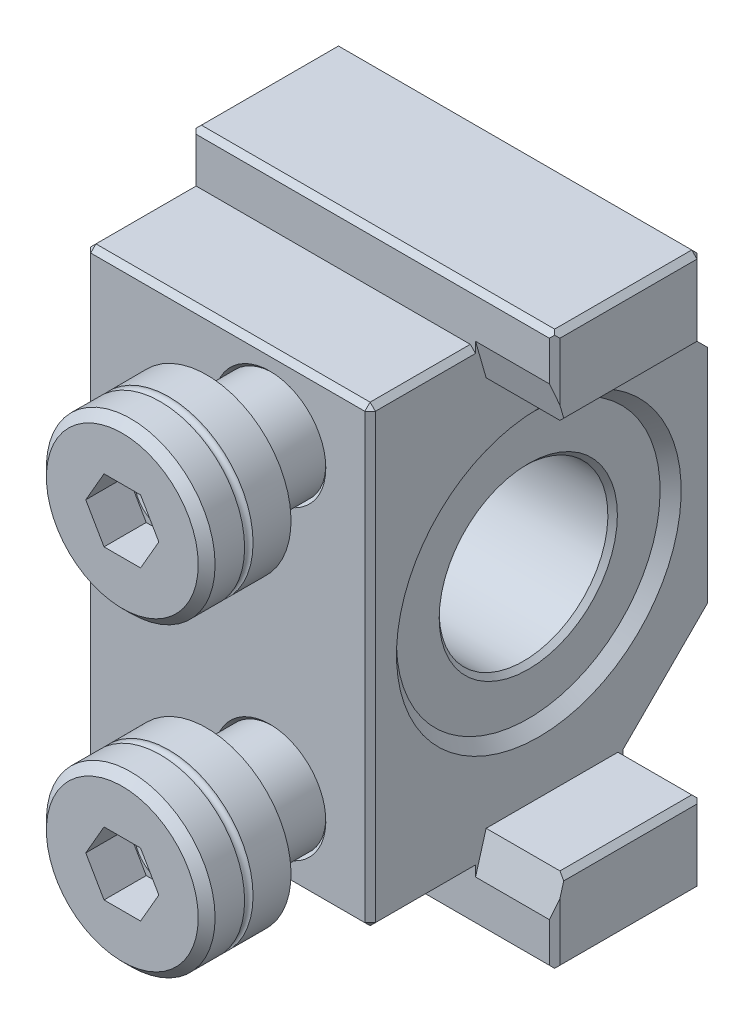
ISO-10303-21;
HEADER;
FILE_DESCRIPTION(('STEP AP214'),'2;1');
FILE_NAME('part.step','',(''),(''),'','','');
FILE_SCHEMA(('AUTOMOTIVE_DESIGN { 1 0 10303 214 1 1 1 1 }'));
ENDSEC;
DATA;
#1=APPLICATION_CONTEXT('core data for automotive mechanical design processes');
#2=APPLICATION_PROTOCOL_DEFINITION('international standard','automotive_design',2000,#1);
#3=PRODUCT_CONTEXT('',#1,'mechanical');
#4=PRODUCT('Part','Part','',(#3));
#5=PRODUCT_RELATED_PRODUCT_CATEGORY('part','',(#4));
#6=PRODUCT_DEFINITION_FORMATION('','',#4);
#7=PRODUCT_DEFINITION_CONTEXT('part definition',#1,'design');
#8=PRODUCT_DEFINITION('design','',#6,#7);
#9=PRODUCT_DEFINITION_SHAPE('','',#8);
#10=(LENGTH_UNIT() NAMED_UNIT(*) SI_UNIT(.MILLI.,.METRE.));
#11=(NAMED_UNIT(*) PLANE_ANGLE_UNIT() SI_UNIT($,.RADIAN.));
#12=(NAMED_UNIT(*) SI_UNIT($,.STERADIAN.) SOLID_ANGLE_UNIT());
#13=UNCERTAINTY_MEASURE_WITH_UNIT(LENGTH_MEASURE(1.E-05),#10,'distance_accuracy_value','');
#14=(GEOMETRIC_REPRESENTATION_CONTEXT(3) GLOBAL_UNCERTAINTY_ASSIGNED_CONTEXT((#13)) GLOBAL_UNIT_ASSIGNED_CONTEXT((#10,
#11,#12)) REPRESENTATION_CONTEXT('',''));
#15=CARTESIAN_POINT('',(0.,0.,0.));
#16=DIRECTION('',(0.,0.,1.));
#17=DIRECTION('',(1.,0.,0.));
#18=AXIS2_PLACEMENT_3D('',#15,#16,#17);
#19=CARTESIAN_POINT('',(17.5,-14.5,15.7));
#20=DIRECTION('',(0.,0.,1.));
#21=DIRECTION('',(0.,-1.,0.));
#22=AXIS2_PLACEMENT_3D('',#19,#20,#21);
#23=CONICAL_SURFACE('',#22,5.,0.785398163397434);
#24=CARTESIAN_POINT('',(17.5,-14.5,16.));
#25=DIRECTION('',(0.,0.,-1.));
#26=DIRECTION('',(0.,1.,0.));
#27=AXIS2_PLACEMENT_3D('',#24,#25,#26);
#28=CIRCLE('',#27,5.3);
#29=CARTESIAN_POINT('',(17.5,-9.2,16.));
#30=VERTEX_POINT('',#29);
#31=EDGE_CURVE('E789',#30,#30,#28,.T.);
#32=ORIENTED_EDGE('',*,*,#31,.F.);
#33=EDGE_LOOP('',(#32));
#34=FACE_BOUND('',#33,.T.);
#35=CARTESIAN_POINT('',(17.5,-14.5,15.7));
#36=DIRECTION('',(0.,0.,-1.));
#37=DIRECTION('',(0.,1.,0.));
#38=AXIS2_PLACEMENT_3D('',#35,#36,#37);
#39=CIRCLE('',#38,5.);
#40=CARTESIAN_POINT('',(17.5,-9.5,15.7));
#41=VERTEX_POINT('',#40);
#42=EDGE_CURVE('E796',#41,#41,#39,.F.);
#43=ORIENTED_EDGE('',*,*,#42,.F.);
#44=EDGE_LOOP('',(#43));
#45=FACE_BOUND('',#44,.T.);
#46=ADVANCED_FACE('F15',(#34,#45),#23,.F.);
#47=CARTESIAN_POINT('',(27.,-21.5,16.));
#48=DIRECTION('',(0.,0.,-1.));
#49=DIRECTION('',(0.,1.,0.));
#50=AXIS2_PLACEMENT_3D('',#47,#48,#49);
#51=PLANE('',#50);
#52=DIRECTION('',(1.,0.,0.));
#53=VECTOR('',#52,1.);
#54=CARTESIAN_POINT('',(27.,-21.,16.));
#55=LINE('',#54,#53);
#56=CARTESIAN_POINT('',(0.5,-21.,16.));
#57=VERTEX_POINT('',#56);
#58=CARTESIAN_POINT('',(26.5,-21.,16.));
#59=VERTEX_POINT('',#58);
#60=EDGE_CURVE('E433',#57,#59,#55,.T.);
#61=ORIENTED_EDGE('',*,*,#60,.T.);
#62=DIRECTION('',(0.,1.,0.));
#63=VECTOR('',#62,1.);
#64=CARTESIAN_POINT('',(26.5,21.5,16.));
#65=LINE('',#64,#63);
#66=CARTESIAN_POINT('',(26.5,21.,16.));
#67=VERTEX_POINT('',#66);
#68=EDGE_CURVE('E437',#59,#67,#65,.T.);
#69=ORIENTED_EDGE('',*,*,#68,.T.);
#70=DIRECTION('',(-1.,0.,0.));
#71=VECTOR('',#70,1.);
#72=CARTESIAN_POINT('',(27.,21.,16.));
#73=LINE('',#72,#71);
#74=CARTESIAN_POINT('',(0.5,21.,16.));
#75=VERTEX_POINT('',#74);
#76=EDGE_CURVE('E435',#67,#75,#73,.T.);
#77=ORIENTED_EDGE('',*,*,#76,.T.);
#78=DIRECTION('',(0.,-1.,0.));
#79=VECTOR('',#78,1.);
#80=CARTESIAN_POINT('',(0.5,-21.5,16.));
#81=LINE('',#80,#79);
#82=EDGE_CURVE('E431',#75,#57,#81,.T.);
#83=ORIENTED_EDGE('',*,*,#82,.T.);
#84=EDGE_LOOP('',(#61,#69,#77,#83));
#85=FACE_BOUND('',#84,.T.);
#86=CARTESIAN_POINT('',(17.5,14.5,16.));
#87=DIRECTION('',(0.,0.,-1.));
#88=DIRECTION('',(0.,1.,0.));
#89=AXIS2_PLACEMENT_3D('',#86,#87,#88);
#90=CIRCLE('',#89,5.3);
#91=CARTESIAN_POINT('',(17.5,19.8,16.));
#92=VERTEX_POINT('',#91);
#93=EDGE_CURVE('E792',#92,#92,#90,.T.);
#94=ORIENTED_EDGE('',*,*,#93,.T.);
#95=EDGE_LOOP('',(#94));
#96=FACE_BOUND('',#95,.T.);
#97=ORIENTED_EDGE('',*,*,#31,.T.);
#98=EDGE_LOOP('',(#97));
#99=FACE_BOUND('',#98,.T.);
#100=ADVANCED_FACE('F916',(#85,#96,#99),#51,.F.);
#101=CARTESIAN_POINT('',(27.,-21.5,15.5));
#102=DIRECTION('',(0.,0.707106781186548,-0.707106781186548));
#103=DIRECTION('',(0.,0.707106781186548,0.707106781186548));
#104=AXIS2_PLACEMENT_3D('',#101,#102,#103);
#105=PLANE('',#104);
#106=DIRECTION('',(0.,0.707106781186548,0.707106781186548));
#107=VECTOR('',#106,1.);
#108=CARTESIAN_POINT('',(26.5,-21.5,15.5));
#109=LINE('',#108,#107);
#110=CARTESIAN_POINT('',(26.5,-21.5,15.5));
#111=VERTEX_POINT('',#110);
#112=EDGE_CURVE('E475',#111,#59,#109,.T.);
#113=ORIENTED_EDGE('',*,*,#112,.T.);
#114=ORIENTED_EDGE('',*,*,#60,.F.);
#115=DIRECTION('',(0.,-0.707106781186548,-0.707106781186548));
#116=VECTOR('',#115,1.);
#117=CARTESIAN_POINT('',(0.5,-21.5,15.5));
#118=LINE('',#117,#116);
#119=CARTESIAN_POINT('',(0.5,-21.5,15.5));
#120=VERTEX_POINT('',#119);
#121=EDGE_CURVE('E469',#120,#57,#118,.F.);
#122=ORIENTED_EDGE('',*,*,#121,.F.);
#123=DIRECTION('',(-1.,0.,0.));
#124=VECTOR('',#123,1.);
#125=CARTESIAN_POINT('',(27.,-21.5,15.5));
#126=LINE('',#125,#124);
#127=EDGE_CURVE('E427',#111,#120,#126,.T.);
#128=ORIENTED_EDGE('',*,*,#127,.F.);
#129=EDGE_LOOP('',(#113,#114,#122,#128));
#130=FACE_BOUND('',#129,.T.);
#131=ADVANCED_FACE('F923',(#130),#105,.F.);
#132=CARTESIAN_POINT('',(27.,21.5,15.5));
#133=DIRECTION('',(0.707106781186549,0.,0.707106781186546));
#134=DIRECTION('',(-0.707106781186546,0.,0.707106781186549));
#135=AXIS2_PLACEMENT_3D('',#132,#133,#134);
#136=PLANE('',#135);
#137=DIRECTION('',(0.707106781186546,0.,-0.707106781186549));
#138=VECTOR('',#137,1.);
#139=CARTESIAN_POINT('',(27.,21.,15.5));
#140=LINE('',#139,#138);
#141=CARTESIAN_POINT('',(27.,21.,15.5));
#142=VERTEX_POINT('',#141);
#143=EDGE_CURVE('E493',#142,#67,#140,.F.);
#144=ORIENTED_EDGE('',*,*,#143,.T.);
#145=ORIENTED_EDGE('',*,*,#68,.F.);
#146=DIRECTION('',(-0.707106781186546,0.,0.707106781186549));
#147=VECTOR('',#146,1.);
#148=CARTESIAN_POINT('',(26.75,-21.,15.75));
#149=LINE('',#148,#147);
#150=CARTESIAN_POINT('',(27.,-21.,15.5));
#151=VERTEX_POINT('',#150);
#152=EDGE_CURVE('E484',#151,#59,#149,.T.);
#153=ORIENTED_EDGE('',*,*,#152,.F.);
#154=DIRECTION('',(0.,-1.,0.));
#155=VECTOR('',#154,1.);
#156=CARTESIAN_POINT('',(27.,-21.5,15.5));
#157=LINE('',#156,#155);
#158=EDGE_CURVE('E830',#142,#151,#157,.T.);
#159=ORIENTED_EDGE('',*,*,#158,.F.);
#160=EDGE_LOOP('',(#144,#145,#153,#159));
#161=FACE_BOUND('',#160,.T.);
#162=ADVANCED_FACE('F913',(#161),#136,.T.);
#163=CARTESIAN_POINT('',(27.,21.,16.));
#164=DIRECTION('',(0.,-0.707106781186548,-0.707106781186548));
#165=DIRECTION('',(0.,0.707106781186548,-0.707106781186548));
#166=AXIS2_PLACEMENT_3D('',#163,#164,#165);
#167=PLANE('',#166);
#168=DIRECTION('',(0.,0.707106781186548,-0.707106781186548));
#169=VECTOR('',#168,1.);
#170=CARTESIAN_POINT('',(26.5,21.25,15.75));
#171=LINE('',#170,#169);
#172=CARTESIAN_POINT('',(26.5,21.5,15.5));
#173=VERTEX_POINT('',#172);
#174=EDGE_CURVE('E496',#67,#173,#171,.T.);
#175=ORIENTED_EDGE('',*,*,#174,.T.);
#176=DIRECTION('',(1.,0.,0.));
#177=VECTOR('',#176,1.);
#178=CARTESIAN_POINT('',(27.,21.5,15.5));
#179=LINE('',#178,#177);
#180=CARTESIAN_POINT('',(0.5,21.5,15.5));
#181=VERTEX_POINT('',#180);
#182=EDGE_CURVE('E838',#181,#173,#179,.T.);
#183=ORIENTED_EDGE('',*,*,#182,.F.);
#184=DIRECTION('',(0.,-0.707106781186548,0.707106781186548));
#185=VECTOR('',#184,1.);
#186=CARTESIAN_POINT('',(0.5,21.,16.));
#187=LINE('',#186,#185);
#188=EDGE_CURVE('E487',#75,#181,#187,.F.);
#189=ORIENTED_EDGE('',*,*,#188,.F.);
#190=ORIENTED_EDGE('',*,*,#76,.F.);
#191=EDGE_LOOP('',(#175,#183,#189,#190));
#192=FACE_BOUND('',#191,.T.);
#193=ADVANCED_FACE('F906',(#192),#167,.F.);
#194=CARTESIAN_POINT('',(0.5,-21.5,16.));
#195=DIRECTION('',(0.707106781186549,0.,-0.707106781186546));
#196=DIRECTION('',(0.707106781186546,0.,0.707106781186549));
#197=AXIS2_PLACEMENT_3D('',#194,#195,#196);
#198=PLANE('',#197);
#199=DIRECTION('',(-0.707106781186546,0.,-0.707106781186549));
#200=VECTOR('',#199,1.);
#201=CARTESIAN_POINT('',(0.5,21.,16.));
#202=LINE('',#201,#200);
#203=CARTESIAN_POINT('',(0.,21.,15.5));
#204=VERTEX_POINT('',#203);
#205=EDGE_CURVE('E478',#75,#204,#202,.T.);
#206=ORIENTED_EDGE('',*,*,#205,.T.);
#207=DIRECTION('',(0.,1.,0.));
#208=VECTOR('',#207,1.);
#209=CARTESIAN_POINT('',(0.,21.5,15.5));
#210=LINE('',#209,#208);
#211=CARTESIAN_POINT('',(0.,-21.,15.5));
#212=VERTEX_POINT('',#211);
#213=EDGE_CURVE('E818',#212,#204,#210,.T.);
#214=ORIENTED_EDGE('',*,*,#213,.F.);
#215=DIRECTION('',(0.707106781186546,0.,0.707106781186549));
#216=VECTOR('',#215,1.);
#217=CARTESIAN_POINT('',(0.25,-21.,15.75));
#218=LINE('',#217,#216);
#219=EDGE_CURVE('E472',#57,#212,#218,.F.);
#220=ORIENTED_EDGE('',*,*,#219,.F.);
#221=ORIENTED_EDGE('',*,*,#82,.F.);
#222=EDGE_LOOP('',(#206,#214,#220,#221));
#223=FACE_BOUND('',#222,.T.);
#224=ADVANCED_FACE('F929',(#223),#198,.F.);
#225=CARTESIAN_POINT('',(17.5,14.5,15.7));
#226=DIRECTION('',(0.,0.,1.));
#227=DIRECTION('',(0.,-1.,0.));
#228=AXIS2_PLACEMENT_3D('',#225,#226,#227);
#229=CONICAL_SURFACE('',#228,5.,0.785398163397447);
#230=ORIENTED_EDGE('',*,*,#93,.F.);
#231=EDGE_LOOP('',(#230));
#232=FACE_BOUND('',#231,.T.);
#233=CARTESIAN_POINT('',(17.5,14.5,15.7));
#234=DIRECTION('',(0.,0.,1.));
#235=DIRECTION('',(0.,-1.,0.));
#236=AXIS2_PLACEMENT_3D('',#233,#234,#235);
#237=CIRCLE('',#236,5.);
#238=CARTESIAN_POINT('',(17.5,9.5,15.7));
#239=VERTEX_POINT('',#238);
#240=EDGE_CURVE('E1214',#239,#239,#237,.F.);
#241=ORIENTED_EDGE('',*,*,#240,.T.);
#242=EDGE_LOOP('',(#241));
#243=FACE_BOUND('',#242,.T.);
#244=ADVANCED_FACE('F1369',(#232,#243),#229,.F.);
#245=CARTESIAN_POINT('',(26.5,-21.5,15.5));
#246=DIRECTION('',(0.577350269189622,-0.577350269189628,0.577350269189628));
#247=DIRECTION('',(0.,-0.707106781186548,-0.707106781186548));
#248=AXIS2_PLACEMENT_3D('',#245,#246,#247);
#249=PLANE('',#248);
#250=DIRECTION('',(0.707106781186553,0.707106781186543,0.));
#251=VECTOR('',#250,1.);
#252=CARTESIAN_POINT('',(26.5,-21.5,15.5));
#253=LINE('',#252,#251);
#254=EDGE_CURVE('E481',#111,#151,#253,.T.);
#255=ORIENTED_EDGE('',*,*,#254,.T.);
#256=ORIENTED_EDGE('',*,*,#152,.T.);
#257=ORIENTED_EDGE('',*,*,#112,.F.);
#258=EDGE_LOOP('',(#255,#256,#257));
#259=FACE_BOUND('',#258,.T.);
#260=ADVANCED_FACE('F1372',(#259),#249,.T.);
#261=CARTESIAN_POINT('',(0.5,-21.5,15.5));
#262=DIRECTION('',(-0.577350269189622,-0.577350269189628,0.577350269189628));
#263=DIRECTION('',(0.,-0.707106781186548,-0.707106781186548));
#264=AXIS2_PLACEMENT_3D('',#261,#262,#263);
#265=PLANE('',#264);
#266=ORIENTED_EDGE('',*,*,#121,.T.);
#267=ORIENTED_EDGE('',*,*,#219,.T.);
#268=DIRECTION('',(-0.707106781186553,0.707106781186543,0.));
#269=VECTOR('',#268,1.);
#270=CARTESIAN_POINT('',(0.5,-21.5,15.5));
#271=LINE('',#270,#269);
#272=EDGE_CURVE('E466',#120,#212,#271,.T.);
#273=ORIENTED_EDGE('',*,*,#272,.F.);
#274=EDGE_LOOP('',(#266,#267,#273));
#275=FACE_BOUND('',#274,.T.);
#276=ADVANCED_FACE('F931',(#275),#265,.T.);
#277=CARTESIAN_POINT('',(27.,-21.5,16.));
#278=DIRECTION('',(0.,1.,0.));
#279=DIRECTION('',(0.,0.,1.));
#280=AXIS2_PLACEMENT_3D('',#277,#278,#279);
#281=PLANE('',#280);
#282=DIRECTION('',(-1.,0.,0.));
#283=VECTOR('',#282,1.);
#284=CARTESIAN_POINT('',(27.,-21.5,6.));
#285=LINE('',#284,#283);
#286=CARTESIAN_POINT('',(26.5,-21.5,6.));
#287=VERTEX_POINT('',#286);
#288=CARTESIAN_POINT('',(0.5,-21.5,6.));
#289=VERTEX_POINT('',#288);
#290=EDGE_CURVE('E413',#287,#289,#285,.T.);
#291=ORIENTED_EDGE('',*,*,#290,.F.);
#292=DIRECTION('',(0.,0.,1.));
#293=VECTOR('',#292,1.);
#294=CARTESIAN_POINT('',(26.5,-21.5,16.));
#295=LINE('',#294,#293);
#296=EDGE_CURVE('E429',#287,#111,#295,.T.);
#297=ORIENTED_EDGE('',*,*,#296,.T.);
#298=ORIENTED_EDGE('',*,*,#127,.T.);
#299=DIRECTION('',(0.,0.,-1.));
#300=VECTOR('',#299,1.);
#301=CARTESIAN_POINT('',(0.5,-21.5,16.));
#302=LINE('',#301,#300);
#303=EDGE_CURVE('E425',#120,#289,#302,.T.);
#304=ORIENTED_EDGE('',*,*,#303,.T.);
#305=EDGE_LOOP('',(#291,#297,#298,#304));
#306=FACE_BOUND('',#305,.T.);
#307=ADVANCED_FACE('F939',(#306),#281,.F.);
#308=CARTESIAN_POINT('',(27.,21.,15.5));
#309=DIRECTION('',(0.577350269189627,0.577350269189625,0.577350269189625));
#310=DIRECTION('',(-0.707106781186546,0.707106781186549,0.));
#311=AXIS2_PLACEMENT_3D('',#308,#309,#310);
#312=PLANE('',#311);
#313=ORIENTED_EDGE('',*,*,#143,.F.);
#314=DIRECTION('',(-0.707106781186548,0.707106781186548,0.));
#315=VECTOR('',#314,1.);
#316=CARTESIAN_POINT('',(27.,21.,15.5));
#317=LINE('',#316,#315);
#318=EDGE_CURVE('E502',#142,#173,#317,.T.);
#319=ORIENTED_EDGE('',*,*,#318,.T.);
#320=ORIENTED_EDGE('',*,*,#174,.F.);
#321=EDGE_LOOP('',(#313,#319,#320));
#322=FACE_BOUND('',#321,.T.);
#323=ADVANCED_FACE('F910',(#322),#312,.T.);
#324=CARTESIAN_POINT('',(27.,21.5,-16.));
#325=DIRECTION('',(1.,0.,0.));
#326=DIRECTION('',(0.,1.,0.));
#327=AXIS2_PLACEMENT_3D('',#324,#325,#326);
#328=PLANE('',#327);
#329=DIRECTION('',(0.,0.,-1.));
#330=VECTOR('',#329,1.);
#331=CARTESIAN_POINT('',(27.,-21.,6.));
#332=LINE('',#331,#330);
#333=CARTESIAN_POINT('',(27.,-21.,6.));
#334=VERTEX_POINT('',#333);
#335=EDGE_CURVE('E697',#151,#334,#332,.T.);
#336=ORIENTED_EDGE('',*,*,#335,.T.);
#337=DIRECTION('',(0.,-1.,0.));
#338=VECTOR('',#337,1.);
#339=CARTESIAN_POINT('',(27.,-18.5,6.));
#340=LINE('',#339,#338);
#341=CARTESIAN_POINT('',(27.,-22.,6.));
#342=VERTEX_POINT('',#341);
#343=EDGE_CURVE('E632',#334,#342,#340,.T.);
#344=ORIENTED_EDGE('',*,*,#343,.T.);
#345=DIRECTION('',(0.,0.961261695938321,-0.275637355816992));
#346=VECTOR('',#345,1.);
#347=CARTESIAN_POINT('',(27.,-22.,6.));
#348=LINE('',#347,#346);
#349=CARTESIAN_POINT('',(27.,-18.5,4.9963911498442));
#350=VERTEX_POINT('',#349);
#351=EDGE_CURVE('E634',#342,#350,#348,.T.);
#352=ORIENTED_EDGE('',*,*,#351,.T.);
#353=DIRECTION('',(0.,0.,1.));
#354=VECTOR('',#353,1.);
#355=CARTESIAN_POINT('',(27.,-18.5,6.));
#356=LINE('',#355,#354);
#357=CARTESIAN_POINT('',(27.,-18.5,-7.5));
#358=VERTEX_POINT('',#357);
#359=EDGE_CURVE('E685',#358,#350,#356,.T.);
#360=ORIENTED_EDGE('',*,*,#359,.F.);
#361=DIRECTION('',(0.,0.707106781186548,0.707106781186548));
#362=VECTOR('',#361,1.);
#363=CARTESIAN_POINT('',(27.,-18.5,-7.5));
#364=LINE('',#363,#362);
#365=CARTESIAN_POINT('',(27.,-19.,-8.));
#366=VERTEX_POINT('',#365);
#367=EDGE_CURVE('E384',#358,#366,#364,.F.);
#368=ORIENTED_EDGE('',*,*,#367,.T.);
#369=DIRECTION('',(0.,-1.,0.));
#370=VECTOR('',#369,1.);
#371=CARTESIAN_POINT('',(27.,21.5,-8.));
#372=LINE('',#371,#370);
#373=CARTESIAN_POINT('',(27.,-18.5,-8.));
#374=VERTEX_POINT('',#373);
#375=EDGE_CURVE('E374',#374,#366,#372,.T.);
#376=ORIENTED_EDGE('',*,*,#375,.F.);
#377=DIRECTION('',(0.,-0.707106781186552,0.707106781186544));
#378=VECTOR('',#377,1.);
#379=CARTESIAN_POINT('',(27.,5.50000000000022,-32.));
#380=LINE('',#379,#378);
#381=CARTESIAN_POINT('',(27.,-10.5,-16.));
#382=VERTEX_POINT('',#381);
#383=EDGE_CURVE('E381',#382,#374,#380,.T.);
#384=ORIENTED_EDGE('',*,*,#383,.F.);
#385=DIRECTION('',(0.,1.,0.));
#386=VECTOR('',#385,1.);
#387=CARTESIAN_POINT('',(27.,-21.5,-16.));
#388=LINE('',#387,#386);
#389=CARTESIAN_POINT('',(27.,10.5,-16.));
#390=VERTEX_POINT('',#389);
#391=EDGE_CURVE('E724',#382,#390,#388,.T.);
#392=ORIENTED_EDGE('',*,*,#391,.T.);
#393=DIRECTION('',(0.,-0.707106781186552,-0.707106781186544));
#394=VECTOR('',#393,1.);
#395=CARTESIAN_POINT('',(27.,16.,-10.5));
#396=LINE('',#395,#394);
#397=CARTESIAN_POINT('',(27.,18.5,-8.));
#398=VERTEX_POINT('',#397);
#399=EDGE_CURVE('E409',#398,#390,#396,.T.);
#400=ORIENTED_EDGE('',*,*,#399,.F.);
#401=DIRECTION('',(0.,-1.,0.));
#402=VECTOR('',#401,1.);
#403=CARTESIAN_POINT('',(27.,21.5,-8.));
#404=LINE('',#403,#402);
#405=CARTESIAN_POINT('',(27.,19.,-8.));
#406=VERTEX_POINT('',#405);
#407=EDGE_CURVE('E552',#406,#398,#404,.T.);
#408=ORIENTED_EDGE('',*,*,#407,.F.);
#409=DIRECTION('',(0.,0.707106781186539,-0.707106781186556));
#410=VECTOR('',#409,1.);
#411=CARTESIAN_POINT('',(27.,19.,-8.));
#412=LINE('',#411,#410);
#413=CARTESIAN_POINT('',(27.,18.5,-7.5));
#414=VERTEX_POINT('',#413);
#415=EDGE_CURVE('E594',#406,#414,#412,.F.);
#416=ORIENTED_EDGE('',*,*,#415,.T.);
#417=DIRECTION('',(0.,0.,-1.));
#418=VECTOR('',#417,1.);
#419=CARTESIAN_POINT('',(27.,18.5,6.));
#420=LINE('',#419,#418);
#421=CARTESIAN_POINT('',(27.,18.5,4.9963911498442));
#422=VERTEX_POINT('',#421);
#423=EDGE_CURVE('E682',#422,#414,#420,.T.);
#424=ORIENTED_EDGE('',*,*,#423,.F.);
#425=DIRECTION('',(0.,0.961261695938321,0.275637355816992));
#426=VECTOR('',#425,1.);
#427=CARTESIAN_POINT('',(27.,22.,6.));
#428=LINE('',#427,#426);
#429=CARTESIAN_POINT('',(27.,22.,6.));
#430=VERTEX_POINT('',#429);
#431=EDGE_CURVE('E648',#422,#430,#428,.T.);
#432=ORIENTED_EDGE('',*,*,#431,.T.);
#433=DIRECTION('',(0.,-1.,0.));
#434=VECTOR('',#433,1.);
#435=CARTESIAN_POINT('',(27.,18.5,6.));
#436=LINE('',#435,#434);
#437=CARTESIAN_POINT('',(27.,21.,6.));
#438=VERTEX_POINT('',#437);
#439=EDGE_CURVE('E646',#430,#438,#436,.T.);
#440=ORIENTED_EDGE('',*,*,#439,.T.);
#441=DIRECTION('',(0.,0.,1.));
#442=VECTOR('',#441,1.);
#443=CARTESIAN_POINT('',(27.,21.,16.));
#444=LINE('',#443,#442);
#445=EDGE_CURVE('E833',#438,#142,#444,.T.);
#446=ORIENTED_EDGE('',*,*,#445,.T.);
#447=ORIENTED_EDGE('',*,*,#158,.T.);
#448=EDGE_LOOP('',(#336,#344,#352,#360,#368,#376,#384,#392,#400,#408,#416,#424,#432,#440,#446,#447));
#449=FACE_BOUND('',#448,.T.);
#450=CARTESIAN_POINT('',(27.,0.,0.));
#451=DIRECTION('',(1.,0.,0.));
#452=DIRECTION('',(0.,1.,0.));
#453=AXIS2_PLACEMENT_3D('',#450,#451,#452);
#454=CIRCLE('',#453,13.5);
#455=CARTESIAN_POINT('',(27.,13.5,0.));
#456=VERTEX_POINT('',#455);
#457=EDGE_CURVE('E795',#456,#456,#454,.F.);
#458=ORIENTED_EDGE('',*,*,#457,.T.);
#459=EDGE_LOOP('',(#458));
#460=FACE_BOUND('',#459,.T.);
#461=ADVANCED_FACE('F377',(#449,#460),#328,.T.);
#462=CARTESIAN_POINT('',(27.,21.5,16.));
#463=DIRECTION('',(0.,-1.,0.));
#464=DIRECTION('',(0.,0.,-1.));
#465=AXIS2_PLACEMENT_3D('',#462,#463,#464);
#466=PLANE('',#465);
#467=ORIENTED_EDGE('',*,*,#182,.T.);
#468=DIRECTION('',(0.,0.,-1.));
#469=VECTOR('',#468,1.);
#470=CARTESIAN_POINT('',(26.5,21.5,6.));
#471=LINE('',#470,#469);
#472=CARTESIAN_POINT('',(26.5,21.5,6.));
#473=VERTEX_POINT('',#472);
#474=EDGE_CURVE('E423',#173,#473,#471,.T.);
#475=ORIENTED_EDGE('',*,*,#474,.T.);
#476=DIRECTION('',(-1.,0.,0.));
#477=VECTOR('',#476,1.);
#478=CARTESIAN_POINT('',(27.,21.5,6.));
#479=LINE('',#478,#477);
#480=CARTESIAN_POINT('',(0.5,21.5,6.));
#481=VERTEX_POINT('',#480);
#482=EDGE_CURVE('E422',#473,#481,#479,.T.);
#483=ORIENTED_EDGE('',*,*,#482,.T.);
#484=DIRECTION('',(0.,0.,1.));
#485=VECTOR('',#484,1.);
#486=CARTESIAN_POINT('',(0.5,21.5,16.));
#487=LINE('',#486,#485);
#488=EDGE_CURVE('E835',#481,#181,#487,.T.);
#489=ORIENTED_EDGE('',*,*,#488,.T.);
#490=EDGE_LOOP('',(#467,#475,#483,#489));
#491=FACE_BOUND('',#490,.T.);
#492=ADVANCED_FACE('F843',(#491),#466,.F.);
#493=CARTESIAN_POINT('',(0.5,21.,16.));
#494=DIRECTION('',(-0.577350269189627,0.577350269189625,0.577350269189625));
#495=DIRECTION('',(-0.707106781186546,-0.707106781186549,0.));
#496=AXIS2_PLACEMENT_3D('',#493,#494,#495);
#497=PLANE('',#496);
#498=ORIENTED_EDGE('',*,*,#188,.T.);
#499=DIRECTION('',(0.707106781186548,0.707106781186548,0.));
#500=VECTOR('',#499,1.);
#501=CARTESIAN_POINT('',(0.25,21.25,15.5));
#502=LINE('',#501,#500);
#503=EDGE_CURVE('E490',#181,#204,#502,.F.);
#504=ORIENTED_EDGE('',*,*,#503,.T.);
#505=ORIENTED_EDGE('',*,*,#205,.F.);
#506=EDGE_LOOP('',(#498,#504,#505));
#507=FACE_BOUND('',#506,.T.);
#508=ADVANCED_FACE('F1327',(#507),#497,.T.);
#509=CARTESIAN_POINT('',(0.,21.5,-16.));
#510=DIRECTION('',(1.,0.,0.));
#511=DIRECTION('',(0.,1.,0.));
#512=AXIS2_PLACEMENT_3D('',#509,#510,#511);
#513=PLANE('',#512);
#514=CARTESIAN_POINT('',(0.,0.,0.));
#515=DIRECTION('',(1.,0.,0.));
#516=DIRECTION('',(0.,1.,0.));
#517=AXIS2_PLACEMENT_3D('',#514,#515,#516);
#518=CIRCLE('',#517,11.);
#519=CARTESIAN_POINT('',(0.,11.,0.));
#520=VERTEX_POINT('',#519);
#521=EDGE_CURVE('E786',#520,#520,#518,.T.);
#522=ORIENTED_EDGE('',*,*,#521,.T.);
#523=EDGE_LOOP('',(#522));
#524=FACE_BOUND('',#523,.T.);
#525=DIRECTION('',(0.,-0.707106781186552,0.707106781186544));
#526=VECTOR('',#525,1.);
#527=CARTESIAN_POINT('',(0.,5.85355339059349,-31.6464466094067));
#528=LINE('',#527,#526);
#529=CARTESIAN_POINT('',(0.,-10.2928932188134,-15.5));
#530=VERTEX_POINT('',#529);
#531=CARTESIAN_POINT('',(0.,-18.2928932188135,-7.5));
#532=VERTEX_POINT('',#531);
#533=EDGE_CURVE('E577',#530,#532,#528,.T.);
#534=ORIENTED_EDGE('',*,*,#533,.T.);
#535=DIRECTION('',(0.,-1.,0.));
#536=VECTOR('',#535,1.);
#537=CARTESIAN_POINT('',(0.,21.5,-7.5));
#538=LINE('',#537,#536);
#539=CARTESIAN_POINT('',(0.,-25.75,-7.5));
#540=VERTEX_POINT('',#539);
#541=EDGE_CURVE('E579',#532,#540,#538,.T.);
#542=ORIENTED_EDGE('',*,*,#541,.T.);
#543=DIRECTION('',(0.,0.,1.));
#544=VECTOR('',#543,1.);
#545=CARTESIAN_POINT('',(0.,-25.75,-16.));
#546=LINE('',#545,#544);
#547=CARTESIAN_POINT('',(0.,-25.75,5.5));
#548=VERTEX_POINT('',#547);
#549=EDGE_CURVE('E824',#540,#548,#546,.T.);
#550=ORIENTED_EDGE('',*,*,#549,.T.);
#551=DIRECTION('',(0.,1.,0.));
#552=VECTOR('',#551,1.);
#553=CARTESIAN_POINT('',(0.,21.5,5.5));
#554=LINE('',#553,#552);
#555=CARTESIAN_POINT('',(0.,-21.,5.5));
#556=VERTEX_POINT('',#555);
#557=EDGE_CURVE('E822',#548,#556,#554,.T.);
#558=ORIENTED_EDGE('',*,*,#557,.T.);
#559=DIRECTION('',(0.,0.,1.));
#560=VECTOR('',#559,1.);
#561=CARTESIAN_POINT('',(0.,-21.,-16.));
#562=LINE('',#561,#560);
#563=EDGE_CURVE('E820',#556,#212,#562,.T.);
#564=ORIENTED_EDGE('',*,*,#563,.T.);
#565=ORIENTED_EDGE('',*,*,#213,.T.);
#566=DIRECTION('',(0.,0.,-1.));
#567=VECTOR('',#566,1.);
#568=CARTESIAN_POINT('',(0.,21.,-16.));
#569=LINE('',#568,#567);
#570=CARTESIAN_POINT('',(0.,21.,5.5));
#571=VERTEX_POINT('',#570);
#572=EDGE_CURVE('E816',#204,#571,#569,.T.);
#573=ORIENTED_EDGE('',*,*,#572,.T.);
#574=DIRECTION('',(0.,1.,0.));
#575=VECTOR('',#574,1.);
#576=CARTESIAN_POINT('',(0.,21.5,5.5));
#577=LINE('',#576,#575);
#578=CARTESIAN_POINT('',(0.,25.75,5.5));
#579=VERTEX_POINT('',#578);
#580=EDGE_CURVE('E814',#571,#579,#577,.T.);
#581=ORIENTED_EDGE('',*,*,#580,.T.);
#582=DIRECTION('',(0.,0.,-1.));
#583=VECTOR('',#582,1.);
#584=CARTESIAN_POINT('',(0.,25.75,-16.));
#585=LINE('',#584,#583);
#586=CARTESIAN_POINT('',(0.,25.75,-7.5));
#587=VERTEX_POINT('',#586);
#588=EDGE_CURVE('E811',#579,#587,#585,.T.);
#589=ORIENTED_EDGE('',*,*,#588,.T.);
#590=DIRECTION('',(0.,-1.,0.));
#591=VECTOR('',#590,1.);
#592=CARTESIAN_POINT('',(0.,21.5,-7.5));
#593=LINE('',#592,#591);
#594=CARTESIAN_POINT('',(0.,18.2928932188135,-7.5));
#595=VERTEX_POINT('',#594);
#596=EDGE_CURVE('E571',#587,#595,#593,.T.);
#597=ORIENTED_EDGE('',*,*,#596,.T.);
#598=DIRECTION('',(0.,-0.707106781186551,-0.707106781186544));
#599=VECTOR('',#598,1.);
#600=CARTESIAN_POINT('',(0.,15.6464466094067,-10.1464466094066));
#601=LINE('',#600,#599);
#602=CARTESIAN_POINT('',(0.,10.2928932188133,-15.5));
#603=VERTEX_POINT('',#602);
#604=EDGE_CURVE('E573',#595,#603,#601,.T.);
#605=ORIENTED_EDGE('',*,*,#604,.T.);
#606=DIRECTION('',(0.,-1.,0.));
#607=VECTOR('',#606,1.);
#608=CARTESIAN_POINT('',(0.,21.5,-15.5));
#609=LINE('',#608,#607);
#610=EDGE_CURVE('E575',#603,#530,#609,.T.);
#611=ORIENTED_EDGE('',*,*,#610,.T.);
#612=EDGE_LOOP('',(#534,#542,#550,#558,#564,#565,#573,#581,#589,#597,#605,#611));
#613=FACE_BOUND('',#612,.T.);
#614=ADVANCED_FACE('F892',(#524,#613),#513,.F.);
#615=CARTESIAN_POINT('',(17.5,14.5,0.));
#616=DIRECTION('',(0.,0.,1.));
#617=DIRECTION('',(0.,-1.,0.));
#618=AXIS2_PLACEMENT_3D('',#615,#616,#617);
#619=CYLINDRICAL_SURFACE('',#618,5.);
#620=ORIENTED_EDGE('',*,*,#240,.F.);
#621=EDGE_LOOP('',(#620));
#622=FACE_BOUND('',#621,.T.);
#623=CARTESIAN_POINT('',(17.5,14.5,21.36));
#624=DIRECTION('',(0.,0.,1.));
#625=DIRECTION('',(0.,-1.,0.));
#626=AXIS2_PLACEMENT_3D('',#623,#624,#625);
#627=CIRCLE('',#626,5.);
#628=CARTESIAN_POINT('',(17.5,9.5,21.36));
#629=VERTEX_POINT('',#628);
#630=EDGE_CURVE('E1198',#629,#629,#627,.F.);
#631=ORIENTED_EDGE('',*,*,#630,.T.);
#632=EDGE_LOOP('',(#631));
#633=FACE_BOUND('',#632,.T.);
#634=ADVANCED_FACE('F1055',(#622,#633),#619,.T.);
#635=CARTESIAN_POINT('',(27.,-21.,-16.));
#636=DIRECTION('',(0.707106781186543,-0.707106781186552,0.));
#637=DIRECTION('',(0.707106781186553,0.707106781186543,0.));
#638=AXIS2_PLACEMENT_3D('',#635,#636,#637);
#639=PLANE('',#638);
#640=DIRECTION('',(-0.707106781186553,-0.707106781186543,0.));
#641=VECTOR('',#640,1.);
#642=CARTESIAN_POINT('',(24.375,-23.625,6.));
#643=LINE('',#642,#641);
#644=EDGE_CURVE('E456',#334,#287,#643,.T.);
#645=ORIENTED_EDGE('',*,*,#644,.F.);
#646=ORIENTED_EDGE('',*,*,#335,.F.);
#647=ORIENTED_EDGE('',*,*,#254,.F.);
#648=ORIENTED_EDGE('',*,*,#296,.F.);
#649=EDGE_LOOP('',(#645,#646,#647,#648));
#650=FACE_BOUND('',#649,.T.);
#651=ADVANCED_FACE('F1058',(#650),#639,.T.);
#652=CARTESIAN_POINT('',(0.5,-21.5,16.));
#653=DIRECTION('',(0.707106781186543,0.707106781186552,0.));
#654=DIRECTION('',(-0.707106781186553,0.707106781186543,0.));
#655=AXIS2_PLACEMENT_3D('',#652,#653,#654);
#656=PLANE('',#655);
#657=ORIENTED_EDGE('',*,*,#272,.T.);
#658=ORIENTED_EDGE('',*,*,#563,.F.);
#659=DIRECTION('',(0.577350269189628,-0.57735026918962,0.577350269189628));
#660=VECTOR('',#659,1.);
#661=CARTESIAN_POINT('',(2.08333333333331,-23.0833333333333,7.58333333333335));
#662=LINE('',#661,#660);
#663=EDGE_CURVE('E462',#289,#556,#662,.F.);
#664=ORIENTED_EDGE('',*,*,#663,.F.);
#665=ORIENTED_EDGE('',*,*,#303,.F.);
#666=EDGE_LOOP('',(#657,#658,#664,#665));
#667=FACE_BOUND('',#666,.T.);
#668=ADVANCED_FACE('F936',(#667),#656,.F.);
#669=CARTESIAN_POINT('',(27.,-26.25,6.));
#670=DIRECTION('',(0.,0.,-1.));
#671=DIRECTION('',(0.,1.,0.));
#672=AXIS2_PLACEMENT_3D('',#669,#670,#671);
#673=PLANE('',#672);
#674=DIRECTION('',(1.,0.,0.));
#675=VECTOR('',#674,1.);
#676=CARTESIAN_POINT('',(27.,-25.75,6.));
#677=LINE('',#676,#675);
#678=CARTESIAN_POINT('',(0.5,-25.75,6.));
#679=VERTEX_POINT('',#678);
#680=CARTESIAN_POINT('',(34.,-25.75,6.));
#681=VERTEX_POINT('',#680);
#682=EDGE_CURVE('E740',#679,#681,#677,.T.);
#683=ORIENTED_EDGE('',*,*,#682,.T.);
#684=DIRECTION('',(0.,1.,0.));
#685=VECTOR('',#684,1.);
#686=CARTESIAN_POINT('',(34.,-26.25,6.));
#687=LINE('',#686,#685);
#688=CARTESIAN_POINT('',(34.,-22.,6.));
#689=VERTEX_POINT('',#688);
#690=EDGE_CURVE('E548',#681,#689,#687,.T.);
#691=ORIENTED_EDGE('',*,*,#690,.T.);
#692=DIRECTION('',(1.,0.,0.));
#693=VECTOR('',#692,1.);
#694=CARTESIAN_POINT('',(27.,-22.,6.));
#695=LINE('',#694,#693);
#696=EDGE_CURVE('E637',#342,#689,#695,.T.);
#697=ORIENTED_EDGE('',*,*,#696,.F.);
#698=ORIENTED_EDGE('',*,*,#343,.F.);
#699=ORIENTED_EDGE('',*,*,#644,.T.);
#700=ORIENTED_EDGE('',*,*,#290,.T.);
#701=DIRECTION('',(0.,-1.,0.));
#702=VECTOR('',#701,1.);
#703=CARTESIAN_POINT('',(0.5,-26.25,6.));
#704=LINE('',#703,#702);
#705=EDGE_CURVE('E440',#289,#679,#704,.T.);
#706=ORIENTED_EDGE('',*,*,#705,.T.);
#707=EDGE_LOOP('',(#683,#691,#697,#698,#699,#700,#706));
#708=FACE_BOUND('',#707,.T.);
#709=ADVANCED_FACE('F701',(#708),#673,.F.);
#710=CARTESIAN_POINT('',(27.,21.,-16.));
#711=DIRECTION('',(0.707106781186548,0.707106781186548,0.));
#712=DIRECTION('',(-0.707106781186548,0.707106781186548,0.));
#713=AXIS2_PLACEMENT_3D('',#710,#711,#712);
#714=PLANE('',#713);
#715=DIRECTION('',(0.707106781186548,-0.707106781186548,0.));
#716=VECTOR('',#715,1.);
#717=CARTESIAN_POINT('',(24.375,23.625,6.));
#718=LINE('',#717,#716);
#719=EDGE_CURVE('E453',#473,#438,#718,.T.);
#720=ORIENTED_EDGE('',*,*,#719,.F.);
#721=ORIENTED_EDGE('',*,*,#474,.F.);
#722=ORIENTED_EDGE('',*,*,#318,.F.);
#723=ORIENTED_EDGE('',*,*,#445,.F.);
#724=EDGE_LOOP('',(#720,#721,#722,#723));
#725=FACE_BOUND('',#724,.T.);
#726=ADVANCED_FACE('F853',(#725),#714,.T.);
#727=CARTESIAN_POINT('',(27.,-22.,6.));
#728=DIRECTION('',(0.,-0.275637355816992,-0.961261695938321));
#729=DIRECTION('',(0.,0.961261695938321,-0.275637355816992));
#730=AXIS2_PLACEMENT_3D('',#727,#728,#729);
#731=PLANE('',#730);
#732=DIRECTION('',(0.,0.961261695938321,-0.275637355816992));
#733=VECTOR('',#732,1.);
#734=CARTESIAN_POINT('',(34.5,-22.,6.));
#735=LINE('',#734,#733);
#736=CARTESIAN_POINT('',(34.5,-20.2562927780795,5.5));
#737=VERTEX_POINT('',#736);
#738=CARTESIAN_POINT('',(34.5,-19.,5.1397638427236));
#739=VERTEX_POINT('',#738);
#740=EDGE_CURVE('E610',#737,#739,#735,.T.);
#741=ORIENTED_EDGE('',*,*,#740,.T.);
#742=DIRECTION('',(0.693005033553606,-0.693005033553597,0.198715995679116));
#743=VECTOR('',#742,1.);
#744=CARTESIAN_POINT('',(34.6184641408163,-19.1184641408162,5.17373288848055));
#745=LINE('',#744,#743);
#746=CARTESIAN_POINT('',(34.,-18.5,4.9963911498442));
#747=VERTEX_POINT('',#746);
#748=EDGE_CURVE('E537',#739,#747,#745,.F.);
#749=ORIENTED_EDGE('',*,*,#748,.T.);
#750=DIRECTION('',(1.,0.,0.));
#751=VECTOR('',#750,1.);
#752=CARTESIAN_POINT('',(27.,-18.5,4.9963911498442));
#753=LINE('',#752,#751);
#754=EDGE_CURVE('E640',#350,#747,#753,.T.);
#755=ORIENTED_EDGE('',*,*,#754,.F.);
#756=ORIENTED_EDGE('',*,*,#351,.F.);
#757=ORIENTED_EDGE('',*,*,#696,.T.);
#758=DIRECTION('',(-0.265727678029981,-0.926702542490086,0.265727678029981));
#759=VECTOR('',#758,1.);
#760=CARTESIAN_POINT('',(33.0240465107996,-25.4035542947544,6.97595348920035));
#761=LINE('',#760,#759);
#762=EDGE_CURVE('E535',#689,#737,#761,.F.);
#763=ORIENTED_EDGE('',*,*,#762,.T.);
#764=EDGE_LOOP('',(#741,#749,#755,#756,#757,#763));
#765=FACE_BOUND('',#764,.T.);
#766=ADVANCED_FACE('F694',(#765),#731,.F.);
#767=CARTESIAN_POINT('',(34.5,-18.5,6.));
#768=DIRECTION('',(0.,-1.,0.));
#769=DIRECTION('',(0.,0.,-1.));
#770=AXIS2_PLACEMENT_3D('',#767,#768,#769);
#771=PLANE('',#770);
#772=DIRECTION('',(0.,0.,-1.));
#773=VECTOR('',#772,1.);
#774=CARTESIAN_POINT('',(34.,-18.5,6.));
#775=LINE('',#774,#773);
#776=CARTESIAN_POINT('',(34.,-18.5,-7.5));
#777=VERTEX_POINT('',#776);
#778=EDGE_CURVE('E539',#747,#777,#775,.T.);
#779=ORIENTED_EDGE('',*,*,#778,.T.);
#780=DIRECTION('',(-1.,0.,0.));
#781=VECTOR('',#780,1.);
#782=CARTESIAN_POINT('',(34.5,-18.5,-7.5));
#783=LINE('',#782,#781);
#784=EDGE_CURVE('E563',#777,#358,#783,.T.);
#785=ORIENTED_EDGE('',*,*,#784,.T.);
#786=ORIENTED_EDGE('',*,*,#359,.T.);
#787=ORIENTED_EDGE('',*,*,#754,.T.);
#788=EDGE_LOOP('',(#779,#785,#786,#787));
#789=FACE_BOUND('',#788,.T.);
#790=ADVANCED_FACE('F689',(#789),#771,.F.);
#791=CARTESIAN_POINT('',(34.5,-18.5,-7.5));
#792=DIRECTION('',(0.,-0.707106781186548,0.707106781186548));
#793=DIRECTION('',(0.,-0.707106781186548,-0.707106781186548));
#794=AXIS2_PLACEMENT_3D('',#791,#792,#793);
#795=PLANE('',#794);
#796=DIRECTION('',(0.577350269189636,0.57735026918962,0.577350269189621));
#797=VECTOR('',#796,1.);
#798=CARTESIAN_POINT('',(31.9166666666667,-21.0833333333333,-10.0833333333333));
#799=LINE('',#798,#797);
#800=CARTESIAN_POINT('',(34.,-19.,-8.));
#801=VERTEX_POINT('',#800);
#802=CARTESIAN_POINT('',(34.25,-18.75,-7.75));
#803=VERTEX_POINT('',#802);
#804=EDGE_CURVE('E387',#801,#803,#799,.T.);
#805=ORIENTED_EDGE('',*,*,#804,.F.);
#806=DIRECTION('',(1.,0.,0.));
#807=VECTOR('',#806,1.);
#808=CARTESIAN_POINT('',(27.,-19.,-8.));
#809=LINE('',#808,#807);
#810=EDGE_CURVE('E388',#366,#801,#809,.T.);
#811=ORIENTED_EDGE('',*,*,#810,.F.);
#812=ORIENTED_EDGE('',*,*,#367,.F.);
#813=ORIENTED_EDGE('',*,*,#784,.F.);
#814=DIRECTION('',(-0.577350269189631,0.577350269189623,0.577350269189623));
#815=VECTOR('',#814,1.);
#816=CARTESIAN_POINT('',(29.8333333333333,-14.3333333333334,-3.33333333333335));
#817=LINE('',#816,#815);
#818=EDGE_CURVE('E569',#803,#777,#817,.T.);
#819=ORIENTED_EDGE('',*,*,#818,.F.);
#820=EDGE_LOOP('',(#805,#811,#812,#813,#819));
#821=FACE_BOUND('',#820,.T.);
#822=ADVANCED_FACE('F975',(#821),#795,.F.);
#823=CARTESIAN_POINT('',(27.,-26.25,-8.));
#824=DIRECTION('',(0.,0.,1.));
#825=DIRECTION('',(0.,-1.,0.));
#826=AXIS2_PLACEMENT_3D('',#823,#824,#825);
#827=PLANE('',#826);
#828=DIRECTION('',(1.,0.,0.));
#829=VECTOR('',#828,1.);
#830=CARTESIAN_POINT('',(-11.5,-18.5,-8.));
#831=LINE('',#830,#829);
#832=CARTESIAN_POINT('',(0.5,-18.5,-8.));
#833=VERTEX_POINT('',#832);
#834=EDGE_CURVE('E392',#833,#374,#831,.T.);
#835=ORIENTED_EDGE('',*,*,#834,.T.);
#836=ORIENTED_EDGE('',*,*,#375,.T.);
#837=ORIENTED_EDGE('',*,*,#810,.T.);
#838=DIRECTION('',(0.,-1.,0.));
#839=VECTOR('',#838,1.);
#840=CARTESIAN_POINT('',(34.,-26.25,-8.));
#841=LINE('',#840,#839);
#842=CARTESIAN_POINT('',(34.,-25.75,-8.));
#843=VERTEX_POINT('',#842);
#844=EDGE_CURVE('E730',#801,#843,#841,.T.);
#845=ORIENTED_EDGE('',*,*,#844,.T.);
#846=DIRECTION('',(-1.,0.,0.));
#847=VECTOR('',#846,1.);
#848=CARTESIAN_POINT('',(27.,-25.75,-8.));
#849=LINE('',#848,#847);
#850=CARTESIAN_POINT('',(0.5,-25.75,-8.));
#851=VERTEX_POINT('',#850);
#852=EDGE_CURVE('E726',#843,#851,#849,.T.);
#853=ORIENTED_EDGE('',*,*,#852,.T.);
#854=DIRECTION('',(0.,1.,0.));
#855=VECTOR('',#854,1.);
#856=CARTESIAN_POINT('',(0.5,-26.25,-8.));
#857=LINE('',#856,#855);
#858=EDGE_CURVE('E396',#851,#833,#857,.T.);
#859=ORIENTED_EDGE('',*,*,#858,.T.);
#860=EDGE_LOOP('',(#835,#836,#837,#845,#853,#859));
#861=FACE_BOUND('',#860,.T.);
#862=ADVANCED_FACE('F393',(#861),#827,.F.);
#863=CARTESIAN_POINT('',(17.5,-14.5,11.));
#864=DIRECTION('',(0.,0.,1.));
#865=DIRECTION('',(0.,-1.,0.));
#866=AXIS2_PLACEMENT_3D('',#863,#864,#865);
#867=CYLINDRICAL_SURFACE('',#866,3.4);
#868=CARTESIAN_POINT('',(17.5,-14.5,0.1670000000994));
#869=DIRECTION('',(0.,0.,1.));
#870=DIRECTION('',(-1.,0.,0.));
#871=AXIS2_PLACEMENT_3D('',#868,#869,#870);
#872=CIRCLE('',#871,3.4);
#873=CARTESIAN_POINT('',(14.1,-14.5,0.1670000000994));
#874=VERTEX_POINT('',#873);
#875=EDGE_CURVE('E9',#874,#874,#872,.F.);
#876=ORIENTED_EDGE('',*,*,#875,.F.);
#877=EDGE_LOOP('',(#876));
#878=FACE_BOUND('',#877,.T.);
#879=CARTESIAN_POINT('',(17.5,-14.5,-4.5));
#880=DIRECTION('',(0.,0.,1.));
#881=DIRECTION('',(0.,-1.,0.));
#882=AXIS2_PLACEMENT_3D('',#879,#880,#881);
#883=CIRCLE('',#882,3.4);
#884=CARTESIAN_POINT('',(17.5,-17.9,-4.5));
#885=VERTEX_POINT('',#884);
#886=EDGE_CURVE('E669',#885,#885,#883,.T.);
#887=ORIENTED_EDGE('',*,*,#886,.F.);
#888=EDGE_LOOP('',(#887));
#889=FACE_BOUND('',#888,.T.);
#890=ADVANCED_FACE('F1318',(#878,#889),#867,.F.);
#891=CARTESIAN_POINT('',(17.5,-14.5,-4.5));
#892=DIRECTION('',(0.,0.,1.));
#893=DIRECTION('',(0.,-1.,0.));
#894=AXIS2_PLACEMENT_3D('',#891,#892,#893);
#895=CONICAL_SURFACE('',#894,3.4,1.02974425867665);
#896=CARTESIAN_POINT('',(17.5,-14.5,-5.0107315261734));
#897=DIRECTION('',(0.,0.,1.));
#898=DIRECTION('',(0.,-1.,0.));
#899=AXIS2_PLACEMENT_3D('',#896,#897,#898);
#900=CIRCLE('',#899,2.55);
#901=CARTESIAN_POINT('',(17.5,-17.05,-5.0107315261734));
#902=VERTEX_POINT('',#901);
#903=EDGE_CURVE('E614',#902,#902,#900,.F.);
#904=ORIENTED_EDGE('',*,*,#903,.T.);
#905=EDGE_LOOP('',(#904));
#906=FACE_BOUND('',#905,.T.);
#907=ORIENTED_EDGE('',*,*,#886,.T.);
#908=EDGE_LOOP('',(#907));
#909=FACE_BOUND('',#908,.T.);
#910=ADVANCED_FACE('F1284',(#906,#909),#895,.F.);
#911=CARTESIAN_POINT('',(17.5,-14.5,16.));
#912=DIRECTION('',(0.,0.,1.));
#913=DIRECTION('',(0.,-1.,0.));
#914=AXIS2_PLACEMENT_3D('',#911,#912,#913);
#915=CYLINDRICAL_SURFACE('',#914,2.55);
#916=ORIENTED_EDGE('',*,*,#903,.F.);
#917=EDGE_LOOP('',(#916));
#918=FACE_BOUND('',#917,.T.);
#919=CARTESIAN_POINT('',(17.5,-14.5,-12.));
#920=DIRECTION('',(0.,0.707106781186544,0.707106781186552));
#921=DIRECTION('',(0.,-0.707106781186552,0.707106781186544));
#922=AXIS2_PLACEMENT_3D('',#919,#920,#921);
#923=ELLIPSE('',#922,3.60624458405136,2.55);
#924=CARTESIAN_POINT('',(17.5,-17.05,-9.45000000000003));
#925=VERTEX_POINT('',#924);
#926=EDGE_CURVE('E613',#925,#925,#923,.T.);
#927=ORIENTED_EDGE('',*,*,#926,.F.);
#928=EDGE_LOOP('',(#927));
#929=FACE_BOUND('',#928,.T.);
#930=ADVANCED_FACE('F1307',(#918,#929),#915,.F.);
#931=CARTESIAN_POINT('',(-11.5,-18.5,-8.));
#932=DIRECTION('',(0.,0.707106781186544,0.707106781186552));
#933=DIRECTION('',(0.,-0.707106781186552,0.707106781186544));
#934=AXIS2_PLACEMENT_3D('',#931,#932,#933);
#935=PLANE('',#934);
#936=ORIENTED_EDGE('',*,*,#926,.T.);
#937=EDGE_LOOP('',(#936));
#938=FACE_BOUND('',#937,.T.);
#939=ORIENTED_EDGE('',*,*,#834,.F.);
#940=DIRECTION('',(0.,0.707106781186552,-0.707106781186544));
#941=VECTOR('',#940,1.);
#942=CARTESIAN_POINT('',(0.5,-18.5,-8.));
#943=LINE('',#942,#941);
#944=CARTESIAN_POINT('',(0.5,-10.5,-16.));
#945=VERTEX_POINT('',#944);
#946=EDGE_CURVE('E585',#833,#945,#943,.T.);
#947=ORIENTED_EDGE('',*,*,#946,.T.);
#948=DIRECTION('',(1.,0.,0.));
#949=VECTOR('',#948,1.);
#950=CARTESIAN_POINT('',(-11.5,-10.5,-16.));
#951=LINE('',#950,#949);
#952=EDGE_CURVE('E398',#945,#382,#951,.T.);
#953=ORIENTED_EDGE('',*,*,#952,.T.);
#954=ORIENTED_EDGE('',*,*,#383,.T.);
#955=EDGE_LOOP('',(#939,#947,#953,#954));
#956=FACE_BOUND('',#955,.T.);
#957=ADVANCED_FACE('F400',(#938,#956),#935,.F.);
#958=CARTESIAN_POINT('',(27.,-21.5,-16.));
#959=DIRECTION('',(0.,0.,1.));
#960=DIRECTION('',(0.,-1.,0.));
#961=AXIS2_PLACEMENT_3D('',#958,#959,#960);
#962=PLANE('',#961);
#963=ORIENTED_EDGE('',*,*,#952,.F.);
#964=DIRECTION('',(0.,1.,0.));
#965=VECTOR('',#964,1.);
#966=CARTESIAN_POINT('',(0.5,-21.5,-16.));
#967=LINE('',#966,#965);
#968=CARTESIAN_POINT('',(0.5,10.5,-16.));
#969=VERTEX_POINT('',#968);
#970=EDGE_CURVE('E587',#945,#969,#967,.T.);
#971=ORIENTED_EDGE('',*,*,#970,.T.);
#972=DIRECTION('',(1.,0.,0.));
#973=VECTOR('',#972,1.);
#974=CARTESIAN_POINT('',(-11.5,10.5,-16.));
#975=LINE('',#974,#973);
#976=EDGE_CURVE('E405',#969,#390,#975,.T.);
#977=ORIENTED_EDGE('',*,*,#976,.T.);
#978=ORIENTED_EDGE('',*,*,#391,.F.);
#979=EDGE_LOOP('',(#963,#971,#977,#978));
#980=FACE_BOUND('',#979,.T.);
#981=ADVANCED_FACE('F989',(#980),#962,.F.);
#982=CARTESIAN_POINT('',(-11.5,18.5,-8.));
#983=DIRECTION('',(0.,-0.707106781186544,0.707106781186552));
#984=DIRECTION('',(0.,-0.707106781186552,-0.707106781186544));
#985=AXIS2_PLACEMENT_3D('',#982,#983,#984);
#986=PLANE('',#985);
#987=CARTESIAN_POINT('',(17.5,14.5,-12.));
#988=DIRECTION('',(0.,-0.707106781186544,0.707106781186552));
#989=DIRECTION('',(0.,0.707106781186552,0.707106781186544));
#990=AXIS2_PLACEMENT_3D('',#987,#988,#989);
#991=ELLIPSE('',#990,3.60624458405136,2.55);
#992=CARTESIAN_POINT('',(17.5,17.05,-9.45000000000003));
#993=VERTEX_POINT('',#992);
#994=EDGE_CURVE('E601',#993,#993,#991,.T.);
#995=ORIENTED_EDGE('',*,*,#994,.T.);
#996=EDGE_LOOP('',(#995));
#997=FACE_BOUND('',#996,.T.);
#998=ORIENTED_EDGE('',*,*,#976,.F.);
#999=DIRECTION('',(0.,0.707106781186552,0.707106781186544));
#1000=VECTOR('',#999,1.);
#1001=CARTESIAN_POINT('',(0.5,18.5,-8.));
#1002=LINE('',#1001,#1000);
#1003=CARTESIAN_POINT('',(0.5,18.5,-8.));
#1004=VERTEX_POINT('',#1003);
#1005=EDGE_CURVE('E589',#969,#1004,#1002,.T.);
#1006=ORIENTED_EDGE('',*,*,#1005,.T.);
#1007=DIRECTION('',(1.,0.,0.));
#1008=VECTOR('',#1007,1.);
#1009=CARTESIAN_POINT('',(-11.5,18.5,-8.));
#1010=LINE('',#1009,#1008);
#1011=EDGE_CURVE('E402',#1004,#398,#1010,.T.);
#1012=ORIENTED_EDGE('',*,*,#1011,.T.);
#1013=ORIENTED_EDGE('',*,*,#399,.T.);
#1014=EDGE_LOOP('',(#998,#1006,#1012,#1013));
#1015=FACE_BOUND('',#1014,.T.);
#1016=ADVANCED_FACE('F999',(#997,#1015),#986,.F.);
#1017=CARTESIAN_POINT('',(27.,26.25,-8.));
#1018=DIRECTION('',(0.,0.,1.));
#1019=DIRECTION('',(0.,-1.,0.));
#1020=AXIS2_PLACEMENT_3D('',#1017,#1018,#1019);
#1021=PLANE('',#1020);
#1022=DIRECTION('',(0.,-1.,0.));
#1023=VECTOR('',#1022,1.);
#1024=CARTESIAN_POINT('',(34.,18.5,-8.));
#1025=LINE('',#1024,#1023);
#1026=CARTESIAN_POINT('',(34.,25.75,-8.));
#1027=VERTEX_POINT('',#1026);
#1028=CARTESIAN_POINT('',(34.,19.,-8.));
#1029=VERTEX_POINT('',#1028);
#1030=EDGE_CURVE('E749',#1027,#1029,#1025,.T.);
#1031=ORIENTED_EDGE('',*,*,#1030,.T.);
#1032=DIRECTION('',(-1.,0.,0.));
#1033=VECTOR('',#1032,1.);
#1034=CARTESIAN_POINT('',(27.,19.,-8.));
#1035=LINE('',#1034,#1033);
#1036=EDGE_CURVE('E554',#1029,#406,#1035,.T.);
#1037=ORIENTED_EDGE('',*,*,#1036,.T.);
#1038=ORIENTED_EDGE('',*,*,#407,.T.);
#1039=ORIENTED_EDGE('',*,*,#1011,.F.);
#1040=DIRECTION('',(0.,1.,0.));
#1041=VECTOR('',#1040,1.);
#1042=CARTESIAN_POINT('',(0.5,26.25,-8.));
#1043=LINE('',#1042,#1041);
#1044=CARTESIAN_POINT('',(0.5,25.75,-8.));
#1045=VERTEX_POINT('',#1044);
#1046=EDGE_CURVE('E550',#1004,#1045,#1043,.T.);
#1047=ORIENTED_EDGE('',*,*,#1046,.T.);
#1048=DIRECTION('',(1.,0.,0.));
#1049=VECTOR('',#1048,1.);
#1050=CARTESIAN_POINT('',(27.,25.75,-8.));
#1051=LINE('',#1050,#1049);
#1052=EDGE_CURVE('E747',#1045,#1027,#1051,.T.);
#1053=ORIENTED_EDGE('',*,*,#1052,.T.);
#1054=EDGE_LOOP('',(#1031,#1037,#1038,#1039,#1047,#1053));
#1055=FACE_BOUND('',#1054,.T.);
#1056=ADVANCED_FACE('F1002',(#1055),#1021,.F.);
#1057=CARTESIAN_POINT('',(27.,19.,-8.));
#1058=DIRECTION('',(0.,0.707106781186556,0.707106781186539));
#1059=DIRECTION('',(0.,-0.707106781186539,0.707106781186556));
#1060=AXIS2_PLACEMENT_3D('',#1057,#1058,#1059);
#1061=PLANE('',#1060);
#1062=DIRECTION('',(-0.577350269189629,-0.577350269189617,0.577350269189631));
#1063=VECTOR('',#1062,1.);
#1064=CARTESIAN_POINT('',(29.8333333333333,14.3333333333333,-3.33333333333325));
#1065=LINE('',#1064,#1063);
#1066=CARTESIAN_POINT('',(34.,18.5,-7.5));
#1067=VERTEX_POINT('',#1066);
#1068=CARTESIAN_POINT('',(34.25,18.75,-7.75));
#1069=VERTEX_POINT('',#1068);
#1070=EDGE_CURVE('E559',#1067,#1069,#1065,.F.);
#1071=ORIENTED_EDGE('',*,*,#1070,.F.);
#1072=DIRECTION('',(1.,0.,0.));
#1073=VECTOR('',#1072,1.);
#1074=CARTESIAN_POINT('',(34.5,18.5,-7.5));
#1075=LINE('',#1074,#1073);
#1076=EDGE_CURVE('E557',#414,#1067,#1075,.T.);
#1077=ORIENTED_EDGE('',*,*,#1076,.F.);
#1078=ORIENTED_EDGE('',*,*,#415,.F.);
#1079=ORIENTED_EDGE('',*,*,#1036,.F.);
#1080=DIRECTION('',(0.577350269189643,-0.57735026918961,0.577350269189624));
#1081=VECTOR('',#1080,1.);
#1082=CARTESIAN_POINT('',(34.5,18.5,-7.5));
#1083=LINE('',#1082,#1081);
#1084=EDGE_CURVE('E561',#1069,#1029,#1083,.F.);
#1085=ORIENTED_EDGE('',*,*,#1084,.F.);
#1086=EDGE_LOOP('',(#1071,#1077,#1078,#1079,#1085));
#1087=FACE_BOUND('',#1086,.T.);
#1088=ADVANCED_FACE('F1012',(#1087),#1061,.F.);
#1089=CARTESIAN_POINT('',(34.5,18.5,6.));
#1090=DIRECTION('',(0.,1.,0.));
#1091=DIRECTION('',(0.,0.,1.));
#1092=AXIS2_PLACEMENT_3D('',#1089,#1090,#1091);
#1093=PLANE('',#1092);
#1094=ORIENTED_EDGE('',*,*,#423,.T.);
#1095=ORIENTED_EDGE('',*,*,#1076,.T.);
#1096=DIRECTION('',(0.,0.,1.));
#1097=VECTOR('',#1096,1.);
#1098=CARTESIAN_POINT('',(34.,18.5,4.9963911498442));
#1099=LINE('',#1098,#1097);
#1100=CARTESIAN_POINT('',(34.,18.5,4.9963911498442));
#1101=VERTEX_POINT('',#1100);
#1102=EDGE_CURVE('E527',#1067,#1101,#1099,.T.);
#1103=ORIENTED_EDGE('',*,*,#1102,.T.);
#1104=DIRECTION('',(1.,0.,0.));
#1105=VECTOR('',#1104,1.);
#1106=CARTESIAN_POINT('',(27.,18.5,4.9963911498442));
#1107=LINE('',#1106,#1105);
#1108=EDGE_CURVE('E651',#422,#1101,#1107,.T.);
#1109=ORIENTED_EDGE('',*,*,#1108,.F.);
#1110=EDGE_LOOP('',(#1094,#1095,#1103,#1109));
#1111=FACE_BOUND('',#1110,.T.);
#1112=ADVANCED_FACE('F1009',(#1111),#1093,.F.);
#1113=CARTESIAN_POINT('',(27.,22.,6.));
#1114=DIRECTION('',(0.,0.275637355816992,-0.961261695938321));
#1115=DIRECTION('',(0.,0.961261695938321,0.275637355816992));
#1116=AXIS2_PLACEMENT_3D('',#1113,#1114,#1115);
#1117=PLANE('',#1116);
#1118=DIRECTION('',(0.,0.961261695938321,0.275637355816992));
#1119=VECTOR('',#1118,1.);
#1120=CARTESIAN_POINT('',(34.5,22.,6.));
#1121=LINE('',#1120,#1119);
#1122=CARTESIAN_POINT('',(34.5,19.,5.1397638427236));
#1123=VERTEX_POINT('',#1122);
#1124=CARTESIAN_POINT('',(34.5,20.2562927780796,5.5));
#1125=VERTEX_POINT('',#1124);
#1126=EDGE_CURVE('E643',#1123,#1125,#1121,.T.);
#1127=ORIENTED_EDGE('',*,*,#1126,.T.);
#1128=DIRECTION('',(-0.265727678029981,0.926702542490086,0.265727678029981));
#1129=VECTOR('',#1128,1.);
#1130=CARTESIAN_POINT('',(34.9324880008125,18.748027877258,5.06751199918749));
#1131=LINE('',#1130,#1129);
#1132=CARTESIAN_POINT('',(34.,22.,6.));
#1133=VERTEX_POINT('',#1132);
#1134=EDGE_CURVE('E516',#1125,#1133,#1131,.T.);
#1135=ORIENTED_EDGE('',*,*,#1134,.T.);
#1136=DIRECTION('',(1.,0.,0.));
#1137=VECTOR('',#1136,1.);
#1138=CARTESIAN_POINT('',(27.,22.,6.));
#1139=LINE('',#1138,#1137);
#1140=EDGE_CURVE('E463',#430,#1133,#1139,.T.);
#1141=ORIENTED_EDGE('',*,*,#1140,.F.);
#1142=ORIENTED_EDGE('',*,*,#431,.F.);
#1143=ORIENTED_EDGE('',*,*,#1108,.T.);
#1144=DIRECTION('',(0.693005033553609,0.693005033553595,0.198715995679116));
#1145=VECTOR('',#1144,1.);
#1146=CARTESIAN_POINT('',(34.6184641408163,19.1184641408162,5.17373288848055));
#1147=LINE('',#1146,#1145);
#1148=EDGE_CURVE('E514',#1101,#1123,#1147,.T.);
#1149=ORIENTED_EDGE('',*,*,#1148,.T.);
#1150=EDGE_LOOP('',(#1127,#1135,#1141,#1142,#1143,#1149));
#1151=FACE_BOUND('',#1150,.T.);
#1152=ADVANCED_FACE('F1025',(#1151),#1117,.F.);
#1153=CARTESIAN_POINT('',(27.,26.25,6.));
#1154=DIRECTION('',(0.,0.,-1.));
#1155=DIRECTION('',(0.,1.,0.));
#1156=AXIS2_PLACEMENT_3D('',#1153,#1154,#1155);
#1157=PLANE('',#1156);
#1158=ORIENTED_EDGE('',*,*,#1140,.T.);
#1159=DIRECTION('',(0.,1.,0.));
#1160=VECTOR('',#1159,1.);
#1161=CARTESIAN_POINT('',(34.,25.75,6.));
#1162=LINE('',#1161,#1160);
#1163=CARTESIAN_POINT('',(34.,25.75,6.));
#1164=VERTEX_POINT('',#1163);
#1165=EDGE_CURVE('E518',#1133,#1164,#1162,.T.);
#1166=ORIENTED_EDGE('',*,*,#1165,.T.);
#1167=DIRECTION('',(-1.,0.,0.));
#1168=VECTOR('',#1167,1.);
#1169=CARTESIAN_POINT('',(27.,25.75,6.));
#1170=LINE('',#1169,#1168);
#1171=CARTESIAN_POINT('',(0.5,25.75,6.));
#1172=VERTEX_POINT('',#1171);
#1173=EDGE_CURVE('E759',#1164,#1172,#1170,.T.);
#1174=ORIENTED_EDGE('',*,*,#1173,.T.);
#1175=DIRECTION('',(0.,-1.,0.));
#1176=VECTOR('',#1175,1.);
#1177=CARTESIAN_POINT('',(0.5,26.25,6.));
#1178=LINE('',#1177,#1176);
#1179=EDGE_CURVE('E442',#1172,#481,#1178,.T.);
#1180=ORIENTED_EDGE('',*,*,#1179,.T.);
#1181=ORIENTED_EDGE('',*,*,#482,.F.);
#1182=ORIENTED_EDGE('',*,*,#719,.T.);
#1183=ORIENTED_EDGE('',*,*,#439,.F.);
#1184=EDGE_LOOP('',(#1158,#1166,#1174,#1180,#1181,#1182,#1183));
#1185=FACE_BOUND('',#1184,.T.);
#1186=ADVANCED_FACE('F849',(#1185),#1157,.F.);
#1187=CARTESIAN_POINT('',(26.,0.,0.));
#1188=DIRECTION('',(1.,0.,0.));
#1189=DIRECTION('',(0.,1.,0.));
#1190=AXIS2_PLACEMENT_3D('',#1187,#1188,#1189);
#1191=CONICAL_SURFACE('',#1190,12.5,0.78539816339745);
#1192=ORIENTED_EDGE('',*,*,#457,.F.);
#1193=EDGE_LOOP('',(#1192));
#1194=FACE_BOUND('',#1193,.T.);
#1195=CARTESIAN_POINT('',(26.,0.,0.));
#1196=DIRECTION('',(1.,0.,0.));
#1197=DIRECTION('',(0.,1.,0.));
#1198=AXIS2_PLACEMENT_3D('',#1195,#1196,#1197);
#1199=CIRCLE('',#1198,12.5);
#1200=CARTESIAN_POINT('',(26.,12.5,0.));
#1201=VERTEX_POINT('',#1200);
#1202=EDGE_CURVE('E508',#1201,#1201,#1199,.T.);
#1203=ORIENTED_EDGE('',*,*,#1202,.F.);
#1204=EDGE_LOOP('',(#1203));
#1205=FACE_BOUND('',#1204,.T.);
#1206=ADVANCED_FACE('F1034',(#1194,#1205),#1191,.F.);
#1207=CARTESIAN_POINT('',(0.5,21.5,16.));
#1208=DIRECTION('',(0.707106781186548,-0.707106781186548,0.));
#1209=DIRECTION('',(0.707106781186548,0.707106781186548,0.));
#1210=AXIS2_PLACEMENT_3D('',#1207,#1208,#1209);
#1211=PLANE('',#1210);
#1212=DIRECTION('',(0.577350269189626,0.577350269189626,0.577350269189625));
#1213=VECTOR('',#1212,1.);
#1214=CARTESIAN_POINT('',(3.8333333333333,24.8333333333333,9.33333333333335));
#1215=LINE('',#1214,#1213);
#1216=EDGE_CURVE('E499',#481,#571,#1215,.F.);
#1217=ORIENTED_EDGE('',*,*,#1216,.T.);
#1218=ORIENTED_EDGE('',*,*,#572,.F.);
#1219=ORIENTED_EDGE('',*,*,#503,.F.);
#1220=ORIENTED_EDGE('',*,*,#488,.F.);
#1221=EDGE_LOOP('',(#1217,#1218,#1219,#1220));
#1222=FACE_BOUND('',#1221,.T.);
#1223=ADVANCED_FACE('F903',(#1222),#1211,.F.);
#1224=CARTESIAN_POINT('',(0.5,0.,0.));
#1225=DIRECTION('',(-1.,0.,0.));
#1226=DIRECTION('',(0.,-1.,0.));
#1227=AXIS2_PLACEMENT_3D('',#1224,#1225,#1226);
#1228=CONICAL_SURFACE('',#1227,10.5,0.785398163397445);
#1229=ORIENTED_EDGE('',*,*,#521,.F.);
#1230=EDGE_LOOP('',(#1229));
#1231=FACE_BOUND('',#1230,.T.);
#1232=CARTESIAN_POINT('',(0.5,0.,0.));
#1233=DIRECTION('',(1.,0.,0.));
#1234=DIRECTION('',(0.,1.,0.));
#1235=AXIS2_PLACEMENT_3D('',#1232,#1233,#1234);
#1236=CIRCLE('',#1235,10.5);
#1237=CARTESIAN_POINT('',(0.5,10.5,0.));
#1238=VERTEX_POINT('',#1237);
#1239=EDGE_CURVE('E783',#1238,#1238,#1236,.F.);
#1240=ORIENTED_EDGE('',*,*,#1239,.F.);
#1241=EDGE_LOOP('',(#1240));
#1242=FACE_BOUND('',#1241,.T.);
#1243=ADVANCED_FACE('F1365',(#1231,#1242),#1228,.F.);
#1244=CARTESIAN_POINT('',(0.,5.85355339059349,-31.6464466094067));
#1245=DIRECTION('',(0.707106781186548,0.5,0.5));
#1246=DIRECTION('',(-0.577350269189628,0.,0.816496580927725));
#1247=AXIS2_PLACEMENT_3D('',#1244,#1245,#1246);
#1248=PLANE('',#1247);
#1249=DIRECTION('',(-0.678598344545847,0.281084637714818,0.678598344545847));
#1250=VECTOR('',#1249,1.);
#1251=CARTESIAN_POINT('',(2.598179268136,-11.3690943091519,-18.098179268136));
#1252=LINE('',#1251,#1250);
#1253=EDGE_CURVE('E600',#530,#945,#1252,.F.);
#1254=ORIENTED_EDGE('',*,*,#1253,.T.);
#1255=ORIENTED_EDGE('',*,*,#946,.F.);
#1256=DIRECTION('',(-0.678598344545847,0.281084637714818,0.678598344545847));
#1257=VECTOR('',#1256,1.);
#1258=CARTESIAN_POINT('',(1.97826266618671,-19.1123164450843,-9.4782626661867));
#1259=LINE('',#1258,#1257);
#1260=EDGE_CURVE('E598',#532,#833,#1259,.F.);
#1261=ORIENTED_EDGE('',*,*,#1260,.F.);
#1262=ORIENTED_EDGE('',*,*,#533,.F.);
#1263=EDGE_LOOP('',(#1254,#1255,#1261,#1262));
#1264=FACE_BOUND('',#1263,.T.);
#1265=ADVANCED_FACE('F985',(#1264),#1248,.F.);
#1266=CARTESIAN_POINT('',(0.5,-26.25,-8.));
#1267=DIRECTION('',(0.707106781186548,0.,0.707106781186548));
#1268=DIRECTION('',(-0.707106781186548,0.,0.707106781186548));
#1269=AXIS2_PLACEMENT_3D('',#1266,#1267,#1268);
#1270=PLANE('',#1269);
#1271=DIRECTION('',(0.577350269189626,-0.577350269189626,-0.577350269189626));
#1272=VECTOR('',#1271,1.);
#1273=CARTESIAN_POINT('',(0.5,-26.25,-8.));
#1274=LINE('',#1273,#1272);
#1275=CARTESIAN_POINT('',(0.25,-26.,-7.75));
#1276=VERTEX_POINT('',#1275);
#1277=EDGE_CURVE('E581',#540,#1276,#1274,.T.);
#1278=ORIENTED_EDGE('',*,*,#1277,.F.);
#1279=ORIENTED_EDGE('',*,*,#541,.F.);
#1280=ORIENTED_EDGE('',*,*,#1260,.T.);
#1281=ORIENTED_EDGE('',*,*,#858,.F.);
#1282=DIRECTION('',(0.577350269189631,0.577350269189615,-0.577350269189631));
#1283=VECTOR('',#1282,1.);
#1284=CARTESIAN_POINT('',(9.3333333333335,-16.9166666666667,-16.8333333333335));
#1285=LINE('',#1284,#1283);
#1286=EDGE_CURVE('E583',#1276,#851,#1285,.T.);
#1287=ORIENTED_EDGE('',*,*,#1286,.F.);
#1288=EDGE_LOOP('',(#1278,#1279,#1280,#1281,#1287));
#1289=FACE_BOUND('',#1288,.T.);
#1290=ADVANCED_FACE('F979',(#1289),#1270,.F.);
#1291=CARTESIAN_POINT('',(0.5,-26.25,-8.));
#1292=DIRECTION('',(0.707106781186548,0.707106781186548,0.));
#1293=DIRECTION('',(-0.707106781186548,0.707106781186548,0.));
#1294=AXIS2_PLACEMENT_3D('',#1291,#1292,#1293);
#1295=PLANE('',#1294);
#1296=ORIENTED_EDGE('',*,*,#549,.F.);
#1297=ORIENTED_EDGE('',*,*,#1277,.T.);
#1298=DIRECTION('',(-0.57735026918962,0.577350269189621,-0.577350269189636));
#1299=VECTOR('',#1298,1.);
#1300=CARTESIAN_POINT('',(9.,-34.75,1.));
#1301=LINE('',#1300,#1299);
#1302=CARTESIAN_POINT('',(0.5,-26.25,-7.5));
#1303=VERTEX_POINT('',#1302);
#1304=EDGE_CURVE('E808',#1303,#1276,#1301,.T.);
#1305=ORIENTED_EDGE('',*,*,#1304,.F.);
#1306=DIRECTION('',(0.,0.,-1.));
#1307=VECTOR('',#1306,1.);
#1308=CARTESIAN_POINT('',(0.5,-26.25,-8.));
#1309=LINE('',#1308,#1307);
#1310=CARTESIAN_POINT('',(0.5,-26.25,5.5));
#1311=VERTEX_POINT('',#1310);
#1312=EDGE_CURVE('E805',#1311,#1303,#1309,.T.);
#1313=ORIENTED_EDGE('',*,*,#1312,.F.);
#1314=DIRECTION('',(0.57735026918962,-0.577350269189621,-0.577350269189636));
#1315=VECTOR('',#1314,1.);
#1316=CARTESIAN_POINT('',(9.33333333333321,-35.0833333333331,-3.3333333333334));
#1317=LINE('',#1316,#1315);
#1318=CARTESIAN_POINT('',(0.25,-26.,5.75));
#1319=VERTEX_POINT('',#1318);
#1320=EDGE_CURVE('E828',#1319,#1311,#1317,.T.);
#1321=ORIENTED_EDGE('',*,*,#1320,.F.);
#1322=DIRECTION('',(0.577350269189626,-0.577350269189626,0.577350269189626));
#1323=VECTOR('',#1322,1.);
#1324=CARTESIAN_POINT('',(0.5,-26.25,6.));
#1325=LINE('',#1324,#1323);
#1326=EDGE_CURVE('E459',#1319,#548,#1325,.F.);
#1327=ORIENTED_EDGE('',*,*,#1326,.T.);
#1328=EDGE_LOOP('',(#1296,#1297,#1305,#1313,#1321,#1327));
#1329=FACE_BOUND('',#1328,.T.);
#1330=ADVANCED_FACE('F953',(#1329),#1295,.F.);
#1331=CARTESIAN_POINT('',(0.5,-26.25,6.));
#1332=DIRECTION('',(0.707106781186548,0.,-0.707106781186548));
#1333=DIRECTION('',(0.707106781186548,0.,0.707106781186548));
#1334=AXIS2_PLACEMENT_3D('',#1331,#1332,#1333);
#1335=PLANE('',#1334);
#1336=ORIENTED_EDGE('',*,*,#663,.T.);
#1337=ORIENTED_EDGE('',*,*,#557,.F.);
#1338=ORIENTED_EDGE('',*,*,#1326,.F.);
#1339=DIRECTION('',(-0.577350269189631,-0.577350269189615,-0.577350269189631));
#1340=VECTOR('',#1339,1.);
#1341=CARTESIAN_POINT('',(9.,-17.25,14.5));
#1342=LINE('',#1341,#1340);
#1343=EDGE_CURVE('E826',#679,#1319,#1342,.T.);
#1344=ORIENTED_EDGE('',*,*,#1343,.F.);
#1345=ORIENTED_EDGE('',*,*,#705,.F.);
#1346=EDGE_LOOP('',(#1336,#1337,#1338,#1344,#1345));
#1347=FACE_BOUND('',#1346,.T.);
#1348=ADVANCED_FACE('F947',(#1347),#1335,.F.);
#1349=CARTESIAN_POINT('',(0.5,26.25,6.));
#1350=DIRECTION('',(0.707106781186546,0.,-0.707106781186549));
#1351=DIRECTION('',(0.707106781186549,0.,0.707106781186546));
#1352=AXIS2_PLACEMENT_3D('',#1349,#1350,#1351);
#1353=PLANE('',#1352);
#1354=DIRECTION('',(0.577350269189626,0.577350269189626,0.577350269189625));
#1355=VECTOR('',#1354,1.);
#1356=CARTESIAN_POINT('',(-4.1666666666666,21.5833333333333,1.33333333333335));
#1357=LINE('',#1356,#1355);
#1358=CARTESIAN_POINT('',(0.25,26.,5.75));
#1359=VERTEX_POINT('',#1358);
#1360=EDGE_CURVE('E505',#1359,#579,#1357,.F.);
#1361=ORIENTED_EDGE('',*,*,#1360,.T.);
#1362=ORIENTED_EDGE('',*,*,#580,.F.);
#1363=ORIENTED_EDGE('',*,*,#1216,.F.);
#1364=ORIENTED_EDGE('',*,*,#1179,.F.);
#1365=DIRECTION('',(0.577350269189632,-0.577350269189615,0.57735026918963));
#1366=VECTOR('',#1365,1.);
#1367=CARTESIAN_POINT('',(9.3333333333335,16.9166666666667,14.8333333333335));
#1368=LINE('',#1367,#1366);
#1369=EDGE_CURVE('E446',#1359,#1172,#1368,.T.);
#1370=ORIENTED_EDGE('',*,*,#1369,.F.);
#1371=EDGE_LOOP('',(#1361,#1362,#1363,#1364,#1370));
#1372=FACE_BOUND('',#1371,.T.);
#1373=ADVANCED_FACE('F898',(#1372),#1353,.F.);
#1374=CARTESIAN_POINT('',(0.5,26.25,-8.));
#1375=DIRECTION('',(0.707106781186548,-0.707106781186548,0.));
#1376=DIRECTION('',(0.707106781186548,0.707106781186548,0.));
#1377=AXIS2_PLACEMENT_3D('',#1374,#1375,#1376);
#1378=PLANE('',#1377);
#1379=DIRECTION('',(0.57735026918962,0.577350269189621,0.577350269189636));
#1380=VECTOR('',#1379,1.);
#1381=CARTESIAN_POINT('',(9.33333333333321,35.0833333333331,1.33333333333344));
#1382=LINE('',#1381,#1380);
#1383=CARTESIAN_POINT('',(0.25,26.,-7.75));
#1384=VERTEX_POINT('',#1383);
#1385=CARTESIAN_POINT('',(0.5,26.25,-7.5));
#1386=VERTEX_POINT('',#1385);
#1387=EDGE_CURVE('E451',#1384,#1386,#1382,.T.);
#1388=ORIENTED_EDGE('',*,*,#1387,.F.);
#1389=DIRECTION('',(-0.577350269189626,-0.577350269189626,0.577350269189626));
#1390=VECTOR('',#1389,1.);
#1391=CARTESIAN_POINT('',(0.5,26.25,-8.));
#1392=LINE('',#1391,#1390);
#1393=EDGE_CURVE('E592',#1384,#587,#1392,.T.);
#1394=ORIENTED_EDGE('',*,*,#1393,.T.);
#1395=ORIENTED_EDGE('',*,*,#588,.F.);
#1396=ORIENTED_EDGE('',*,*,#1360,.F.);
#1397=DIRECTION('',(-0.577350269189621,-0.577350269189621,0.577350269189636));
#1398=VECTOR('',#1397,1.);
#1399=CARTESIAN_POINT('',(9.,34.75,-3.));
#1400=LINE('',#1399,#1398);
#1401=CARTESIAN_POINT('',(0.5,26.25,5.5));
#1402=VERTEX_POINT('',#1401);
#1403=EDGE_CURVE('E444',#1402,#1359,#1400,.T.);
#1404=ORIENTED_EDGE('',*,*,#1403,.F.);
#1405=DIRECTION('',(0.,0.,1.));
#1406=VECTOR('',#1405,1.);
#1407=CARTESIAN_POINT('',(0.5,26.25,-8.));
#1408=LINE('',#1407,#1406);
#1409=EDGE_CURVE('E449',#1386,#1402,#1408,.T.);
#1410=ORIENTED_EDGE('',*,*,#1409,.F.);
#1411=EDGE_LOOP('',(#1388,#1394,#1395,#1396,#1404,#1410));
#1412=FACE_BOUND('',#1411,.T.);
#1413=ADVANCED_FACE('F883',(#1412),#1378,.F.);
#1414=CARTESIAN_POINT('',(0.5,26.25,-8.));
#1415=DIRECTION('',(0.707106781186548,0.,0.707106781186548));
#1416=DIRECTION('',(-0.707106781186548,0.,0.707106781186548));
#1417=AXIS2_PLACEMENT_3D('',#1414,#1415,#1416);
#1418=PLANE('',#1417);
#1419=DIRECTION('',(-0.577350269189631,0.577350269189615,0.577350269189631));
#1420=VECTOR('',#1419,1.);
#1421=CARTESIAN_POINT('',(9.,17.25,-16.5));
#1422=LINE('',#1421,#1420);
#1423=EDGE_CURVE('E368',#1045,#1384,#1422,.T.);
#1424=ORIENTED_EDGE('',*,*,#1423,.F.);
#1425=ORIENTED_EDGE('',*,*,#1046,.F.);
#1426=DIRECTION('',(-0.678598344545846,-0.281084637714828,0.678598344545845));
#1427=VECTOR('',#1426,1.);
#1428=CARTESIAN_POINT('',(0.713884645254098,18.5885939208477,-8.21388464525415));
#1429=LINE('',#1428,#1427);
#1430=EDGE_CURVE('E607',#595,#1004,#1429,.F.);
#1431=ORIENTED_EDGE('',*,*,#1430,.F.);
#1432=ORIENTED_EDGE('',*,*,#596,.F.);
#1433=ORIENTED_EDGE('',*,*,#1393,.F.);
#1434=EDGE_LOOP('',(#1424,#1425,#1431,#1432,#1433));
#1435=FACE_BOUND('',#1434,.T.);
#1436=ADVANCED_FACE('F17',(#1435),#1418,.F.);
#1437=CARTESIAN_POINT('',(0.,15.6464466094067,-10.1464466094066));
#1438=DIRECTION('',(0.707106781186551,-0.5,0.5));
#1439=DIRECTION('',(-0.577350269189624,0.,0.816496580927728));
#1440=AXIS2_PLACEMENT_3D('',#1437,#1438,#1439);
#1441=PLANE('',#1440);
#1442=ORIENTED_EDGE('',*,*,#1430,.T.);
#1443=ORIENTED_EDGE('',*,*,#1005,.F.);
#1444=DIRECTION('',(-0.678598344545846,-0.281084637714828,0.678598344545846));
#1445=VECTOR('',#1444,1.);
#1446=CARTESIAN_POINT('',(-1.4441325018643,9.69471395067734,-14.0558674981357));
#1447=LINE('',#1446,#1445);
#1448=EDGE_CURVE('E604',#603,#969,#1447,.F.);
#1449=ORIENTED_EDGE('',*,*,#1448,.F.);
#1450=ORIENTED_EDGE('',*,*,#604,.F.);
#1451=EDGE_LOOP('',(#1442,#1443,#1449,#1450));
#1452=FACE_BOUND('',#1451,.T.);
#1453=ADVANCED_FACE('F996',(#1452),#1441,.F.);
#1454=CARTESIAN_POINT('',(0.5,-21.5,-16.));
#1455=DIRECTION('',(0.707106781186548,0.,0.707106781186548));
#1456=DIRECTION('',(-0.707106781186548,0.,0.707106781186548));
#1457=AXIS2_PLACEMENT_3D('',#1454,#1455,#1456);
#1458=PLANE('',#1457);
#1459=ORIENTED_EDGE('',*,*,#1448,.T.);
#1460=ORIENTED_EDGE('',*,*,#970,.F.);
#1461=ORIENTED_EDGE('',*,*,#1253,.F.);
#1462=ORIENTED_EDGE('',*,*,#610,.F.);
#1463=EDGE_LOOP('',(#1459,#1460,#1461,#1462));
#1464=FACE_BOUND('',#1463,.T.);
#1465=ADVANCED_FACE('F992',(#1464),#1458,.F.);
#1466=CARTESIAN_POINT('',(17.5,14.5,21.3599999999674));
#1467=DIRECTION('',(0.,0.,-1.));
#1468=DIRECTION('',(0.,1.,0.));
#1469=AXIS2_PLACEMENT_3D('',#1466,#1467,#1468);
#1470=CONICAL_SURFACE('',#1469,4.99999999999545,1.0471975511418);
#1471=CARTESIAN_POINT('',(17.5,14.5,21.4754700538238));
#1472=DIRECTION('',(0.,0.,-1.));
#1473=DIRECTION('',(0.,1.,0.));
#1474=AXIS2_PLACEMENT_3D('',#1471,#1472,#1473);
#1475=CIRCLE('',#1474,4.79999999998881);
#1476=CARTESIAN_POINT('',(17.5,19.2999999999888,21.4754700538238));
#1477=VERTEX_POINT('',#1476);
#1478=EDGE_CURVE('E1199',#1477,#1477,#1475,.T.);
#1479=ORIENTED_EDGE('',*,*,#1478,.T.);
#1480=EDGE_LOOP('',(#1479));
#1481=FACE_BOUND('',#1480,.T.);
#1482=ORIENTED_EDGE('',*,*,#630,.F.);
#1483=EDGE_LOOP('',(#1482));
#1484=FACE_BOUND('',#1483,.T.);
#1485=ADVANCED_FACE('F1060',(#1481,#1484),#1470,.T.);
#1486=CARTESIAN_POINT('',(27.,-26.25,5.5));
#1487=DIRECTION('',(0.,0.707106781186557,-0.707106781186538));
#1488=DIRECTION('',(0.,0.707106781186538,0.707106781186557));
#1489=AXIS2_PLACEMENT_3D('',#1486,#1487,#1488);
#1490=PLANE('',#1489);
#1491=DIRECTION('',(-0.577350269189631,-0.577350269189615,-0.577350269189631));
#1492=VECTOR('',#1491,1.);
#1493=CARTESIAN_POINT('',(34.5,-25.75,6.));
#1494=LINE('',#1493,#1492);
#1495=CARTESIAN_POINT('',(34.25,-26.,5.75));
#1496=VERTEX_POINT('',#1495);
#1497=CARTESIAN_POINT('',(34.,-26.25,5.5));
#1498=VERTEX_POINT('',#1497);
#1499=EDGE_CURVE('E686',#1496,#1498,#1494,.T.);
#1500=ORIENTED_EDGE('',*,*,#1499,.F.);
#1501=DIRECTION('',(-0.577350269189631,0.577350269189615,0.577350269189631));
#1502=VECTOR('',#1501,1.);
#1503=CARTESIAN_POINT('',(32.,-23.75,8.));
#1504=LINE('',#1503,#1502);
#1505=EDGE_CURVE('E546',#1496,#681,#1504,.T.);
#1506=ORIENTED_EDGE('',*,*,#1505,.T.);
#1507=ORIENTED_EDGE('',*,*,#682,.F.);
#1508=ORIENTED_EDGE('',*,*,#1343,.T.);
#1509=ORIENTED_EDGE('',*,*,#1320,.T.);
#1510=DIRECTION('',(-1.,0.,0.));
#1511=VECTOR('',#1510,1.);
#1512=CARTESIAN_POINT('',(27.,-26.25,5.5));
#1513=LINE('',#1512,#1511);
#1514=EDGE_CURVE('E735',#1498,#1311,#1513,.T.);
#1515=ORIENTED_EDGE('',*,*,#1514,.F.);
#1516=EDGE_LOOP('',(#1500,#1506,#1507,#1508,#1509,#1515));
#1517=FACE_BOUND('',#1516,.T.);
#1518=ADVANCED_FACE('F945',(#1517),#1490,.F.);
#1519=CARTESIAN_POINT('',(34.5,-26.25,5.5));
#1520=DIRECTION('',(-0.707106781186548,0.,-0.707106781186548));
#1521=DIRECTION('',(0.707106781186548,0.,-0.707106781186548));
#1522=AXIS2_PLACEMENT_3D('',#1519,#1520,#1521);
#1523=PLANE('',#1522);
#1524=ORIENTED_EDGE('',*,*,#762,.F.);
#1525=ORIENTED_EDGE('',*,*,#690,.F.);
#1526=ORIENTED_EDGE('',*,*,#1505,.F.);
#1527=DIRECTION('',(-0.577350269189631,-0.577350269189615,0.577350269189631));
#1528=VECTOR('',#1527,1.);
#1529=CARTESIAN_POINT('',(34.3333333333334,-25.9166666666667,5.6666666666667));
#1530=LINE('',#1529,#1528);
#1531=CARTESIAN_POINT('',(34.5,-25.75,5.5));
#1532=VERTEX_POINT('',#1531);
#1533=EDGE_CURVE('E544',#1532,#1496,#1530,.T.);
#1534=ORIENTED_EDGE('',*,*,#1533,.F.);
#1535=DIRECTION('',(0.,-1.,0.));
#1536=VECTOR('',#1535,1.);
#1537=CARTESIAN_POINT('',(34.5,-26.25,5.5));
#1538=LINE('',#1537,#1536);
#1539=EDGE_CURVE('E529',#737,#1532,#1538,.T.);
#1540=ORIENTED_EDGE('',*,*,#1539,.F.);
#1541=EDGE_LOOP('',(#1524,#1525,#1526,#1534,#1540));
#1542=FACE_BOUND('',#1541,.T.);
#1543=ADVANCED_FACE('F708',(#1542),#1523,.F.);
#1544=CARTESIAN_POINT('',(34.5,-26.25,6.));
#1545=DIRECTION('',(-1.,0.,0.));
#1546=DIRECTION('',(0.,-1.,0.));
#1547=AXIS2_PLACEMENT_3D('',#1544,#1545,#1546);
#1548=PLANE('',#1547);
#1549=DIRECTION('',(0.,1.,0.));
#1550=VECTOR('',#1549,1.);
#1551=CARTESIAN_POINT('',(34.5,-26.25,-7.5));
#1552=LINE('',#1551,#1550);
#1553=CARTESIAN_POINT('',(34.5,-25.75,-7.5));
#1554=VERTEX_POINT('',#1553);
#1555=CARTESIAN_POINT('',(34.5,-19.,-7.5));
#1556=VERTEX_POINT('',#1555);
#1557=EDGE_CURVE('E723',#1554,#1556,#1552,.T.);
#1558=ORIENTED_EDGE('',*,*,#1557,.T.);
#1559=DIRECTION('',(0.,0.,1.));
#1560=VECTOR('',#1559,1.);
#1561=CARTESIAN_POINT('',(34.5,-19.,6.));
#1562=LINE('',#1561,#1560);
#1563=EDGE_CURVE('E532',#1556,#739,#1562,.T.);
#1564=ORIENTED_EDGE('',*,*,#1563,.T.);
#1565=ORIENTED_EDGE('',*,*,#740,.F.);
#1566=ORIENTED_EDGE('',*,*,#1539,.T.);
#1567=DIRECTION('',(0.,0.,-1.));
#1568=VECTOR('',#1567,1.);
#1569=CARTESIAN_POINT('',(34.5,-25.75,6.));
#1570=LINE('',#1569,#1568);
#1571=EDGE_CURVE('E714',#1532,#1554,#1570,.T.);
#1572=ORIENTED_EDGE('',*,*,#1571,.T.);
#1573=EDGE_LOOP('',(#1558,#1564,#1565,#1566,#1572));
#1574=FACE_BOUND('',#1573,.T.);
#1575=ADVANCED_FACE('F713',(#1574),#1548,.F.);
#1576=CARTESIAN_POINT('',(34.5,-19.,6.));
#1577=DIRECTION('',(-0.707106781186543,-0.707106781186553,0.));
#1578=DIRECTION('',(0.707106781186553,-0.707106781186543,0.));
#1579=AXIS2_PLACEMENT_3D('',#1576,#1577,#1578);
#1580=PLANE('',#1579);
#1581=DIRECTION('',(0.577350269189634,-0.577350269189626,0.577350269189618));
#1582=VECTOR('',#1581,1.);
#1583=CARTESIAN_POINT('',(36.9166666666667,-21.4166666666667,-5.08333333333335));
#1584=LINE('',#1583,#1582);
#1585=EDGE_CURVE('E542',#803,#1556,#1584,.T.);
#1586=ORIENTED_EDGE('',*,*,#1585,.F.);
#1587=ORIENTED_EDGE('',*,*,#818,.T.);
#1588=ORIENTED_EDGE('',*,*,#778,.F.);
#1589=ORIENTED_EDGE('',*,*,#748,.F.);
#1590=ORIENTED_EDGE('',*,*,#1563,.F.);
#1591=EDGE_LOOP('',(#1586,#1587,#1588,#1589,#1590));
#1592=FACE_BOUND('',#1591,.T.);
#1593=ADVANCED_FACE('F971',(#1592),#1580,.F.);
#1594=CARTESIAN_POINT('',(34.5,-26.25,-7.5));
#1595=DIRECTION('',(-0.707106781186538,0.,0.707106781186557));
#1596=DIRECTION('',(-0.707106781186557,0.,-0.707106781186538));
#1597=AXIS2_PLACEMENT_3D('',#1594,#1595,#1596);
#1598=PLANE('',#1597);
#1599=ORIENTED_EDGE('',*,*,#844,.F.);
#1600=ORIENTED_EDGE('',*,*,#804,.T.);
#1601=ORIENTED_EDGE('',*,*,#1585,.T.);
#1602=ORIENTED_EDGE('',*,*,#1557,.F.);
#1603=DIRECTION('',(-0.707106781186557,0.,-0.707106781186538));
#1604=VECTOR('',#1603,1.);
#1605=CARTESIAN_POINT('',(34.,-25.75,-8.));
#1606=LINE('',#1605,#1604);
#1607=EDGE_CURVE('E762',#1554,#843,#1606,.T.);
#1608=ORIENTED_EDGE('',*,*,#1607,.T.);
#1609=EDGE_LOOP('',(#1599,#1600,#1601,#1602,#1608));
#1610=FACE_BOUND('',#1609,.T.);
#1611=ADVANCED_FACE('F967',(#1610),#1598,.F.);
#1612=CARTESIAN_POINT('',(27.,-25.75,-8.));
#1613=DIRECTION('',(0.,0.707106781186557,0.707106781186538));
#1614=DIRECTION('',(0.,-0.707106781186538,0.707106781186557));
#1615=AXIS2_PLACEMENT_3D('',#1612,#1613,#1614);
#1616=PLANE('',#1615);
#1617=ORIENTED_EDGE('',*,*,#1304,.T.);
#1618=ORIENTED_EDGE('',*,*,#1286,.T.);
#1619=ORIENTED_EDGE('',*,*,#852,.F.);
#1620=DIRECTION('',(0.,-0.707106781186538,0.707106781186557));
#1621=VECTOR('',#1620,1.);
#1622=CARTESIAN_POINT('',(34.,-25.75,-8.));
#1623=LINE('',#1622,#1621);
#1624=CARTESIAN_POINT('',(34.,-26.25,-7.5));
#1625=VERTEX_POINT('',#1624);
#1626=EDGE_CURVE('E767',#1625,#843,#1623,.F.);
#1627=ORIENTED_EDGE('',*,*,#1626,.F.);
#1628=DIRECTION('',(1.,0.,0.));
#1629=VECTOR('',#1628,1.);
#1630=CARTESIAN_POINT('',(27.,-26.25,-7.5));
#1631=LINE('',#1630,#1629);
#1632=EDGE_CURVE('E738',#1303,#1625,#1631,.T.);
#1633=ORIENTED_EDGE('',*,*,#1632,.F.);
#1634=EDGE_LOOP('',(#1617,#1618,#1619,#1627,#1633));
#1635=FACE_BOUND('',#1634,.T.);
#1636=ADVANCED_FACE('F961',(#1635),#1616,.F.);
#1637=CARTESIAN_POINT('',(17.5,14.5,16.));
#1638=DIRECTION('',(0.,0.,1.));
#1639=DIRECTION('',(0.,-1.,0.));
#1640=AXIS2_PLACEMENT_3D('',#1637,#1638,#1639);
#1641=CYLINDRICAL_SURFACE('',#1640,2.55);
#1642=CARTESIAN_POINT('',(17.5,14.5,-5.01073152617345));
#1643=DIRECTION('',(0.,0.,1.));
#1644=DIRECTION('',(0.,-1.,0.));
#1645=AXIS2_PLACEMENT_3D('',#1642,#1643,#1644);
#1646=CIRCLE('',#1645,2.55);
#1647=CARTESIAN_POINT('',(17.5,11.95,-5.01073152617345));
#1648=VERTEX_POINT('',#1647);
#1649=EDGE_CURVE('E611',#1648,#1648,#1646,.F.);
#1650=ORIENTED_EDGE('',*,*,#1649,.F.);
#1651=EDGE_LOOP('',(#1650));
#1652=FACE_BOUND('',#1651,.T.);
#1653=ORIENTED_EDGE('',*,*,#994,.F.);
#1654=EDGE_LOOP('',(#1653));
#1655=FACE_BOUND('',#1654,.T.);
#1656=ADVANCED_FACE('F1346',(#1652,#1655),#1641,.F.);
#1657=CARTESIAN_POINT('',(34.5,18.5,-7.5));
#1658=DIRECTION('',(0.707106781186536,0.,-0.707106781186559));
#1659=DIRECTION('',(0.707106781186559,0.,0.707106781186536));
#1660=AXIS2_PLACEMENT_3D('',#1657,#1658,#1659);
#1661=PLANE('',#1660);
#1662=DIRECTION('',(-0.577350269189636,-0.577350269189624,-0.577350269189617));
#1663=VECTOR('',#1662,1.);
#1664=CARTESIAN_POINT('',(34.3333333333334,18.8333333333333,-7.66666666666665));
#1665=LINE('',#1664,#1663);
#1666=CARTESIAN_POINT('',(34.5,19.,-7.5));
#1667=VERTEX_POINT('',#1666);
#1668=EDGE_CURVE('E524',#1667,#1069,#1665,.T.);
#1669=ORIENTED_EDGE('',*,*,#1668,.T.);
#1670=ORIENTED_EDGE('',*,*,#1084,.T.);
#1671=ORIENTED_EDGE('',*,*,#1030,.F.);
#1672=DIRECTION('',(-0.707106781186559,0.,-0.707106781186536));
#1673=VECTOR('',#1672,1.);
#1674=CARTESIAN_POINT('',(34.5,25.75,-7.5));
#1675=LINE('',#1674,#1673);
#1676=CARTESIAN_POINT('',(34.5,25.75,-7.5));
#1677=VERTEX_POINT('',#1676);
#1678=EDGE_CURVE('E681',#1027,#1677,#1675,.F.);
#1679=ORIENTED_EDGE('',*,*,#1678,.T.);
#1680=DIRECTION('',(0.,1.,0.));
#1681=VECTOR('',#1680,1.);
#1682=CARTESIAN_POINT('',(34.5,26.25,-7.5));
#1683=LINE('',#1682,#1681);
#1684=EDGE_CURVE('E745',#1667,#1677,#1683,.T.);
#1685=ORIENTED_EDGE('',*,*,#1684,.F.);
#1686=EDGE_LOOP('',(#1669,#1670,#1671,#1679,#1685));
#1687=FACE_BOUND('',#1686,.T.);
#1688=ADVANCED_FACE('F1020',(#1687),#1661,.T.);
#1689=CARTESIAN_POINT('',(27.,26.25,-7.5));
#1690=DIRECTION('',(0.,-0.707106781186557,0.707106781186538));
#1691=DIRECTION('',(0.,-0.707106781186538,-0.707106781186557));
#1692=AXIS2_PLACEMENT_3D('',#1689,#1690,#1691);
#1693=PLANE('',#1692);
#1694=ORIENTED_EDGE('',*,*,#1052,.F.);
#1695=ORIENTED_EDGE('',*,*,#1423,.T.);
#1696=ORIENTED_EDGE('',*,*,#1387,.T.);
#1697=DIRECTION('',(-1.,0.,0.));
#1698=VECTOR('',#1697,1.);
#1699=CARTESIAN_POINT('',(27.,26.25,-7.5));
#1700=LINE('',#1699,#1698);
#1701=CARTESIAN_POINT('',(34.,26.25,-7.5));
#1702=VERTEX_POINT('',#1701);
#1703=EDGE_CURVE('E756',#1702,#1386,#1700,.T.);
#1704=ORIENTED_EDGE('',*,*,#1703,.F.);
#1705=DIRECTION('',(0.,-0.707106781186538,-0.707106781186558));
#1706=VECTOR('',#1705,1.);
#1707=CARTESIAN_POINT('',(34.,26.,-7.75));
#1708=LINE('',#1707,#1706);
#1709=EDGE_CURVE('E773',#1027,#1702,#1708,.F.);
#1710=ORIENTED_EDGE('',*,*,#1709,.F.);
#1711=EDGE_LOOP('',(#1694,#1695,#1696,#1704,#1710));
#1712=FACE_BOUND('',#1711,.T.);
#1713=ADVANCED_FACE('F879',(#1712),#1693,.F.);
#1714=CARTESIAN_POINT('',(34.5,19.,6.));
#1715=DIRECTION('',(0.70710678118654,-0.707106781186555,0.));
#1716=DIRECTION('',(0.707106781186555,0.70710678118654,0.));
#1717=AXIS2_PLACEMENT_3D('',#1714,#1715,#1716);
#1718=PLANE('',#1717);
#1719=ORIENTED_EDGE('',*,*,#1102,.F.);
#1720=ORIENTED_EDGE('',*,*,#1070,.T.);
#1721=ORIENTED_EDGE('',*,*,#1668,.F.);
#1722=DIRECTION('',(0.,0.,-1.));
#1723=VECTOR('',#1722,1.);
#1724=CARTESIAN_POINT('',(34.5,19.,-7.5));
#1725=LINE('',#1724,#1723);
#1726=EDGE_CURVE('E458',#1123,#1667,#1725,.T.);
#1727=ORIENTED_EDGE('',*,*,#1726,.F.);
#1728=ORIENTED_EDGE('',*,*,#1148,.F.);
#1729=EDGE_LOOP('',(#1719,#1720,#1721,#1727,#1728));
#1730=FACE_BOUND('',#1729,.T.);
#1731=ADVANCED_FACE('F1015',(#1730),#1718,.T.);
#1732=CARTESIAN_POINT('',(34.5,18.5,6.));
#1733=DIRECTION('',(1.,0.,0.));
#1734=DIRECTION('',(0.,1.,0.));
#1735=AXIS2_PLACEMENT_3D('',#1732,#1733,#1734);
#1736=PLANE('',#1735);
#1737=DIRECTION('',(0.,0.,1.));
#1738=VECTOR('',#1737,1.);
#1739=CARTESIAN_POINT('',(34.5,25.75,6.));
#1740=LINE('',#1739,#1738);
#1741=CARTESIAN_POINT('',(34.5,25.75,5.5));
#1742=VERTEX_POINT('',#1741);
#1743=EDGE_CURVE('E742',#1677,#1742,#1740,.T.);
#1744=ORIENTED_EDGE('',*,*,#1743,.T.);
#1745=DIRECTION('',(0.,-1.,0.));
#1746=VECTOR('',#1745,1.);
#1747=CARTESIAN_POINT('',(34.5,22.,5.5));
#1748=LINE('',#1747,#1746);
#1749=EDGE_CURVE('E511',#1742,#1125,#1748,.T.);
#1750=ORIENTED_EDGE('',*,*,#1749,.T.);
#1751=ORIENTED_EDGE('',*,*,#1126,.F.);
#1752=ORIENTED_EDGE('',*,*,#1726,.T.);
#1753=ORIENTED_EDGE('',*,*,#1684,.T.);
#1754=EDGE_LOOP('',(#1744,#1750,#1751,#1752,#1753));
#1755=FACE_BOUND('',#1754,.T.);
#1756=ADVANCED_FACE('F1023',(#1755),#1736,.T.);
#1757=CARTESIAN_POINT('',(34.5,18.5,5.5));
#1758=DIRECTION('',(0.707106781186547,0.,0.707106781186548));
#1759=DIRECTION('',(-0.707106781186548,0.,0.707106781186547));
#1760=AXIS2_PLACEMENT_3D('',#1757,#1758,#1759);
#1761=PLANE('',#1760);
#1762=DIRECTION('',(-0.577350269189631,-0.577350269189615,0.577350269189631));
#1763=VECTOR('',#1762,1.);
#1764=CARTESIAN_POINT('',(31.6666666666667,23.4166666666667,8.33333333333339));
#1765=LINE('',#1764,#1763);
#1766=CARTESIAN_POINT('',(34.25,26.,5.75));
#1767=VERTEX_POINT('',#1766);
#1768=EDGE_CURVE('E520',#1164,#1767,#1765,.F.);
#1769=ORIENTED_EDGE('',*,*,#1768,.F.);
#1770=ORIENTED_EDGE('',*,*,#1165,.F.);
#1771=ORIENTED_EDGE('',*,*,#1134,.F.);
#1772=ORIENTED_EDGE('',*,*,#1749,.F.);
#1773=DIRECTION('',(0.577350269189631,-0.577350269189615,-0.577350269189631));
#1774=VECTOR('',#1773,1.);
#1775=CARTESIAN_POINT('',(34.3333333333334,25.9166666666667,5.6666666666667));
#1776=LINE('',#1775,#1774);
#1777=EDGE_CURVE('E522',#1767,#1742,#1776,.T.);
#1778=ORIENTED_EDGE('',*,*,#1777,.F.);
#1779=EDGE_LOOP('',(#1769,#1770,#1771,#1772,#1778));
#1780=FACE_BOUND('',#1779,.T.);
#1781=ADVANCED_FACE('F862',(#1780),#1761,.T.);
#1782=CARTESIAN_POINT('',(27.,25.75,6.));
#1783=DIRECTION('',(0.,-0.707106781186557,-0.707106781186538));
#1784=DIRECTION('',(0.,0.707106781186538,-0.707106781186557));
#1785=AXIS2_PLACEMENT_3D('',#1782,#1783,#1784);
#1786=PLANE('',#1785);
#1787=ORIENTED_EDGE('',*,*,#1173,.F.);
#1788=ORIENTED_EDGE('',*,*,#1768,.T.);
#1789=DIRECTION('',(0.577350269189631,-0.577350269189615,0.577350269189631));
#1790=VECTOR('',#1789,1.);
#1791=CARTESIAN_POINT('',(32.,28.25,3.5));
#1792=LINE('',#1791,#1790);
#1793=CARTESIAN_POINT('',(34.,26.25,5.5));
#1794=VERTEX_POINT('',#1793);
#1795=EDGE_CURVE('E765',#1794,#1767,#1792,.T.);
#1796=ORIENTED_EDGE('',*,*,#1795,.F.);
#1797=DIRECTION('',(1.,0.,0.));
#1798=VECTOR('',#1797,1.);
#1799=CARTESIAN_POINT('',(27.,26.25,5.5));
#1800=LINE('',#1799,#1798);
#1801=EDGE_CURVE('E752',#1402,#1794,#1800,.T.);
#1802=ORIENTED_EDGE('',*,*,#1801,.F.);
#1803=ORIENTED_EDGE('',*,*,#1403,.T.);
#1804=ORIENTED_EDGE('',*,*,#1369,.T.);
#1805=EDGE_LOOP('',(#1787,#1788,#1796,#1802,#1803,#1804));
#1806=FACE_BOUND('',#1805,.T.);
#1807=ADVANCED_FACE('F867',(#1806),#1786,.F.);
#1808=CARTESIAN_POINT('',(26.,0.,0.));
#1809=DIRECTION('',(1.,0.,0.));
#1810=DIRECTION('',(0.,1.,0.));
#1811=AXIS2_PLACEMENT_3D('',#1808,#1809,#1810);
#1812=PLANE('',#1811);
#1813=CARTESIAN_POINT('',(26.,0.,0.));
#1814=DIRECTION('',(1.,0.,0.));
#1815=DIRECTION('',(0.,1.,0.));
#1816=AXIS2_PLACEMENT_3D('',#1813,#1814,#1815);
#1817=CIRCLE('',#1816,8.45);
#1818=CARTESIAN_POINT('',(26.,8.45,0.));
#1819=VERTEX_POINT('',#1818);
#1820=EDGE_CURVE('E802',#1819,#1819,#1817,.F.);
#1821=ORIENTED_EDGE('',*,*,#1820,.T.);
#1822=EDGE_LOOP('',(#1821));
#1823=FACE_BOUND('',#1822,.T.);
#1824=ORIENTED_EDGE('',*,*,#1202,.T.);
#1825=EDGE_LOOP('',(#1824));
#1826=FACE_BOUND('',#1825,.T.);
#1827=ADVANCED_FACE('F1297',(#1823,#1826),#1812,.T.);
#1828=CARTESIAN_POINT('',(5.,0.,0.));
#1829=DIRECTION('',(-1.,0.,0.));
#1830=DIRECTION('',(0.,-1.,0.));
#1831=AXIS2_PLACEMENT_3D('',#1828,#1829,#1830);
#1832=CYLINDRICAL_SURFACE('',#1831,10.5);
#1833=ORIENTED_EDGE('',*,*,#1239,.T.);
#1834=EDGE_LOOP('',(#1833));
#1835=FACE_BOUND('',#1834,.T.);
#1836=CARTESIAN_POINT('',(5.,0.,0.));
#1837=DIRECTION('',(-1.,0.,0.));
#1838=DIRECTION('',(0.,-1.,0.));
#1839=AXIS2_PLACEMENT_3D('',#1836,#1837,#1838);
#1840=CIRCLE('',#1839,10.5);
#1841=CARTESIAN_POINT('',(5.,-10.5,0.));
#1842=VERTEX_POINT('',#1841);
#1843=EDGE_CURVE('E678',#1842,#1842,#1840,.T.);
#1844=ORIENTED_EDGE('',*,*,#1843,.F.);
#1845=EDGE_LOOP('',(#1844));
#1846=FACE_BOUND('',#1845,.T.);
#1847=ADVANCED_FACE('F1294',(#1835,#1846),#1832,.F.);
#1848=CARTESIAN_POINT('',(27.,-26.25,-8.));
#1849=DIRECTION('',(0.,1.,0.));
#1850=DIRECTION('',(-1.,0.,0.));
#1851=AXIS2_PLACEMENT_3D('',#1848,#1849,#1850);
#1852=PLANE('',#1851);
#1853=ORIENTED_EDGE('',*,*,#1514,.T.);
#1854=ORIENTED_EDGE('',*,*,#1312,.T.);
#1855=ORIENTED_EDGE('',*,*,#1632,.T.);
#1856=DIRECTION('',(0.,0.,1.));
#1857=VECTOR('',#1856,1.);
#1858=CARTESIAN_POINT('',(34.,-26.25,-8.));
#1859=LINE('',#1858,#1857);
#1860=EDGE_CURVE('E732',#1625,#1498,#1859,.T.);
#1861=ORIENTED_EDGE('',*,*,#1860,.T.);
#1862=EDGE_LOOP('',(#1853,#1854,#1855,#1861));
#1863=FACE_BOUND('',#1862,.T.);
#1864=ADVANCED_FACE('F956',(#1863),#1852,.F.);
#1865=CARTESIAN_POINT('',(27.,26.25,-8.));
#1866=DIRECTION('',(0.,-1.,0.));
#1867=DIRECTION('',(1.,0.,0.));
#1868=AXIS2_PLACEMENT_3D('',#1865,#1866,#1867);
#1869=PLANE('',#1868);
#1870=ORIENTED_EDGE('',*,*,#1703,.T.);
#1871=ORIENTED_EDGE('',*,*,#1409,.T.);
#1872=ORIENTED_EDGE('',*,*,#1801,.T.);
#1873=DIRECTION('',(0.,0.,-1.));
#1874=VECTOR('',#1873,1.);
#1875=CARTESIAN_POINT('',(34.,26.25,-8.));
#1876=LINE('',#1875,#1874);
#1877=EDGE_CURVE('E754',#1794,#1702,#1876,.T.);
#1878=ORIENTED_EDGE('',*,*,#1877,.T.);
#1879=EDGE_LOOP('',(#1870,#1871,#1872,#1878));
#1880=FACE_BOUND('',#1879,.T.);
#1881=ADVANCED_FACE('F876',(#1880),#1869,.F.);
#1882=CARTESIAN_POINT('',(17.5,14.5,0.));
#1883=DIRECTION('',(0.,0.,1.));
#1884=DIRECTION('',(0.,-1.,0.));
#1885=AXIS2_PLACEMENT_3D('',#1882,#1883,#1884);
#1886=CYLINDRICAL_SURFACE('',#1885,4.8);
#1887=CARTESIAN_POINT('',(17.5,14.5,21.676));
#1888=DIRECTION('',(0.,0.,1.));
#1889=DIRECTION('',(0.,-1.,0.));
#1890=AXIS2_PLACEMENT_3D('',#1887,#1888,#1889);
#1891=CIRCLE('',#1890,4.8);
#1892=CARTESIAN_POINT('',(17.5,9.7,21.676));
#1893=VERTEX_POINT('',#1892);
#1894=EDGE_CURVE('E1203',#1893,#1893,#1891,.F.);
#1895=ORIENTED_EDGE('',*,*,#1894,.T.);
#1896=EDGE_LOOP('',(#1895));
#1897=FACE_BOUND('',#1896,.T.);
#1898=ORIENTED_EDGE('',*,*,#1478,.F.);
#1899=EDGE_LOOP('',(#1898));
#1900=FACE_BOUND('',#1899,.T.);
#1901=ADVANCED_FACE('F1072',(#1897,#1900),#1886,.T.);
#1902=CARTESIAN_POINT('',(34.5,-25.75,6.));
#1903=DIRECTION('',(-0.707106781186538,0.707106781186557,0.));
#1904=DIRECTION('',(-0.707106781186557,-0.707106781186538,0.));
#1905=AXIS2_PLACEMENT_3D('',#1902,#1903,#1904);
#1906=PLANE('',#1905);
#1907=ORIENTED_EDGE('',*,*,#1571,.F.);
#1908=ORIENTED_EDGE('',*,*,#1533,.T.);
#1909=ORIENTED_EDGE('',*,*,#1499,.T.);
#1910=ORIENTED_EDGE('',*,*,#1860,.F.);
#1911=DIRECTION('',(0.707106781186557,0.707106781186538,0.));
#1912=VECTOR('',#1911,1.);
#1913=CARTESIAN_POINT('',(34.25,-26.,-7.5));
#1914=LINE('',#1913,#1912);
#1915=EDGE_CURVE('E721',#1554,#1625,#1914,.F.);
#1916=ORIENTED_EDGE('',*,*,#1915,.F.);
#1917=EDGE_LOOP('',(#1907,#1908,#1909,#1910,#1916));
#1918=FACE_BOUND('',#1917,.T.);
#1919=ADVANCED_FACE('F717',(#1918),#1906,.F.);
#1920=CARTESIAN_POINT('',(34.,-25.75,-8.));
#1921=DIRECTION('',(0.57735026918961,-0.577350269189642,-0.577350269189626));
#1922=DIRECTION('',(0.,0.707106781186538,-0.707106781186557));
#1923=AXIS2_PLACEMENT_3D('',#1920,#1921,#1922);
#1924=PLANE('',#1923);
#1925=ORIENTED_EDGE('',*,*,#1915,.T.);
#1926=ORIENTED_EDGE('',*,*,#1626,.T.);
#1927=ORIENTED_EDGE('',*,*,#1607,.F.);
#1928=EDGE_LOOP('',(#1925,#1926,#1927));
#1929=FACE_BOUND('',#1928,.T.);
#1930=ADVANCED_FACE('F963',(#1929),#1924,.T.);
#1931=CARTESIAN_POINT('',(17.5,14.5,-4.5));
#1932=DIRECTION('',(0.,0.,1.));
#1933=DIRECTION('',(0.,-1.,0.));
#1934=AXIS2_PLACEMENT_3D('',#1931,#1932,#1933);
#1935=CONICAL_SURFACE('',#1934,3.4,1.02974425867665);
#1936=ORIENTED_EDGE('',*,*,#1649,.T.);
#1937=EDGE_LOOP('',(#1936));
#1938=FACE_BOUND('',#1937,.T.);
#1939=CARTESIAN_POINT('',(17.5,14.5,-4.5));
#1940=DIRECTION('',(0.,0.,1.));
#1941=DIRECTION('',(0.,-1.,0.));
#1942=AXIS2_PLACEMENT_3D('',#1939,#1940,#1941);
#1943=CIRCLE('',#1942,3.4);
#1944=CARTESIAN_POINT('',(17.5,11.1,-4.5));
#1945=VERTEX_POINT('',#1944);
#1946=EDGE_CURVE('E663',#1945,#1945,#1943,.T.);
#1947=ORIENTED_EDGE('',*,*,#1946,.T.);
#1948=EDGE_LOOP('',(#1947));
#1949=FACE_BOUND('',#1948,.T.);
#1950=ADVANCED_FACE('F1341',(#1938,#1949),#1935,.F.);
#1951=CARTESIAN_POINT('',(34.5,25.75,-7.5));
#1952=DIRECTION('',(0.577350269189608,0.577350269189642,-0.577350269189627));
#1953=DIRECTION('',(0.,0.707106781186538,0.707106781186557));
#1954=AXIS2_PLACEMENT_3D('',#1951,#1952,#1953);
#1955=PLANE('',#1954);
#1956=ORIENTED_EDGE('',*,*,#1709,.T.);
#1957=DIRECTION('',(0.707106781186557,-0.707106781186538,0.));
#1958=VECTOR('',#1957,1.);
#1959=CARTESIAN_POINT('',(34.5,25.75,-7.5));
#1960=LINE('',#1959,#1958);
#1961=EDGE_CURVE('E776',#1702,#1677,#1960,.T.);
#1962=ORIENTED_EDGE('',*,*,#1961,.T.);
#1963=ORIENTED_EDGE('',*,*,#1678,.F.);
#1964=EDGE_LOOP('',(#1956,#1962,#1963));
#1965=FACE_BOUND('',#1964,.T.);
#1966=ADVANCED_FACE('F1351',(#1965),#1955,.T.);
#1967=CARTESIAN_POINT('',(34.5,25.75,6.));
#1968=DIRECTION('',(0.707106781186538,0.707106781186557,0.));
#1969=DIRECTION('',(-0.707106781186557,0.707106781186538,0.));
#1970=AXIS2_PLACEMENT_3D('',#1967,#1968,#1969);
#1971=PLANE('',#1970);
#1972=ORIENTED_EDGE('',*,*,#1795,.T.);
#1973=ORIENTED_EDGE('',*,*,#1777,.T.);
#1974=ORIENTED_EDGE('',*,*,#1743,.F.);
#1975=ORIENTED_EDGE('',*,*,#1961,.F.);
#1976=ORIENTED_EDGE('',*,*,#1877,.F.);
#1977=EDGE_LOOP('',(#1972,#1973,#1974,#1975,#1976));
#1978=FACE_BOUND('',#1977,.T.);
#1979=ADVANCED_FACE('F871',(#1978),#1971,.T.);
#1980=CARTESIAN_POINT('',(26.,0.,0.));
#1981=DIRECTION('',(1.,0.,0.));
#1982=DIRECTION('',(0.,1.,0.));
#1983=AXIS2_PLACEMENT_3D('',#1980,#1981,#1982);
#1984=CONICAL_SURFACE('',#1983,8.45,0.785398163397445);
#1985=CARTESIAN_POINT('',(25.55,0.,0.));
#1986=DIRECTION('',(1.,0.,0.));
#1987=DIRECTION('',(0.,1.,0.));
#1988=AXIS2_PLACEMENT_3D('',#1985,#1986,#1987);
#1989=CIRCLE('',#1988,8.);
#1990=CARTESIAN_POINT('',(25.55,8.,0.));
#1991=VERTEX_POINT('',#1990);
#1992=EDGE_CURVE('E19',#1991,#1991,#1989,.T.);
#1993=ORIENTED_EDGE('',*,*,#1992,.F.);
#1994=EDGE_LOOP('',(#1993));
#1995=FACE_BOUND('',#1994,.T.);
#1996=ORIENTED_EDGE('',*,*,#1820,.F.);
#1997=EDGE_LOOP('',(#1996));
#1998=FACE_BOUND('',#1997,.T.);
#1999=ADVANCED_FACE('F1292',(#1995,#1998),#1984,.F.);
#2000=CARTESIAN_POINT('',(5.,0.,0.));
#2001=DIRECTION('',(-1.,0.,0.));
#2002=DIRECTION('',(0.,-1.,0.));
#2003=AXIS2_PLACEMENT_3D('',#2000,#2001,#2002);
#2004=PLANE('',#2003);
#2005=CARTESIAN_POINT('',(5.,0.,0.));
#2006=DIRECTION('',(-1.,0.,0.));
#2007=DIRECTION('',(0.,-1.,0.));
#2008=AXIS2_PLACEMENT_3D('',#2005,#2006,#2007);
#2009=CIRCLE('',#2008,8.45);
#2010=CARTESIAN_POINT('',(5.,-8.45,0.));
#2011=VERTEX_POINT('',#2010);
#2012=EDGE_CURVE('E761',#2011,#2011,#2009,.F.);
#2013=ORIENTED_EDGE('',*,*,#2012,.T.);
#2014=EDGE_LOOP('',(#2013));
#2015=FACE_BOUND('',#2014,.T.);
#2016=ORIENTED_EDGE('',*,*,#1843,.T.);
#2017=EDGE_LOOP('',(#2016));
#2018=FACE_BOUND('',#2017,.T.);
#2019=ADVANCED_FACE('F1086',(#2015,#2018),#2004,.T.);
#2020=CARTESIAN_POINT('',(17.5,14.5,21.676));
#2021=DIRECTION('',(0.,0.,-1.));
#2022=DIRECTION('',(0.,1.,0.));
#2023=AXIS2_PLACEMENT_3D('',#2020,#2021,#2022);
#2024=TOROIDAL_SURFACE('',#2023,5.124,0.324);
#2025=CARTESIAN_POINT('',(17.5,14.5,22.));
#2026=DIRECTION('',(0.,0.,-1.));
#2027=DIRECTION('',(0.,1.,0.));
#2028=AXIS2_PLACEMENT_3D('',#2025,#2026,#2027);
#2029=CIRCLE('',#2028,5.124);
#2030=CARTESIAN_POINT('',(17.5,19.624,22.));
#2031=VERTEX_POINT('',#2030);
#2032=EDGE_CURVE('E1099',#2031,#2031,#2029,.F.);
#2033=ORIENTED_EDGE('',*,*,#2032,.F.);
#2034=EDGE_LOOP('',(#2033));
#2035=FACE_BOUND('',#2034,.T.);
#2036=ORIENTED_EDGE('',*,*,#1894,.F.);
#2037=EDGE_LOOP('',(#2036));
#2038=FACE_BOUND('',#2037,.T.);
#2039=ADVANCED_FACE('F1080',(#2035,#2038),#2024,.F.);
#2040=CARTESIAN_POINT('',(17.5,14.5,11.));
#2041=DIRECTION('',(0.,0.,1.));
#2042=DIRECTION('',(0.,-1.,0.));
#2043=AXIS2_PLACEMENT_3D('',#2040,#2041,#2042);
#2044=CYLINDRICAL_SURFACE('',#2043,3.4);
#2045=CARTESIAN_POINT('',(17.5,14.5,0.1670000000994));
#2046=DIRECTION('',(0.,0.,1.));
#2047=DIRECTION('',(-1.,0.,0.));
#2048=AXIS2_PLACEMENT_3D('',#2045,#2046,#2047);
#2049=CIRCLE('',#2048,3.4);
#2050=CARTESIAN_POINT('',(14.1,14.5,0.1670000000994));
#2051=VERTEX_POINT('',#2050);
#2052=EDGE_CURVE('E627',#2051,#2051,#2049,.F.);
#2053=ORIENTED_EDGE('',*,*,#2052,.F.);
#2054=EDGE_LOOP('',(#2053));
#2055=FACE_BOUND('',#2054,.T.);
#2056=ORIENTED_EDGE('',*,*,#1946,.F.);
#2057=EDGE_LOOP('',(#2056));
#2058=FACE_BOUND('',#2057,.T.);
#2059=ADVANCED_FACE('F1085',(#2055,#2058),#2044,.F.);
#2060=CARTESIAN_POINT('',(0.,0.,0.));
#2061=DIRECTION('',(1.,0.,0.));
#2062=DIRECTION('',(0.,1.,0.));
#2063=AXIS2_PLACEMENT_3D('',#2060,#2061,#2062);
#2064=CYLINDRICAL_SURFACE('',#2063,8.);
#2065=CARTESIAN_POINT('',(5.45,0.,0.));
#2066=DIRECTION('',(-1.,0.,0.));
#2067=DIRECTION('',(0.,-1.,0.));
#2068=AXIS2_PLACEMENT_3D('',#2065,#2066,#2067);
#2069=CIRCLE('',#2068,8.);
#2070=CARTESIAN_POINT('',(5.45,-8.,0.));
#2071=VERTEX_POINT('',#2070);
#2072=EDGE_CURVE('E616',#2071,#2071,#2069,.T.);
#2073=ORIENTED_EDGE('',*,*,#2072,.T.);
#2074=EDGE_LOOP('',(#2073));
#2075=FACE_BOUND('',#2074,.T.);
#2076=ORIENTED_EDGE('',*,*,#1992,.T.);
#2077=EDGE_LOOP('',(#2076));
#2078=FACE_BOUND('',#2077,.T.);
#2079=ADVANCED_FACE('F1363',(#2075,#2078),#2064,.F.);
#2080=CARTESIAN_POINT('',(5.,0.,0.));
#2081=DIRECTION('',(-1.,0.,0.));
#2082=DIRECTION('',(0.,-1.,0.));
#2083=AXIS2_PLACEMENT_3D('',#2080,#2081,#2082);
#2084=CONICAL_SURFACE('',#2083,8.45,0.785398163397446);
#2085=ORIENTED_EDGE('',*,*,#2072,.F.);
#2086=EDGE_LOOP('',(#2085));
#2087=FACE_BOUND('',#2086,.T.);
#2088=ORIENTED_EDGE('',*,*,#2012,.F.);
#2089=EDGE_LOOP('',(#2088));
#2090=FACE_BOUND('',#2089,.T.);
#2091=ADVANCED_FACE('F1113',(#2087,#2090),#2084,.F.);
#2092=CARTESIAN_POINT('',(25.5,14.5,22.));
#2093=DIRECTION('',(0.,0.,1.));
#2094=DIRECTION('',(0.,-1.,0.));
#2095=AXIS2_PLACEMENT_3D('',#2092,#2093,#2094);
#2096=PLANE('',#2095);
#2097=CARTESIAN_POINT('',(17.5,14.5,22.));
#2098=DIRECTION('',(0.,0.,1.));
#2099=DIRECTION('',(0.,-1.,0.));
#2100=AXIS2_PLACEMENT_3D('',#2097,#2098,#2099);
#2101=CIRCLE('',#2100,8.00000000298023);
#2102=CARTESIAN_POINT('',(17.5,6.49999999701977,22.));
#2103=VERTEX_POINT('',#2102);
#2104=EDGE_CURVE('E1204',#2103,#2103,#2101,.T.);
#2105=ORIENTED_EDGE('',*,*,#2104,.F.);
#2106=EDGE_LOOP('',(#2105));
#2107=FACE_BOUND('',#2106,.T.);
#2108=ORIENTED_EDGE('',*,*,#2032,.T.);
#2109=EDGE_LOOP('',(#2108));
#2110=FACE_BOUND('',#2109,.T.);
#2111=ADVANCED_FACE('F1103',(#2107,#2110),#2096,.F.);
#2112=CARTESIAN_POINT('',(17.5,14.5,0.767000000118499));
#2113=DIRECTION('',(0.,0.,1.));
#2114=DIRECTION('',(0.,-1.,0.));
#2115=AXIS2_PLACEMENT_3D('',#2112,#2113,#2114);
#2116=CONICAL_SURFACE('',#2115,4.0000000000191,0.785398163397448);
#2117=CARTESIAN_POINT('',(17.5,14.5,8.65280069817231E-12));
#2118=DIRECTION('',(0.,0.,1.));
#2119=DIRECTION('',(0.,-1.,0.));
#2120=AXIS2_PLACEMENT_3D('',#2117,#2118,#2119);
#2121=CIRCLE('',#2120,3.23299999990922);
#2122=CARTESIAN_POINT('',(17.5,11.2670000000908,8.65279125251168E-12));
#2123=VERTEX_POINT('',#2122);
#2124=EDGE_CURVE('E1138',#2123,#2123,#2121,.T.);
#2125=ORIENTED_EDGE('',*,*,#2124,.T.);
#2126=EDGE_LOOP('',(#2125));
#2127=FACE_BOUND('',#2126,.T.);
#2128=ORIENTED_EDGE('',*,*,#2052,.T.);
#2129=EDGE_LOOP('',(#2128));
#2130=FACE_BOUND('',#2129,.T.);
#2131=ADVANCED_FACE('F1112',(#2127,#2130),#2116,.T.);
#2132=CARTESIAN_POINT('',(17.5,14.5,0.));
#2133=DIRECTION('',(0.,0.,1.));
#2134=DIRECTION('',(0.,-1.,0.));
#2135=AXIS2_PLACEMENT_3D('',#2132,#2133,#2134);
#2136=CYLINDRICAL_SURFACE('',#2135,8.00000000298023);
#2137=CARTESIAN_POINT('',(17.5,14.5,25.6));
#2138=DIRECTION('',(0.,0.,1.));
#2139=DIRECTION('',(0.,-1.,0.));
#2140=AXIS2_PLACEMENT_3D('',#2137,#2138,#2139);
#2141=CIRCLE('',#2140,8.00000000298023);
#2142=CARTESIAN_POINT('',(17.5,6.49999999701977,25.6));
#2143=VERTEX_POINT('',#2142);
#2144=EDGE_CURVE('E1207',#2143,#2143,#2141,.F.);
#2145=ORIENTED_EDGE('',*,*,#2144,.T.);
#2146=EDGE_LOOP('',(#2145));
#2147=FACE_BOUND('',#2146,.T.);
#2148=ORIENTED_EDGE('',*,*,#2104,.T.);
#2149=EDGE_LOOP('',(#2148));
#2150=FACE_BOUND('',#2149,.T.);
#2151=ADVANCED_FACE('F1115',(#2147,#2150),#2136,.T.);
#2152=CARTESIAN_POINT('',(20.733,14.5,0.));
#2153=DIRECTION('',(0.,0.,1.));
#2154=DIRECTION('',(0.,-1.,0.));
#2155=AXIS2_PLACEMENT_3D('',#2152,#2153,#2154);
#2156=PLANE('',#2155);
#2157=ORIENTED_EDGE('',*,*,#2124,.F.);
#2158=EDGE_LOOP('',(#2157));
#2159=FACE_BOUND('',#2158,.T.);
#2160=ADVANCED_FACE('F1118',(#2159),#2156,.F.);
#2161=CARTESIAN_POINT('',(17.5,14.5,26.));
#2162=DIRECTION('',(0.,0.,-1.));
#2163=DIRECTION('',(0.,1.,0.));
#2164=AXIS2_PLACEMENT_3D('',#2161,#2162,#2163);
#2165=TOROIDAL_SURFACE('',#2164,8.,0.4);
#2166=CARTESIAN_POINT('',(17.5,14.5,26.4));
#2167=DIRECTION('',(0.,0.,-1.));
#2168=DIRECTION('',(0.,1.,0.));
#2169=AXIS2_PLACEMENT_3D('',#2166,#2167,#2168);
#2170=CIRCLE('',#2169,8.);
#2171=CARTESIAN_POINT('',(17.5,22.5,26.4));
#2172=VERTEX_POINT('',#2171);
#2173=EDGE_CURVE('E1135',#2172,#2172,#2170,.F.);
#2174=ORIENTED_EDGE('',*,*,#2173,.F.);
#2175=EDGE_LOOP('',(#2174));
#2176=FACE_BOUND('',#2175,.T.);
#2177=ORIENTED_EDGE('',*,*,#2144,.F.);
#2178=EDGE_LOOP('',(#2177));
#2179=FACE_BOUND('',#2178,.T.);
#2180=ADVANCED_FACE('F1123',(#2176,#2179),#2165,.F.);
#2181=CARTESIAN_POINT('',(17.5,14.5,0.));
#2182=DIRECTION('',(0.,0.,1.));
#2183=DIRECTION('',(0.,-1.,0.));
#2184=AXIS2_PLACEMENT_3D('',#2181,#2182,#2183);
#2185=CYLINDRICAL_SURFACE('',#2184,8.);
#2186=CARTESIAN_POINT('',(17.5,14.5,29.2));
#2187=DIRECTION('',(0.,0.,1.));
#2188=DIRECTION('',(0.,-1.,0.));
#2189=AXIS2_PLACEMENT_3D('',#2186,#2187,#2188);
#2190=CIRCLE('',#2189,8.);
#2191=CARTESIAN_POINT('',(17.5,6.5,29.2));
#2192=VERTEX_POINT('',#2191);
#2193=EDGE_CURVE('E1139',#2192,#2192,#2190,.F.);
#2194=ORIENTED_EDGE('',*,*,#2193,.T.);
#2195=EDGE_LOOP('',(#2194));
#2196=FACE_BOUND('',#2195,.T.);
#2197=ORIENTED_EDGE('',*,*,#2173,.T.);
#2198=EDGE_LOOP('',(#2197));
#2199=FACE_BOUND('',#2198,.T.);
#2200=ADVANCED_FACE('F1127',(#2196,#2199),#2185,.T.);
#2201=CARTESIAN_POINT('',(17.5,14.5,29.2));
#2202=DIRECTION('',(0.,0.,-1.));
#2203=DIRECTION('',(1.,0.,0.));
#2204=AXIS2_PLACEMENT_3D('',#2201,#2202,#2203);
#2205=CONICAL_SURFACE('',#2204,8.,0.785398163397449);
#2206=CARTESIAN_POINT('',(17.5,14.5,30.));
#2207=DIRECTION('',(0.,0.,-1.));
#2208=DIRECTION('',(1.,0.,0.));
#2209=AXIS2_PLACEMENT_3D('',#2206,#2207,#2208);
#2210=CIRCLE('',#2209,7.2);
#2211=CARTESIAN_POINT('',(24.7,14.5,30.));
#2212=VERTEX_POINT('',#2211);
#2213=EDGE_CURVE('E1144',#2212,#2212,#2210,.T.);
#2214=ORIENTED_EDGE('',*,*,#2213,.T.);
#2215=EDGE_LOOP('',(#2214));
#2216=FACE_BOUND('',#2215,.T.);
#2217=ORIENTED_EDGE('',*,*,#2193,.F.);
#2218=EDGE_LOOP('',(#2217));
#2219=FACE_BOUND('',#2218,.T.);
#2220=ADVANCED_FACE('F2202',(#2216,#2219),#2205,.T.);
#2221=CARTESIAN_POINT('',(20.38,14.5,30.));
#2222=DIRECTION('',(0.,0.,-1.));
#2223=DIRECTION('',(0.,1.,0.));
#2224=AXIS2_PLACEMENT_3D('',#2221,#2222,#2223);
#2225=PLANE('',#2224);
#2226=DIRECTION('',(1.,0.,0.));
#2227=VECTOR('',#2226,1.);
#2228=CARTESIAN_POINT('',(20.38,11.5,30.));
#2229=LINE('',#2228,#2227);
#2230=CARTESIAN_POINT('',(15.7679491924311,11.5,30.));
#2231=VERTEX_POINT('',#2230);
#2232=CARTESIAN_POINT('',(19.2320508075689,11.5,30.));
#2233=VERTEX_POINT('',#2232);
#2234=EDGE_CURVE('E1150',#2231,#2233,#2229,.T.);
#2235=ORIENTED_EDGE('',*,*,#2234,.F.);
#2236=DIRECTION('',(0.5,-0.86602540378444,0.));
#2237=VECTOR('',#2236,1.);
#2238=CARTESIAN_POINT('',(14.0358983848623,14.5,30.));
#2239=LINE('',#2238,#2237);
#2240=CARTESIAN_POINT('',(14.0358983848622,14.5,30.));
#2241=VERTEX_POINT('',#2240);
#2242=EDGE_CURVE('E1152',#2241,#2231,#2239,.T.);
#2243=ORIENTED_EDGE('',*,*,#2242,.F.);
#2244=DIRECTION('',(-0.5,-0.86602540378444,0.));
#2245=VECTOR('',#2244,1.);
#2246=CARTESIAN_POINT('',(15.7679491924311,17.5,30.));
#2247=LINE('',#2246,#2245);
#2248=CARTESIAN_POINT('',(15.7679491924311,17.5,30.));
#2249=VERTEX_POINT('',#2248);
#2250=EDGE_CURVE('E1154',#2249,#2241,#2247,.T.);
#2251=ORIENTED_EDGE('',*,*,#2250,.F.);
#2252=DIRECTION('',(1.,0.,0.));
#2253=VECTOR('',#2252,1.);
#2254=CARTESIAN_POINT('',(20.38,17.5,30.));
#2255=LINE('',#2254,#2253);
#2256=CARTESIAN_POINT('',(19.2320508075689,17.5,30.));
#2257=VERTEX_POINT('',#2256);
#2258=EDGE_CURVE('E1156',#2257,#2249,#2255,.F.);
#2259=ORIENTED_EDGE('',*,*,#2258,.F.);
#2260=DIRECTION('',(-0.5,0.86602540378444,0.));
#2261=VECTOR('',#2260,1.);
#2262=CARTESIAN_POINT('',(20.9641016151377,14.5,30.));
#2263=LINE('',#2262,#2261);
#2264=CARTESIAN_POINT('',(20.9641016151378,14.5,30.));
#2265=VERTEX_POINT('',#2264);
#2266=EDGE_CURVE('E1158',#2265,#2257,#2263,.T.);
#2267=ORIENTED_EDGE('',*,*,#2266,.F.);
#2268=DIRECTION('',(0.5,0.86602540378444,0.));
#2269=VECTOR('',#2268,1.);
#2270=CARTESIAN_POINT('',(19.2320508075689,11.5,30.));
#2271=LINE('',#2270,#2269);
#2272=EDGE_CURVE('E1147',#2233,#2265,#2271,.T.);
#2273=ORIENTED_EDGE('',*,*,#2272,.F.);
#2274=EDGE_LOOP('',(#2235,#2243,#2251,#2259,#2267,#2273));
#2275=FACE_BOUND('',#2274,.T.);
#2276=ORIENTED_EDGE('',*,*,#2213,.F.);
#2277=EDGE_LOOP('',(#2276));
#2278=FACE_BOUND('',#2277,.T.);
#2279=ADVANCED_FACE('F2211',(#2275,#2278),#2225,.F.);
#2280=CARTESIAN_POINT('',(19.2320508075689,11.5,26.));
#2281=DIRECTION('',(0.,1.,0.));
#2282=DIRECTION('',(0.,0.,1.));
#2283=AXIS2_PLACEMENT_3D('',#2280,#2281,#2282);
#2284=PLANE('',#2283);
#2285=DIRECTION('',(1.,0.,0.));
#2286=VECTOR('',#2285,1.);
#2287=CARTESIAN_POINT('',(19.2320508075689,11.5,26.));
#2288=LINE('',#2287,#2286);
#2289=CARTESIAN_POINT('',(19.2320508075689,11.5,26.));
#2290=VERTEX_POINT('',#2289);
#2291=CARTESIAN_POINT('',(15.7679491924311,11.5,26.));
#2292=VERTEX_POINT('',#2291);
#2293=EDGE_CURVE('E1172',#2290,#2292,#2288,.F.);
#2294=ORIENTED_EDGE('',*,*,#2293,.T.);
#2295=DIRECTION('',(0.,0.,1.));
#2296=VECTOR('',#2295,1.);
#2297=CARTESIAN_POINT('',(15.7679491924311,11.5,26.));
#2298=LINE('',#2297,#2296);
#2299=EDGE_CURVE('E1169',#2292,#2231,#2298,.T.);
#2300=ORIENTED_EDGE('',*,*,#2299,.T.);
#2301=ORIENTED_EDGE('',*,*,#2234,.T.);
#2302=DIRECTION('',(0.,0.,-1.));
#2303=VECTOR('',#2302,1.);
#2304=CARTESIAN_POINT('',(19.2320508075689,11.5,26.));
#2305=LINE('',#2304,#2303);
#2306=EDGE_CURVE('E1160',#2290,#2233,#2305,.F.);
#2307=ORIENTED_EDGE('',*,*,#2306,.F.);
#2308=EDGE_LOOP('',(#2294,#2300,#2301,#2307));
#2309=FACE_BOUND('',#2308,.T.);
#2310=ADVANCED_FACE('F2221',(#2309),#2284,.T.);
#2311=CARTESIAN_POINT('',(15.7679491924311,11.5,26.));
#2312=DIRECTION('',(0.866025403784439,0.5,0.));
#2313=DIRECTION('',(0.5,-0.866025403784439,0.));
#2314=AXIS2_PLACEMENT_3D('',#2311,#2312,#2313);
#2315=PLANE('',#2314);
#2316=DIRECTION('',(0.5,-0.866025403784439,0.));
#2317=VECTOR('',#2316,1.);
#2318=CARTESIAN_POINT('',(15.7679491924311,11.5,26.));
#2319=LINE('',#2318,#2317);
#2320=CARTESIAN_POINT('',(14.0358983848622,14.5,26.));
#2321=VERTEX_POINT('',#2320);
#2322=EDGE_CURVE('E1178',#2292,#2321,#2319,.F.);
#2323=ORIENTED_EDGE('',*,*,#2322,.T.);
#2324=DIRECTION('',(0.,0.,-1.));
#2325=VECTOR('',#2324,1.);
#2326=CARTESIAN_POINT('',(14.0358983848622,14.5,26.));
#2327=LINE('',#2326,#2325);
#2328=EDGE_CURVE('E1175',#2321,#2241,#2327,.F.);
#2329=ORIENTED_EDGE('',*,*,#2328,.T.);
#2330=ORIENTED_EDGE('',*,*,#2242,.T.);
#2331=ORIENTED_EDGE('',*,*,#2299,.F.);
#2332=EDGE_LOOP('',(#2323,#2329,#2330,#2331));
#2333=FACE_BOUND('',#2332,.T.);
#2334=ADVANCED_FACE('F2247',(#2333),#2315,.T.);
#2335=CARTESIAN_POINT('',(14.0358983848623,14.5,26.));
#2336=DIRECTION('',(0.866025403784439,-0.5,0.));
#2337=DIRECTION('',(-0.5,-0.866025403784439,0.));
#2338=AXIS2_PLACEMENT_3D('',#2335,#2336,#2337);
#2339=PLANE('',#2338);
#2340=DIRECTION('',(-0.5,-0.866025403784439,0.));
#2341=VECTOR('',#2340,1.);
#2342=CARTESIAN_POINT('',(14.0358983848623,14.5,26.));
#2343=LINE('',#2342,#2341);
#2344=CARTESIAN_POINT('',(15.7679491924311,17.5,26.));
#2345=VERTEX_POINT('',#2344);
#2346=EDGE_CURVE('E1184',#2321,#2345,#2343,.F.);
#2347=ORIENTED_EDGE('',*,*,#2346,.T.);
#2348=DIRECTION('',(0.,0.,-1.));
#2349=VECTOR('',#2348,1.);
#2350=CARTESIAN_POINT('',(15.7679491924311,17.5,26.));
#2351=LINE('',#2350,#2349);
#2352=EDGE_CURVE('E1181',#2345,#2249,#2351,.F.);
#2353=ORIENTED_EDGE('',*,*,#2352,.T.);
#2354=ORIENTED_EDGE('',*,*,#2250,.T.);
#2355=ORIENTED_EDGE('',*,*,#2328,.F.);
#2356=EDGE_LOOP('',(#2347,#2353,#2354,#2355));
#2357=FACE_BOUND('',#2356,.T.);
#2358=ADVANCED_FACE('F2257',(#2357),#2339,.T.);
#2359=CARTESIAN_POINT('',(15.7679491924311,17.5,26.));
#2360=DIRECTION('',(0.,-1.,0.));
#2361=DIRECTION('',(0.,0.,-1.));
#2362=AXIS2_PLACEMENT_3D('',#2359,#2360,#2361);
#2363=PLANE('',#2362);
#2364=DIRECTION('',(1.,0.,0.));
#2365=VECTOR('',#2364,1.);
#2366=CARTESIAN_POINT('',(15.7679491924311,17.5,26.));
#2367=LINE('',#2366,#2365);
#2368=CARTESIAN_POINT('',(19.2320508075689,17.5,26.));
#2369=VERTEX_POINT('',#2368);
#2370=EDGE_CURVE('E1190',#2345,#2369,#2367,.T.);
#2371=ORIENTED_EDGE('',*,*,#2370,.T.);
#2372=DIRECTION('',(0.,0.,-1.));
#2373=VECTOR('',#2372,1.);
#2374=CARTESIAN_POINT('',(19.2320508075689,17.5,26.));
#2375=LINE('',#2374,#2373);
#2376=EDGE_CURVE('E1187',#2369,#2257,#2375,.F.);
#2377=ORIENTED_EDGE('',*,*,#2376,.T.);
#2378=ORIENTED_EDGE('',*,*,#2258,.T.);
#2379=ORIENTED_EDGE('',*,*,#2352,.F.);
#2380=EDGE_LOOP('',(#2371,#2377,#2378,#2379));
#2381=FACE_BOUND('',#2380,.T.);
#2382=ADVANCED_FACE('F2267',(#2381),#2363,.T.);
#2383=CARTESIAN_POINT('',(19.2320508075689,17.5,26.));
#2384=DIRECTION('',(-0.866025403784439,-0.5,0.));
#2385=DIRECTION('',(-0.5,0.866025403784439,0.));
#2386=AXIS2_PLACEMENT_3D('',#2383,#2384,#2385);
#2387=PLANE('',#2386);
#2388=DIRECTION('',(-0.5,0.866025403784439,0.));
#2389=VECTOR('',#2388,1.);
#2390=CARTESIAN_POINT('',(19.2320508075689,17.5,26.));
#2391=LINE('',#2390,#2389);
#2392=CARTESIAN_POINT('',(20.9641016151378,14.5,26.));
#2393=VERTEX_POINT('',#2392);
#2394=EDGE_CURVE('E1193',#2369,#2393,#2391,.F.);
#2395=ORIENTED_EDGE('',*,*,#2394,.T.);
#2396=DIRECTION('',(0.,0.,-1.));
#2397=VECTOR('',#2396,1.);
#2398=CARTESIAN_POINT('',(20.9641016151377,14.5,26.));
#2399=LINE('',#2398,#2397);
#2400=EDGE_CURVE('E1166',#2265,#2393,#2399,.T.);
#2401=ORIENTED_EDGE('',*,*,#2400,.F.);
#2402=ORIENTED_EDGE('',*,*,#2266,.T.);
#2403=ORIENTED_EDGE('',*,*,#2376,.F.);
#2404=EDGE_LOOP('',(#2395,#2401,#2402,#2403));
#2405=FACE_BOUND('',#2404,.T.);
#2406=ADVANCED_FACE('F2235',(#2405),#2387,.T.);
#2407=CARTESIAN_POINT('',(20.9641016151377,14.5,26.));
#2408=DIRECTION('',(-0.866025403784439,0.5,0.));
#2409=DIRECTION('',(0.5,0.866025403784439,0.));
#2410=AXIS2_PLACEMENT_3D('',#2407,#2408,#2409);
#2411=PLANE('',#2410);
#2412=DIRECTION('',(0.5,0.866025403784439,0.));
#2413=VECTOR('',#2412,1.);
#2414=CARTESIAN_POINT('',(20.9641016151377,14.5,26.));
#2415=LINE('',#2414,#2413);
#2416=EDGE_CURVE('E1163',#2393,#2290,#2415,.F.);
#2417=ORIENTED_EDGE('',*,*,#2416,.T.);
#2418=ORIENTED_EDGE('',*,*,#2306,.T.);
#2419=ORIENTED_EDGE('',*,*,#2272,.T.);
#2420=ORIENTED_EDGE('',*,*,#2400,.T.);
#2421=EDGE_LOOP('',(#2417,#2418,#2419,#2420));
#2422=FACE_BOUND('',#2421,.T.);
#2423=ADVANCED_FACE('F2229',(#2422),#2411,.T.);
#2424=CARTESIAN_POINT('',(17.5,14.5,26.));
#2425=DIRECTION('',(0.,0.,-1.));
#2426=DIRECTION('',(0.,1.,0.));
#2427=AXIS2_PLACEMENT_3D('',#2424,#2425,#2426);
#2428=PLANE('',#2427);
#2429=CARTESIAN_POINT('',(17.5,14.5,26.0000000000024));
#2430=DIRECTION('',(0.,0.,1.));
#2431=DIRECTION('',(0.,-1.,0.));
#2432=AXIS2_PLACEMENT_3D('',#2429,#2430,#2431);
#2433=CIRCLE('',#2432,2.87999999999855);
#2434=CARTESIAN_POINT('',(17.5,11.6200000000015,26.0000000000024));
#2435=VERTEX_POINT('',#2434);
#2436=EDGE_CURVE('E597',#2435,#2435,#2433,.T.);
#2437=ORIENTED_EDGE('',*,*,#2436,.F.);
#2438=EDGE_LOOP('',(#2437));
#2439=FACE_BOUND('',#2438,.T.);
#2440=ORIENTED_EDGE('',*,*,#2394,.F.);
#2441=ORIENTED_EDGE('',*,*,#2370,.F.);
#2442=ORIENTED_EDGE('',*,*,#2346,.F.);
#2443=ORIENTED_EDGE('',*,*,#2322,.F.);
#2444=ORIENTED_EDGE('',*,*,#2293,.F.);
#2445=ORIENTED_EDGE('',*,*,#2416,.F.);
#2446=EDGE_LOOP('',(#2440,#2441,#2442,#2443,#2444,#2445));
#2447=FACE_BOUND('',#2446,.T.);
#2448=ADVANCED_FACE('F2234',(#2439,#2447),#2428,.F.);
#2449=CARTESIAN_POINT('',(17.5,14.5,26.0000000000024));
#2450=DIRECTION('',(0.,0.,1.));
#2451=DIRECTION('',(0.,-1.,0.));
#2452=AXIS2_PLACEMENT_3D('',#2449,#2450,#2451);
#2453=CONICAL_SURFACE('',#2452,2.87999999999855,1.0471975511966);
#2454=CARTESIAN_POINT('',(17.5,14.5,24.3372312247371));
#2455=VERTEX_POINT('',#2454);
#2456=VERTEX_LOOP('',#2455);
#2457=FACE_BOUND('',#2456,.T.);
#2458=ORIENTED_EDGE('',*,*,#2436,.T.);
#2459=EDGE_LOOP('',(#2458));
#2460=FACE_BOUND('',#2459,.T.);
#2461=ADVANCED_FACE('F1905',(#2457,#2460),#2453,.F.);
#2462=CARTESIAN_POINT('',(20.733,-14.5,0.));
#2463=DIRECTION('',(0.,0.,1.));
#2464=DIRECTION('',(0.,-1.,0.));
#2465=AXIS2_PLACEMENT_3D('',#2462,#2463,#2464);
#2466=PLANE('',#2465);
#2467=CARTESIAN_POINT('',(17.5,-14.5,8.65280069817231E-12));
#2468=DIRECTION('',(0.,0.,1.));
#2469=DIRECTION('',(0.,-1.,0.));
#2470=AXIS2_PLACEMENT_3D('',#2467,#2468,#2469);
#2471=CIRCLE('',#2470,3.23299999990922);
#2472=CARTESIAN_POINT('',(17.5,-17.7329999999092,8.65279125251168E-12));
#2473=VERTEX_POINT('',#2472);
#2474=EDGE_CURVE('E1927',#2473,#2473,#2471,.T.);
#2475=ORIENTED_EDGE('',*,*,#2474,.F.);
#2476=EDGE_LOOP('',(#2475));
#2477=FACE_BOUND('',#2476,.T.);
#2478=ADVANCED_FACE('F1894',(#2477),#2466,.F.);
#2479=CARTESIAN_POINT('',(17.5,-14.5,0.767000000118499));
#2480=DIRECTION('',(0.,0.,1.));
#2481=DIRECTION('',(0.,-1.,0.));
#2482=AXIS2_PLACEMENT_3D('',#2479,#2480,#2481);
#2483=CONICAL_SURFACE('',#2482,4.0000000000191,0.785398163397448);
#2484=ORIENTED_EDGE('',*,*,#2474,.T.);
#2485=EDGE_LOOP('',(#2484));
#2486=FACE_BOUND('',#2485,.T.);
#2487=ORIENTED_EDGE('',*,*,#875,.T.);
#2488=EDGE_LOOP('',(#2487));
#2489=FACE_BOUND('',#2488,.T.);
#2490=ADVANCED_FACE('F1377',(#2486,#2489),#2483,.T.);
#2491=CARTESIAN_POINT('',(17.5,-14.5,0.));
#2492=DIRECTION('',(0.,0.,1.));
#2493=DIRECTION('',(0.,-1.,0.));
#2494=AXIS2_PLACEMENT_3D('',#2491,#2492,#2493);
#2495=CYLINDRICAL_SURFACE('',#2494,5.);
#2496=CARTESIAN_POINT('',(17.5,-14.5,21.36));
#2497=DIRECTION('',(0.,0.,1.));
#2498=DIRECTION('',(0.,-1.,0.));
#2499=AXIS2_PLACEMENT_3D('',#2496,#2497,#2498);
#2500=CIRCLE('',#2499,5.);
#2501=CARTESIAN_POINT('',(17.5,-19.5,21.36));
#2502=VERTEX_POINT('',#2501);
#2503=EDGE_CURVE('E799',#2502,#2502,#2500,.F.);
#2504=ORIENTED_EDGE('',*,*,#2503,.T.);
#2505=EDGE_LOOP('',(#2504));
#2506=FACE_BOUND('',#2505,.T.);
#2507=ORIENTED_EDGE('',*,*,#42,.T.);
#2508=EDGE_LOOP('',(#2507));
#2509=FACE_BOUND('',#2508,.T.);
#2510=ADVANCED_FACE('F1893',(#2506,#2509),#2495,.T.);
#2511=CARTESIAN_POINT('',(17.5,-14.5,21.3599999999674));
#2512=DIRECTION('',(0.,0.,-1.));
#2513=DIRECTION('',(0.,1.,0.));
#2514=AXIS2_PLACEMENT_3D('',#2511,#2512,#2513);
#2515=CONICAL_SURFACE('',#2514,4.99999999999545,1.0471975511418);
#2516=CARTESIAN_POINT('',(17.5,-14.5,21.4754700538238));
#2517=DIRECTION('',(0.,0.,-1.));
#2518=DIRECTION('',(0.,1.,0.));
#2519=AXIS2_PLACEMENT_3D('',#2516,#2517,#2518);
#2520=CIRCLE('',#2519,4.79999999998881);
#2521=CARTESIAN_POINT('',(17.5,-9.70000000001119,21.4754700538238));
#2522=VERTEX_POINT('',#2521);
#2523=EDGE_CURVE('E1980',#2522,#2522,#2520,.T.);
#2524=ORIENTED_EDGE('',*,*,#2523,.T.);
#2525=EDGE_LOOP('',(#2524));
#2526=FACE_BOUND('',#2525,.T.);
#2527=ORIENTED_EDGE('',*,*,#2503,.F.);
#2528=EDGE_LOOP('',(#2527));
#2529=FACE_BOUND('',#2528,.T.);
#2530=ADVANCED_FACE('F1902',(#2526,#2529),#2515,.T.);
#2531=CARTESIAN_POINT('',(17.5,-14.5,0.));
#2532=DIRECTION('',(0.,0.,1.));
#2533=DIRECTION('',(0.,-1.,0.));
#2534=AXIS2_PLACEMENT_3D('',#2531,#2532,#2533);
#2535=CYLINDRICAL_SURFACE('',#2534,4.8);
#2536=CARTESIAN_POINT('',(17.5,-14.5,21.676));
#2537=DIRECTION('',(0.,0.,1.));
#2538=DIRECTION('',(0.,-1.,0.));
#2539=AXIS2_PLACEMENT_3D('',#2536,#2537,#2538);
#2540=CIRCLE('',#2539,4.8);
#2541=CARTESIAN_POINT('',(17.5,-19.3,21.676));
#2542=VERTEX_POINT('',#2541);
#2543=EDGE_CURVE('E1984',#2542,#2542,#2540,.F.);
#2544=ORIENTED_EDGE('',*,*,#2543,.T.);
#2545=EDGE_LOOP('',(#2544));
#2546=FACE_BOUND('',#2545,.T.);
#2547=ORIENTED_EDGE('',*,*,#2523,.F.);
#2548=EDGE_LOOP('',(#2547));
#2549=FACE_BOUND('',#2548,.T.);
#2550=ADVANCED_FACE('F2011',(#2546,#2549),#2535,.T.);
#2551=CARTESIAN_POINT('',(17.5,-14.5,21.676));
#2552=DIRECTION('',(0.,0.,-1.));
#2553=DIRECTION('',(0.,1.,0.));
#2554=AXIS2_PLACEMENT_3D('',#2551,#2552,#2553);
#2555=TOROIDAL_SURFACE('',#2554,5.124,0.324);
#2556=CARTESIAN_POINT('',(17.5,-14.5,22.));
#2557=DIRECTION('',(0.,0.,-1.));
#2558=DIRECTION('',(0.,1.,0.));
#2559=AXIS2_PLACEMENT_3D('',#2556,#2557,#2558);
#2560=CIRCLE('',#2559,5.124);
#2561=CARTESIAN_POINT('',(17.5,-9.376,22.));
#2562=VERTEX_POINT('',#2561);
#2563=EDGE_CURVE('E1987',#2562,#2562,#2560,.F.);
#2564=ORIENTED_EDGE('',*,*,#2563,.F.);
#2565=EDGE_LOOP('',(#2564));
#2566=FACE_BOUND('',#2565,.T.);
#2567=ORIENTED_EDGE('',*,*,#2543,.F.);
#2568=EDGE_LOOP('',(#2567));
#2569=FACE_BOUND('',#2568,.T.);
#2570=ADVANCED_FACE('F2000',(#2566,#2569),#2555,.F.);
#2571=CARTESIAN_POINT('',(25.5,-14.5,22.));
#2572=DIRECTION('',(0.,0.,1.));
#2573=DIRECTION('',(0.,-1.,0.));
#2574=AXIS2_PLACEMENT_3D('',#2571,#2572,#2573);
#2575=PLANE('',#2574);
#2576=CARTESIAN_POINT('',(17.5,-14.5,22.));
#2577=DIRECTION('',(0.,0.,1.));
#2578=DIRECTION('',(0.,-1.,0.));
#2579=AXIS2_PLACEMENT_3D('',#2576,#2577,#2578);
#2580=CIRCLE('',#2579,8.00000000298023);
#2581=CARTESIAN_POINT('',(17.5,-22.5000000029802,22.));
#2582=VERTEX_POINT('',#2581);
#2583=EDGE_CURVE('E1985',#2582,#2582,#2580,.T.);
#2584=ORIENTED_EDGE('',*,*,#2583,.F.);
#2585=EDGE_LOOP('',(#2584));
#2586=FACE_BOUND('',#2585,.T.);
#2587=ORIENTED_EDGE('',*,*,#2563,.T.);
#2588=EDGE_LOOP('',(#2587));
#2589=FACE_BOUND('',#2588,.T.);
#2590=ADVANCED_FACE('F2010',(#2586,#2589),#2575,.F.);
#2591=CARTESIAN_POINT('',(17.5,-14.5,0.));
#2592=DIRECTION('',(0.,0.,1.));
#2593=DIRECTION('',(0.,-1.,0.));
#2594=AXIS2_PLACEMENT_3D('',#2591,#2592,#2593);
#2595=CYLINDRICAL_SURFACE('',#2594,8.00000000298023);
#2596=CARTESIAN_POINT('',(17.5,-14.5,25.6));
#2597=DIRECTION('',(0.,0.,1.));
#2598=DIRECTION('',(0.,-1.,0.));
#2599=AXIS2_PLACEMENT_3D('',#2596,#2597,#2598);
#2600=CIRCLE('',#2599,8.00000000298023);
#2601=CARTESIAN_POINT('',(17.5,-22.5000000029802,25.6));
#2602=VERTEX_POINT('',#2601);
#2603=EDGE_CURVE('E1988',#2602,#2602,#2600,.F.);
#2604=ORIENTED_EDGE('',*,*,#2603,.T.);
#2605=EDGE_LOOP('',(#2604));
#2606=FACE_BOUND('',#2605,.T.);
#2607=ORIENTED_EDGE('',*,*,#2583,.T.);
#2608=EDGE_LOOP('',(#2607));
#2609=FACE_BOUND('',#2608,.T.);
#2610=ADVANCED_FACE('F1911',(#2606,#2609),#2595,.T.);
#2611=CARTESIAN_POINT('',(17.5,-14.5,26.));
#2612=DIRECTION('',(0.,0.,-1.));
#2613=DIRECTION('',(0.,1.,0.));
#2614=AXIS2_PLACEMENT_3D('',#2611,#2612,#2613);
#2615=TOROIDAL_SURFACE('',#2614,8.,0.4);
#2616=CARTESIAN_POINT('',(17.5,-14.5,26.4));
#2617=DIRECTION('',(0.,0.,-1.));
#2618=DIRECTION('',(0.,1.,0.));
#2619=AXIS2_PLACEMENT_3D('',#2616,#2617,#2618);
#2620=CIRCLE('',#2619,8.);
#2621=CARTESIAN_POINT('',(17.5,-6.5,26.4));
#2622=VERTEX_POINT('',#2621);
#2623=EDGE_CURVE('E1924',#2622,#2622,#2620,.F.);
#2624=ORIENTED_EDGE('',*,*,#2623,.F.);
#2625=EDGE_LOOP('',(#2624));
#2626=FACE_BOUND('',#2625,.T.);
#2627=ORIENTED_EDGE('',*,*,#2603,.F.);
#2628=EDGE_LOOP('',(#2627));
#2629=FACE_BOUND('',#2628,.T.);
#2630=ADVANCED_FACE('F1913',(#2626,#2629),#2615,.F.);
#2631=CARTESIAN_POINT('',(17.5,-14.5,0.));
#2632=DIRECTION('',(0.,0.,1.));
#2633=DIRECTION('',(0.,-1.,0.));
#2634=AXIS2_PLACEMENT_3D('',#2631,#2632,#2633);
#2635=CYLINDRICAL_SURFACE('',#2634,8.);
#2636=CARTESIAN_POINT('',(17.5,-14.5,29.2));
#2637=DIRECTION('',(0.,0.,1.));
#2638=DIRECTION('',(0.,-1.,0.));
#2639=AXIS2_PLACEMENT_3D('',#2636,#2637,#2638);
#2640=CIRCLE('',#2639,8.);
#2641=CARTESIAN_POINT('',(17.5,-22.5,29.2));
#2642=VERTEX_POINT('',#2641);
#2643=EDGE_CURVE('E1928',#2642,#2642,#2640,.F.);
#2644=ORIENTED_EDGE('',*,*,#2643,.T.);
#2645=EDGE_LOOP('',(#2644));
#2646=FACE_BOUND('',#2645,.T.);
#2647=ORIENTED_EDGE('',*,*,#2623,.T.);
#2648=EDGE_LOOP('',(#2647));
#2649=FACE_BOUND('',#2648,.T.);
#2650=ADVANCED_FACE('F1916',(#2646,#2649),#2635,.T.);
#2651=CARTESIAN_POINT('',(17.5,-14.5,29.2));
#2652=DIRECTION('',(0.,0.,-1.));
#2653=DIRECTION('',(1.,0.,0.));
#2654=AXIS2_PLACEMENT_3D('',#2651,#2652,#2653);
#2655=CONICAL_SURFACE('',#2654,8.,0.785398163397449);
#2656=CARTESIAN_POINT('',(17.5,-14.5,30.));
#2657=DIRECTION('',(0.,0.,-1.));
#2658=DIRECTION('',(1.,0.,0.));
#2659=AXIS2_PLACEMENT_3D('',#2656,#2657,#2658);
#2660=CIRCLE('',#2659,7.2);
#2661=CARTESIAN_POINT('',(24.7,-14.5,30.));
#2662=VERTEX_POINT('',#2661);
#2663=EDGE_CURVE('E1232',#2662,#2662,#2660,.T.);
#2664=ORIENTED_EDGE('',*,*,#2663,.T.);
#2665=EDGE_LOOP('',(#2664));
#2666=FACE_BOUND('',#2665,.T.);
#2667=ORIENTED_EDGE('',*,*,#2643,.F.);
#2668=EDGE_LOOP('',(#2667));
#2669=FACE_BOUND('',#2668,.T.);
#2670=ADVANCED_FACE('F2052',(#2666,#2669),#2655,.T.);
#2671=CARTESIAN_POINT('',(20.38,-14.5,30.));
#2672=DIRECTION('',(0.,0.,-1.));
#2673=DIRECTION('',(0.,1.,0.));
#2674=AXIS2_PLACEMENT_3D('',#2671,#2672,#2673);
#2675=PLANE('',#2674);
#2676=DIRECTION('',(1.,0.,0.));
#2677=VECTOR('',#2676,1.);
#2678=CARTESIAN_POINT('',(20.38,-17.5,30.));
#2679=LINE('',#2678,#2677);
#2680=CARTESIAN_POINT('',(15.7679491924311,-17.5,30.));
#2681=VERTEX_POINT('',#2680);
#2682=CARTESIAN_POINT('',(19.2320508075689,-17.5,30.));
#2683=VERTEX_POINT('',#2682);
#2684=EDGE_CURVE('E35',#2681,#2683,#2679,.T.);
#2685=ORIENTED_EDGE('',*,*,#2684,.F.);
#2686=DIRECTION('',(0.5,-0.86602540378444,0.));
#2687=VECTOR('',#2686,1.);
#2688=CARTESIAN_POINT('',(14.0358983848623,-14.5,30.));
#2689=LINE('',#2688,#2687);
#2690=CARTESIAN_POINT('',(14.0358983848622,-14.5,30.));
#2691=VERTEX_POINT('',#2690);
#2692=EDGE_CURVE('E1939',#2691,#2681,#2689,.T.);
#2693=ORIENTED_EDGE('',*,*,#2692,.F.);
#2694=DIRECTION('',(-0.5,-0.86602540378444,0.));
#2695=VECTOR('',#2694,1.);
#2696=CARTESIAN_POINT('',(15.7679491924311,-11.5,30.));
#2697=LINE('',#2696,#2695);
#2698=CARTESIAN_POINT('',(15.7679491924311,-11.5,30.));
#2699=VERTEX_POINT('',#2698);
#2700=EDGE_CURVE('E1941',#2699,#2691,#2697,.T.);
#2701=ORIENTED_EDGE('',*,*,#2700,.F.);
#2702=DIRECTION('',(1.,0.,0.));
#2703=VECTOR('',#2702,1.);
#2704=CARTESIAN_POINT('',(20.38,-11.5,30.));
#2705=LINE('',#2704,#2703);
#2706=CARTESIAN_POINT('',(19.2320508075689,-11.5,30.));
#2707=VERTEX_POINT('',#2706);
#2708=EDGE_CURVE('E1943',#2707,#2699,#2705,.F.);
#2709=ORIENTED_EDGE('',*,*,#2708,.F.);
#2710=DIRECTION('',(-0.5,0.86602540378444,0.));
#2711=VECTOR('',#2710,1.);
#2712=CARTESIAN_POINT('',(20.9641016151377,-14.5,30.));
#2713=LINE('',#2712,#2711);
#2714=CARTESIAN_POINT('',(20.9641016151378,-14.5,30.));
#2715=VERTEX_POINT('',#2714);
#2716=EDGE_CURVE('E1945',#2715,#2707,#2713,.T.);
#2717=ORIENTED_EDGE('',*,*,#2716,.F.);
#2718=DIRECTION('',(0.5,0.86602540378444,0.));
#2719=VECTOR('',#2718,1.);
#2720=CARTESIAN_POINT('',(19.2320508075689,-17.5,30.));
#2721=LINE('',#2720,#2719);
#2722=EDGE_CURVE('E1935',#2683,#2715,#2721,.T.);
#2723=ORIENTED_EDGE('',*,*,#2722,.F.);
#2724=EDGE_LOOP('',(#2685,#2693,#2701,#2709,#2717,#2723));
#2725=FACE_BOUND('',#2724,.T.);
#2726=ORIENTED_EDGE('',*,*,#2663,.F.);
#2727=EDGE_LOOP('',(#2726));
#2728=FACE_BOUND('',#2727,.T.);
#2729=ADVANCED_FACE('F2060',(#2725,#2728),#2675,.F.);
#2730=CARTESIAN_POINT('',(19.2320508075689,-17.5,26.));
#2731=DIRECTION('',(0.,1.,0.));
#2732=DIRECTION('',(0.,0.,1.));
#2733=AXIS2_PLACEMENT_3D('',#2730,#2731,#2732);
#2734=PLANE('',#2733);
#2735=DIRECTION('',(1.,0.,0.));
#2736=VECTOR('',#2735,1.);
#2737=CARTESIAN_POINT('',(19.2320508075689,-17.5,26.));
#2738=LINE('',#2737,#2736);
#2739=CARTESIAN_POINT('',(19.2320508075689,-17.5,26.));
#2740=VERTEX_POINT('',#2739);
#2741=CARTESIAN_POINT('',(15.7679491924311,-17.5,26.));
#2742=VERTEX_POINT('',#2741);
#2743=EDGE_CURVE('E1957',#2740,#2742,#2738,.F.);
#2744=ORIENTED_EDGE('',*,*,#2743,.T.);
#2745=DIRECTION('',(0.,0.,1.));
#2746=VECTOR('',#2745,1.);
#2747=CARTESIAN_POINT('',(15.7679491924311,-17.5,26.));
#2748=LINE('',#2747,#2746);
#2749=EDGE_CURVE('E1955',#2742,#2681,#2748,.T.);
#2750=ORIENTED_EDGE('',*,*,#2749,.T.);
#2751=ORIENTED_EDGE('',*,*,#2684,.T.);
#2752=DIRECTION('',(0.,0.,-1.));
#2753=VECTOR('',#2752,1.);
#2754=CARTESIAN_POINT('',(19.2320508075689,-17.5,26.));
#2755=LINE('',#2754,#2753);
#2756=EDGE_CURVE('E1947',#2740,#2683,#2755,.F.);
#2757=ORIENTED_EDGE('',*,*,#2756,.F.);
#2758=EDGE_LOOP('',(#2744,#2750,#2751,#2757));
#2759=FACE_BOUND('',#2758,.T.);
#2760=ADVANCED_FACE('F2069',(#2759),#2734,.T.);
#2761=CARTESIAN_POINT('',(15.7679491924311,-17.5,26.));
#2762=DIRECTION('',(0.866025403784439,0.5,0.));
#2763=DIRECTION('',(0.5,-0.866025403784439,0.));
#2764=AXIS2_PLACEMENT_3D('',#2761,#2762,#2763);
#2765=PLANE('',#2764);
#2766=DIRECTION('',(0.5,-0.866025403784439,0.));
#2767=VECTOR('',#2766,1.);
#2768=CARTESIAN_POINT('',(15.7679491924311,-17.5,26.));
#2769=LINE('',#2768,#2767);
#2770=CARTESIAN_POINT('',(14.0358983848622,-14.5,26.));
#2771=VERTEX_POINT('',#2770);
#2772=EDGE_CURVE('E1963',#2742,#2771,#2769,.F.);
#2773=ORIENTED_EDGE('',*,*,#2772,.T.);
#2774=DIRECTION('',(0.,0.,-1.));
#2775=VECTOR('',#2774,1.);
#2776=CARTESIAN_POINT('',(14.0358983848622,-14.5,26.));
#2777=LINE('',#2776,#2775);
#2778=EDGE_CURVE('E1960',#2771,#2691,#2777,.F.);
#2779=ORIENTED_EDGE('',*,*,#2778,.T.);
#2780=ORIENTED_EDGE('',*,*,#2692,.T.);
#2781=ORIENTED_EDGE('',*,*,#2749,.F.);
#2782=EDGE_LOOP('',(#2773,#2779,#2780,#2781));
#2783=FACE_BOUND('',#2782,.T.);
#2784=ADVANCED_FACE('F2078',(#2783),#2765,.T.);
#2785=CARTESIAN_POINT('',(14.0358983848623,-14.5,26.));
#2786=DIRECTION('',(0.866025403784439,-0.5,0.));
#2787=DIRECTION('',(-0.5,-0.866025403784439,0.));
#2788=AXIS2_PLACEMENT_3D('',#2785,#2786,#2787);
#2789=PLANE('',#2788);
#2790=DIRECTION('',(-0.5,-0.866025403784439,0.));
#2791=VECTOR('',#2790,1.);
#2792=CARTESIAN_POINT('',(14.0358983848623,-14.5,26.));
#2793=LINE('',#2792,#2791);
#2794=CARTESIAN_POINT('',(15.7679491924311,-11.5,26.));
#2795=VERTEX_POINT('',#2794);
#2796=EDGE_CURVE('E1969',#2771,#2795,#2793,.F.);
#2797=ORIENTED_EDGE('',*,*,#2796,.T.);
#2798=DIRECTION('',(0.,0.,-1.));
#2799=VECTOR('',#2798,1.);
#2800=CARTESIAN_POINT('',(15.7679491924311,-11.5,26.));
#2801=LINE('',#2800,#2799);
#2802=EDGE_CURVE('E1966',#2795,#2699,#2801,.F.);
#2803=ORIENTED_EDGE('',*,*,#2802,.T.);
#2804=ORIENTED_EDGE('',*,*,#2700,.T.);
#2805=ORIENTED_EDGE('',*,*,#2778,.F.);
#2806=EDGE_LOOP('',(#2797,#2803,#2804,#2805));
#2807=FACE_BOUND('',#2806,.T.);
#2808=ADVANCED_FACE('F2086',(#2807),#2789,.T.);
#2809=CARTESIAN_POINT('',(15.7679491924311,-11.5,26.));
#2810=DIRECTION('',(0.,-1.,0.));
#2811=DIRECTION('',(0.,0.,-1.));
#2812=AXIS2_PLACEMENT_3D('',#2809,#2810,#2811);
#2813=PLANE('',#2812);
#2814=DIRECTION('',(1.,0.,0.));
#2815=VECTOR('',#2814,1.);
#2816=CARTESIAN_POINT('',(15.7679491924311,-11.5,26.));
#2817=LINE('',#2816,#2815);
#2818=CARTESIAN_POINT('',(19.2320508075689,-11.5,26.));
#2819=VERTEX_POINT('',#2818);
#2820=EDGE_CURVE('E1228',#2795,#2819,#2817,.T.);
#2821=ORIENTED_EDGE('',*,*,#2820,.T.);
#2822=DIRECTION('',(0.,0.,-1.));
#2823=VECTOR('',#2822,1.);
#2824=CARTESIAN_POINT('',(19.2320508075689,-11.5,26.));
#2825=LINE('',#2824,#2823);
#2826=EDGE_CURVE('E1972',#2819,#2707,#2825,.F.);
#2827=ORIENTED_EDGE('',*,*,#2826,.T.);
#2828=ORIENTED_EDGE('',*,*,#2708,.T.);
#2829=ORIENTED_EDGE('',*,*,#2802,.F.);
#2830=EDGE_LOOP('',(#2821,#2827,#2828,#2829));
#2831=FACE_BOUND('',#2830,.T.);
#2832=ADVANCED_FACE('F2095',(#2831),#2813,.T.);
#2833=CARTESIAN_POINT('',(19.2320508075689,-11.5,26.));
#2834=DIRECTION('',(-0.866025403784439,-0.5,0.));
#2835=DIRECTION('',(-0.5,0.866025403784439,0.));
#2836=AXIS2_PLACEMENT_3D('',#2833,#2834,#2835);
#2837=PLANE('',#2836);
#2838=DIRECTION('',(-0.5,0.866025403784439,0.));
#2839=VECTOR('',#2838,1.);
#2840=CARTESIAN_POINT('',(19.2320508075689,-11.5,26.));
#2841=LINE('',#2840,#2839);
#2842=CARTESIAN_POINT('',(20.9641016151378,-14.5,26.));
#2843=VERTEX_POINT('',#2842);
#2844=EDGE_CURVE('E1225',#2819,#2843,#2841,.F.);
#2845=ORIENTED_EDGE('',*,*,#2844,.T.);
#2846=DIRECTION('',(0.,0.,-1.));
#2847=VECTOR('',#2846,1.);
#2848=CARTESIAN_POINT('',(20.9641016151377,-14.5,26.));
#2849=LINE('',#2848,#2847);
#2850=EDGE_CURVE('E1952',#2715,#2843,#2849,.T.);
#2851=ORIENTED_EDGE('',*,*,#2850,.F.);
#2852=ORIENTED_EDGE('',*,*,#2716,.T.);
#2853=ORIENTED_EDGE('',*,*,#2826,.F.);
#2854=EDGE_LOOP('',(#2845,#2851,#2852,#2853));
#2855=FACE_BOUND('',#2854,.T.);
#2856=ADVANCED_FACE('F2104',(#2855),#2837,.T.);
#2857=CARTESIAN_POINT('',(20.9641016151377,-14.5,26.));
#2858=DIRECTION('',(-0.866025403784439,0.5,0.));
#2859=DIRECTION('',(0.5,0.866025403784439,0.));
#2860=AXIS2_PLACEMENT_3D('',#2857,#2858,#2859);
#2861=PLANE('',#2860);
#2862=DIRECTION('',(0.5,0.866025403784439,0.));
#2863=VECTOR('',#2862,1.);
#2864=CARTESIAN_POINT('',(20.9641016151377,-14.5,26.));
#2865=LINE('',#2864,#2863);
#2866=EDGE_CURVE('E1949',#2843,#2740,#2865,.F.);
#2867=ORIENTED_EDGE('',*,*,#2866,.T.);
#2868=ORIENTED_EDGE('',*,*,#2756,.T.);
#2869=ORIENTED_EDGE('',*,*,#2722,.T.);
#2870=ORIENTED_EDGE('',*,*,#2850,.T.);
#2871=EDGE_LOOP('',(#2867,#2868,#2869,#2870));
#2872=FACE_BOUND('',#2871,.T.);
#2873=ADVANCED_FACE('F1049',(#2872),#2861,.T.);
#2874=CARTESIAN_POINT('',(17.5,-14.5,26.));
#2875=DIRECTION('',(0.,0.,-1.));
#2876=DIRECTION('',(0.,1.,0.));
#2877=AXIS2_PLACEMENT_3D('',#2874,#2875,#2876);
#2878=PLANE('',#2877);
#2879=CARTESIAN_POINT('',(17.5,-14.5,26.0000000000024));
#2880=DIRECTION('',(0.,0.,1.));
#2881=DIRECTION('',(0.,-1.,0.));
#2882=AXIS2_PLACEMENT_3D('',#2879,#2880,#2881);
#2883=CIRCLE('',#2882,2.87999999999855);
#2884=CARTESIAN_POINT('',(17.5,-17.3799999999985,26.0000000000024));
#2885=VERTEX_POINT('',#2884);
#2886=EDGE_CURVE('E1221',#2885,#2885,#2883,.T.);
#2887=ORIENTED_EDGE('',*,*,#2886,.F.);
#2888=EDGE_LOOP('',(#2887));
#2889=FACE_BOUND('',#2888,.T.);
#2890=ORIENTED_EDGE('',*,*,#2844,.F.);
#2891=ORIENTED_EDGE('',*,*,#2820,.F.);
#2892=ORIENTED_EDGE('',*,*,#2796,.F.);
#2893=ORIENTED_EDGE('',*,*,#2772,.F.);
#2894=ORIENTED_EDGE('',*,*,#2743,.F.);
#2895=ORIENTED_EDGE('',*,*,#2866,.F.);
#2896=EDGE_LOOP('',(#2890,#2891,#2892,#2893,#2894,#2895));
#2897=FACE_BOUND('',#2896,.T.);
#2898=ADVANCED_FACE('F1041',(#2889,#2897),#2878,.F.);
#2899=CARTESIAN_POINT('',(17.5,-14.5,26.0000000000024));
#2900=DIRECTION('',(0.,0.,1.));
#2901=DIRECTION('',(0.,-1.,0.));
#2902=AXIS2_PLACEMENT_3D('',#2899,#2900,#2901);
#2903=CONICAL_SURFACE('',#2902,2.87999999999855,1.0471975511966);
#2904=CARTESIAN_POINT('',(17.5,-14.5,24.3372312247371));
#2905=VERTEX_POINT('',#2904);
#2906=VERTEX_LOOP('',#2905);
#2907=FACE_BOUND('',#2906,.T.);
#2908=ORIENTED_EDGE('',*,*,#2886,.T.);
#2909=EDGE_LOOP('',(#2908));
#2910=FACE_BOUND('',#2909,.T.);
#2911=ADVANCED_FACE('F1039',(#2907,#2910),#2903,.F.);
#2912=CLOSED_SHELL('',(#46,#100,#131,#162,#193,#224,#244,#260,#276,#307,#323,#461,#492,#508,
#614,#634,#651,#668,#709,#726,#766,#790,#822,#862,#890,#910,#930,#957,#981,#1016,#1056,#1088,
#1112,#1152,#1186,#1206,#1223,#1243,#1265,#1290,#1330,#1348,#1373,#1413,#1436,#1453,#1465,#1485,
#1518,#1543,#1575,#1593,#1611,#1636,#1656,#1688,#1713,#1731,#1756,#1781,#1807,#1827,#1847,#1864,
#1881,#1901,#1919,#1930,#1950,#1966,#1979,#1999,#2019,#2039,#2059,#2079,#2091,#2111,#2131,#2151,
#2160,#2180,#2200,#2220,#2279,#2310,#2334,#2358,#2382,#2406,#2423,#2448,#2461,#2478,#2490,#2510,
#2530,#2550,#2570,#2590,#2610,#2630,#2650,#2670,#2729,#2760,#2784,#2808,#2832,#2856,#2873,#2898,#2911));
#2913=CARTESIAN_POINT('',(17.5,-14.5,0.));
#2914=DIRECTION('',(0.,0.,1.));
#2915=DIRECTION('',(0.,-1.,0.));
#2916=AXIS2_PLACEMENT_3D('',#2913,#2914,#2915);
#2917=CYLINDRICAL_SURFACE('',#2916,3.233);
#2918=CARTESIAN_POINT('',(17.5,-14.5,12.));
#2919=DIRECTION('',(0.,0.,1.));
#2920=DIRECTION('',(0.,-1.,0.));
#2921=AXIS2_PLACEMENT_3D('',#2918,#2919,#2920);
#2922=CIRCLE('',#2921,3.233);
#2923=CARTESIAN_POINT('',(17.5,-17.733,12.));
#2924=VERTEX_POINT('',#2923);
#2925=EDGE_CURVE('E1981',#2924,#2924,#2922,.F.);
#2926=ORIENTED_EDGE('',*,*,#2925,.T.);
#2927=EDGE_LOOP('',(#2926));
#2928=FACE_BOUND('',#2927,.T.);
#2929=CARTESIAN_POINT('',(17.5,-14.5,10.4375));
#2930=DIRECTION('',(0.,0.,1.));
#2931=DIRECTION('',(0.,-1.,0.));
#2932=AXIS2_PLACEMENT_3D('',#2929,#2930,#2931);
#2933=CIRCLE('',#2932,3.233);
#2934=CARTESIAN_POINT('',(17.5,-17.733,10.4375));
#2935=VERTEX_POINT('',#2934);
#2936=EDGE_CURVE('E2162',#2935,#2935,#2933,.T.);
#2937=ORIENTED_EDGE('',*,*,#2936,.T.);
#2938=EDGE_LOOP('',(#2937));
#2939=FACE_BOUND('',#2938,.T.);
#2940=ADVANCED_FACE('F1282',(#2928,#2939),#2917,.T.);
#2941=CARTESIAN_POINT('',(22.5,-14.5,12.));
#2942=DIRECTION('',(0.,0.,1.));
#2943=DIRECTION('',(0.,-1.,0.));
#2944=AXIS2_PLACEMENT_3D('',#2941,#2942,#2943);
#2945=PLANE('',#2944);
#2946=CARTESIAN_POINT('',(17.5,-14.5,12.));
#2947=DIRECTION('',(0.,0.,1.));
#2948=DIRECTION('',(0.,-1.,0.));
#2949=AXIS2_PLACEMENT_3D('',#2946,#2947,#2948);
#2950=CIRCLE('',#2949,5.);
#2951=CARTESIAN_POINT('',(17.5,-19.5,12.));
#2952=VERTEX_POINT('',#2951);
#2953=EDGE_CURVE('E1977',#2952,#2952,#2950,.T.);
#2954=ORIENTED_EDGE('',*,*,#2953,.F.);
#2955=EDGE_LOOP('',(#2954));
#2956=FACE_BOUND('',#2955,.T.);
#2957=ORIENTED_EDGE('',*,*,#2925,.F.);
#2958=EDGE_LOOP('',(#2957));
#2959=FACE_BOUND('',#2958,.T.);
#2960=ADVANCED_FACE('F1277',(#2956,#2959),#2945,.F.);
#2961=CARTESIAN_POINT('',(17.5,-14.5,9.6704999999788));
#2962=DIRECTION('',(0.,0.,-1.));
#2963=DIRECTION('',(1.,0.,0.));
#2964=AXIS2_PLACEMENT_3D('',#2961,#2962,#2963);
#2965=CONICAL_SURFACE('',#2964,3.99999999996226,0.785398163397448);
#2966=ORIENTED_EDGE('',*,*,#2936,.F.);
#2967=EDGE_LOOP('',(#2966));
#2968=FACE_BOUND('',#2967,.T.);
#2969=CARTESIAN_POINT('',(17.5,-14.5,10.1852499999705));
#2970=DIRECTION('',(0.,0.,1.));
#2971=DIRECTION('',(0.,-1.,0.));
#2972=AXIS2_PLACEMENT_3D('',#2969,#2970,#2971);
#2973=CIRCLE('',#2972,3.48524999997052);
#2974=CARTESIAN_POINT('',(17.5,-17.9852499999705,10.1852499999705));
#2975=VERTEX_POINT('',#2974);
#2976=EDGE_CURVE('E26',#2975,#2975,#2973,.T.);
#2977=ORIENTED_EDGE('',*,*,#2976,.T.);
#2978=EDGE_LOOP('',(#2977));
#2979=FACE_BOUND('',#2978,.T.);
#2980=ADVANCED_FACE('F1266',(#2968,#2979),#2965,.T.);
#2981=CARTESIAN_POINT('',(17.5,-14.5,11.));
#2982=DIRECTION('',(0.,0.,-1.));
#2983=DIRECTION('',(0.,1.,0.));
#2984=AXIS2_PLACEMENT_3D('',#2981,#2982,#2983);
#2985=PLANE('',#2984);
#2986=CARTESIAN_POINT('',(17.5,-14.5,11.));
#2987=DIRECTION('',(0.,0.,1.));
#2988=DIRECTION('',(0.,-1.,0.));
#2989=AXIS2_PLACEMENT_3D('',#2986,#2987,#2988);
#2990=CIRCLE('',#2989,4.3);
#2991=CARTESIAN_POINT('',(17.5,-18.8,11.));
#2992=VERTEX_POINT('',#2991);
#2993=EDGE_CURVE('E666',#2992,#2992,#2990,.T.);
#2994=ORIENTED_EDGE('',*,*,#2993,.F.);
#2995=EDGE_LOOP('',(#2994));
#2996=FACE_BOUND('',#2995,.T.);
#2997=CARTESIAN_POINT('',(17.5,-14.5,11.));
#2998=DIRECTION('',(0.,0.,1.));
#2999=DIRECTION('',(0.,1.,0.));
#3000=AXIS2_PLACEMENT_3D('',#2997,#2998,#2999);
#3001=CIRCLE('',#3000,5.);
#3002=CARTESIAN_POINT('',(17.5,-9.5,11.));
#3003=VERTEX_POINT('',#3002);
#3004=EDGE_CURVE('E672',#3003,#3003,#3001,.T.);
#3005=ORIENTED_EDGE('',*,*,#3004,.T.);
#3006=EDGE_LOOP('',(#3005));
#3007=FACE_BOUND('',#3006,.T.);
#3008=ADVANCED_FACE('F1263',(#2996,#3007),#2985,.F.);
#3009=CARTESIAN_POINT('',(17.5,-14.5,11.));
#3010=DIRECTION('',(0.,0.,1.));
#3011=DIRECTION('',(0.,-1.,0.));
#3012=AXIS2_PLACEMENT_3D('',#3009,#3010,#3011);
#3013=CYLINDRICAL_SURFACE('',#3012,5.);
#3014=ORIENTED_EDGE('',*,*,#3004,.F.);
#3015=EDGE_LOOP('',(#3014));
#3016=FACE_BOUND('',#3015,.T.);
#3017=ORIENTED_EDGE('',*,*,#2953,.T.);
#3018=EDGE_LOOP('',(#3017));
#3019=FACE_BOUND('',#3018,.T.);
#3020=ADVANCED_FACE('F1265',(#3016,#3019),#3013,.F.);
#3021=CARTESIAN_POINT('',(17.5,-14.5,11.));
#3022=DIRECTION('',(0.,0.,1.));
#3023=DIRECTION('',(0.,-1.,0.));
#3024=AXIS2_PLACEMENT_3D('',#3021,#3022,#3023);
#3025=CONICAL_SURFACE('',#3024,4.3,0.785398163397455);
#3026=ORIENTED_EDGE('',*,*,#2976,.F.);
#3027=EDGE_LOOP('',(#3026));
#3028=FACE_BOUND('',#3027,.T.);
#3029=ORIENTED_EDGE('',*,*,#2993,.T.);
#3030=EDGE_LOOP('',(#3029));
#3031=FACE_BOUND('',#3030,.T.);
#3032=ADVANCED_FACE('F1274',(#3028,#3031),#3025,.F.);
#3033=CLOSED_SHELL('',(#2940,#2960,#2980,#3008,#3020,#3032));
#3034=CARTESIAN_POINT('',(17.5,14.5,0.));
#3035=DIRECTION('',(0.,0.,1.));
#3036=DIRECTION('',(0.,-1.,0.));
#3037=AXIS2_PLACEMENT_3D('',#3034,#3035,#3036);
#3038=CYLINDRICAL_SURFACE('',#3037,3.233);
#3039=CARTESIAN_POINT('',(17.5,14.5,12.));
#3040=DIRECTION('',(0.,0.,1.));
#3041=DIRECTION('',(0.,-1.,0.));
#3042=AXIS2_PLACEMENT_3D('',#3039,#3040,#3041);
#3043=CIRCLE('',#3042,3.233);
#3044=CARTESIAN_POINT('',(17.5,11.267,12.));
#3045=VERTEX_POINT('',#3044);
#3046=EDGE_CURVE('E1200',#3045,#3045,#3043,.F.);
#3047=ORIENTED_EDGE('',*,*,#3046,.T.);
#3048=EDGE_LOOP('',(#3047));
#3049=FACE_BOUND('',#3048,.T.);
#3050=CARTESIAN_POINT('',(17.5,14.5,10.4375));
#3051=DIRECTION('',(0.,0.,1.));
#3052=DIRECTION('',(0.,-1.,0.));
#3053=AXIS2_PLACEMENT_3D('',#3050,#3051,#3052);
#3054=CIRCLE('',#3053,3.233);
#3055=CARTESIAN_POINT('',(17.5,11.267,10.4375));
#3056=VERTEX_POINT('',#3055);
#3057=EDGE_CURVE('E1246',#3056,#3056,#3054,.T.);
#3058=ORIENTED_EDGE('',*,*,#3057,.T.);
#3059=EDGE_LOOP('',(#3058));
#3060=FACE_BOUND('',#3059,.T.);
#3061=ADVANCED_FACE('F1068',(#3049,#3060),#3038,.T.);
#3062=CARTESIAN_POINT('',(22.5,14.5,12.));
#3063=DIRECTION('',(0.,0.,1.));
#3064=DIRECTION('',(0.,-1.,0.));
#3065=AXIS2_PLACEMENT_3D('',#3062,#3063,#3064);
#3066=PLANE('',#3065);
#3067=CARTESIAN_POINT('',(17.5,14.5,12.));
#3068=DIRECTION('',(0.,0.,1.));
#3069=DIRECTION('',(0.,-1.,0.));
#3070=AXIS2_PLACEMENT_3D('',#3067,#3068,#3069);
#3071=CIRCLE('',#3070,5.);
#3072=CARTESIAN_POINT('',(17.5,9.5,12.));
#3073=VERTEX_POINT('',#3072);
#3074=EDGE_CURVE('E1195',#3073,#3073,#3071,.T.);
#3075=ORIENTED_EDGE('',*,*,#3074,.F.);
#3076=EDGE_LOOP('',(#3075));
#3077=FACE_BOUND('',#3076,.T.);
#3078=ORIENTED_EDGE('',*,*,#3046,.F.);
#3079=EDGE_LOOP('',(#3078));
#3080=FACE_BOUND('',#3079,.T.);
#3081=ADVANCED_FACE('F1064',(#3077,#3080),#3066,.F.);
#3082=CARTESIAN_POINT('',(17.5,14.5,9.6704999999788));
#3083=DIRECTION('',(0.,0.,-1.));
#3084=DIRECTION('',(1.,0.,0.));
#3085=AXIS2_PLACEMENT_3D('',#3082,#3083,#3084);
#3086=CONICAL_SURFACE('',#3085,3.99999999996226,0.785398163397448);
#3087=ORIENTED_EDGE('',*,*,#3057,.F.);
#3088=EDGE_LOOP('',(#3087));
#3089=FACE_BOUND('',#3088,.T.);
#3090=CARTESIAN_POINT('',(17.5,14.5,10.1852499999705));
#3091=DIRECTION('',(0.,0.,1.));
#3092=DIRECTION('',(0.,-1.,0.));
#3093=AXIS2_PLACEMENT_3D('',#3090,#3091,#3092);
#3094=CIRCLE('',#3093,3.48524999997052);
#3095=CARTESIAN_POINT('',(17.5,11.0147500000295,10.1852499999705));
#3096=VERTEX_POINT('',#3095);
#3097=EDGE_CURVE('E1216',#3096,#3096,#3094,.T.);
#3098=ORIENTED_EDGE('',*,*,#3097,.T.);
#3099=EDGE_LOOP('',(#3098));
#3100=FACE_BOUND('',#3099,.T.);
#3101=ADVANCED_FACE('F1067',(#3089,#3100),#3086,.T.);
#3102=CARTESIAN_POINT('',(17.5,14.5,11.));
#3103=DIRECTION('',(0.,0.,1.));
#3104=DIRECTION('',(0.,-1.,0.));
#3105=AXIS2_PLACEMENT_3D('',#3102,#3103,#3104);
#3106=PLANE('',#3105);
#3107=CARTESIAN_POINT('',(17.5,14.5,11.));
#3108=DIRECTION('',(0.,0.,1.));
#3109=DIRECTION('',(0.,-1.,0.));
#3110=AXIS2_PLACEMENT_3D('',#3107,#3108,#3109);
#3111=CIRCLE('',#3110,4.3);
#3112=CARTESIAN_POINT('',(17.5,10.2,11.));
#3113=VERTEX_POINT('',#3112);
#3114=EDGE_CURVE('E660',#3113,#3113,#3111,.T.);
#3115=ORIENTED_EDGE('',*,*,#3114,.F.);
#3116=EDGE_LOOP('',(#3115));
#3117=FACE_BOUND('',#3116,.T.);
#3118=CARTESIAN_POINT('',(17.5,14.5,11.));
#3119=DIRECTION('',(0.,0.,1.));
#3120=DIRECTION('',(0.,-1.,0.));
#3121=AXIS2_PLACEMENT_3D('',#3118,#3119,#3120);
#3122=CIRCLE('',#3121,5.);
#3123=CARTESIAN_POINT('',(17.5,9.5,11.));
#3124=VERTEX_POINT('',#3123);
#3125=EDGE_CURVE('E675',#3124,#3124,#3122,.T.);
#3126=ORIENTED_EDGE('',*,*,#3125,.T.);
#3127=EDGE_LOOP('',(#3126));
#3128=FACE_BOUND('',#3127,.T.);
#3129=ADVANCED_FACE('F1253',(#3117,#3128),#3106,.T.);
#3130=CARTESIAN_POINT('',(17.5,14.5,11.));
#3131=DIRECTION('',(0.,0.,1.));
#3132=DIRECTION('',(0.,-1.,0.));
#3133=AXIS2_PLACEMENT_3D('',#3130,#3131,#3132);
#3134=CYLINDRICAL_SURFACE('',#3133,5.);
#3135=ORIENTED_EDGE('',*,*,#3125,.F.);
#3136=EDGE_LOOP('',(#3135));
#3137=FACE_BOUND('',#3136,.T.);
#3138=ORIENTED_EDGE('',*,*,#3074,.T.);
#3139=EDGE_LOOP('',(#3138));
#3140=FACE_BOUND('',#3139,.T.);
#3141=ADVANCED_FACE('F1258',(#3137,#3140),#3134,.F.);
#3142=CARTESIAN_POINT('',(17.5,14.5,11.));
#3143=DIRECTION('',(0.,0.,1.));
#3144=DIRECTION('',(0.,-1.,0.));
#3145=AXIS2_PLACEMENT_3D('',#3142,#3143,#3144);
#3146=CONICAL_SURFACE('',#3145,4.3,0.785398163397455);
#3147=ORIENTED_EDGE('',*,*,#3097,.F.);
#3148=EDGE_LOOP('',(#3147));
#3149=FACE_BOUND('',#3148,.T.);
#3150=ORIENTED_EDGE('',*,*,#3114,.T.);
#3151=EDGE_LOOP('',(#3150));
#3152=FACE_BOUND('',#3151,.T.);
#3153=ADVANCED_FACE('F1079',(#3149,#3152),#3146,.F.);
#3154=CLOSED_SHELL('',(#3061,#3081,#3101,#3129,#3141,#3153));
#3155=ORIENTED_CLOSED_SHELL('',*,#3033,.T.);
#3156=ORIENTED_CLOSED_SHELL('',*,#3154,.T.);
#3157=BREP_WITH_VOIDS('B1',#2912,(#3155,#3156));
#3158=ADVANCED_BREP_SHAPE_REPRESENTATION('',(#18,#3157),#14);
#3159=SHAPE_DEFINITION_REPRESENTATION(#9,#3158);
ENDSEC;
END-ISO-10303-21;
